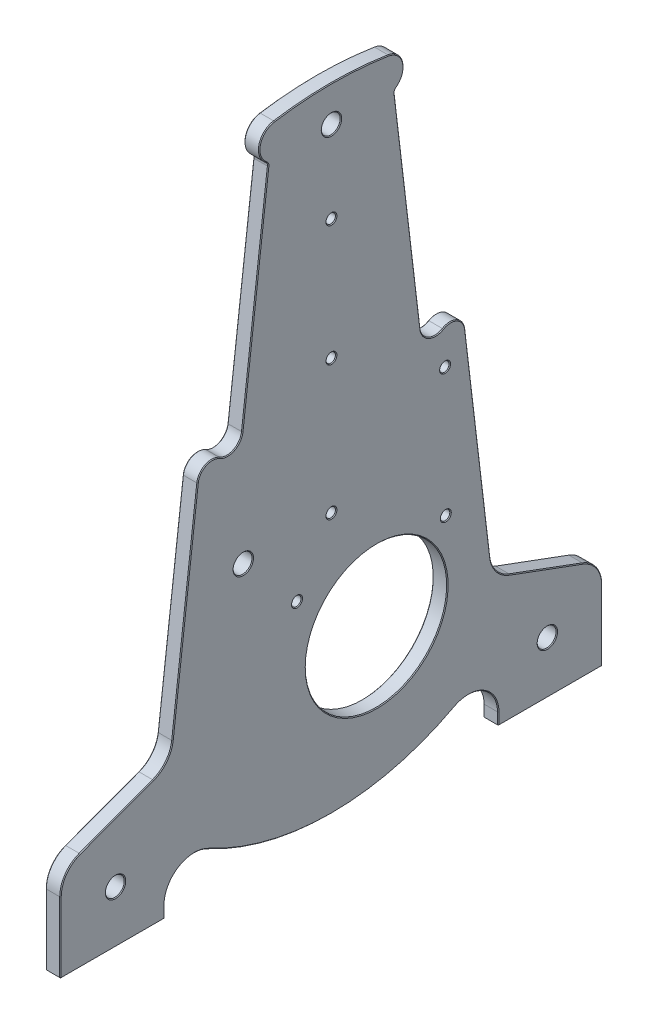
ISO-10303-21;
HEADER;
FILE_DESCRIPTION(('STEP AP214'),'2;1');
FILE_NAME('part.step','',(''),(''),'','','');
FILE_SCHEMA(('AUTOMOTIVE_DESIGN { 1 0 10303 214 1 1 1 1 }'));
ENDSEC;
DATA;
#1=APPLICATION_CONTEXT('core data for automotive mechanical design processes');
#2=APPLICATION_PROTOCOL_DEFINITION('international standard','automotive_design',2000,#1);
#3=PRODUCT_CONTEXT('',#1,'mechanical');
#4=PRODUCT('Part','Part','',(#3));
#5=PRODUCT_RELATED_PRODUCT_CATEGORY('part','',(#4));
#6=PRODUCT_DEFINITION_FORMATION('','',#4);
#7=PRODUCT_DEFINITION_CONTEXT('part definition',#1,'design');
#8=PRODUCT_DEFINITION('design','',#6,#7);
#9=PRODUCT_DEFINITION_SHAPE('','',#8);
#10=(LENGTH_UNIT() NAMED_UNIT(*) SI_UNIT(.MILLI.,.METRE.));
#11=(NAMED_UNIT(*) PLANE_ANGLE_UNIT() SI_UNIT($,.RADIAN.));
#12=(NAMED_UNIT(*) SI_UNIT($,.STERADIAN.) SOLID_ANGLE_UNIT());
#13=UNCERTAINTY_MEASURE_WITH_UNIT(LENGTH_MEASURE(1.E-05),#10,'distance_accuracy_value','');
#14=(GEOMETRIC_REPRESENTATION_CONTEXT(3) GLOBAL_UNCERTAINTY_ASSIGNED_CONTEXT((#13)) GLOBAL_UNIT_ASSIGNED_CONTEXT((#10,
#11,#12)) REPRESENTATION_CONTEXT('',''));
#15=CARTESIAN_POINT('',(0.,0.,0.));
#16=DIRECTION('',(0.,0.,1.));
#17=DIRECTION('',(1.,0.,0.));
#18=AXIS2_PLACEMENT_3D('',#15,#16,#17);
#19=CARTESIAN_POINT('',(10.,235.176736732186,-36.55));
#20=DIRECTION('',(-1.,0.,0.));
#21=DIRECTION('',(0.,0.,1.));
#22=AXIS2_PLACEMENT_3D('',#19,#20,#21);
#23=PLANE('',#22);
#24=CARTESIAN_POINT('',(10.,-40.,23.12));
#25=DIRECTION('',(-1.,0.,0.));
#26=DIRECTION('',(0.,0.,1.));
#27=AXIS2_PLACEMENT_3D('',#24,#25,#26);
#28=CIRCLE('',#27,3.67499999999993);
#29=CARTESIAN_POINT('',(10.,-40.,26.7949999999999));
#30=VERTEX_POINT('',#29);
#31=EDGE_CURVE('E676',#30,#30,#28,.T.);
#32=ORIENTED_EDGE('',*,*,#31,.T.);
#33=EDGE_LOOP('',(#32));
#34=FACE_BOUND('',#33,.T.);
#35=CARTESIAN_POINT('',(10.,-81.0963353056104,-30.38));
#36=DIRECTION('',(-1.,0.,0.));
#37=DIRECTION('',(0.,0.,1.));
#38=AXIS2_PLACEMENT_3D('',#35,#36,#37);
#39=CIRCLE('',#38,48.0000000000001);
#40=CARTESIAN_POINT('',(10.,-81.0963353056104,17.6200000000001));
#41=VERTEX_POINT('',#40);
#42=EDGE_CURVE('E673',#41,#41,#39,.T.);
#43=ORIENTED_EDGE('',*,*,#42,.T.);
#44=EDGE_LOOP('',(#43));
#45=FACE_BOUND('',#44,.T.);
#46=CARTESIAN_POINT('',(10.,-145.,145.));
#47=DIRECTION('',(-1.,0.,0.));
#48=DIRECTION('',(0.,0.,1.));
#49=AXIS2_PLACEMENT_3D('',#46,#47,#48);
#50=CIRCLE('',#49,6.85000000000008);
#51=CARTESIAN_POINT('',(10.,-145.,151.85));
#52=VERTEX_POINT('',#51);
#53=EDGE_CURVE('E670',#52,#52,#50,.T.);
#54=ORIENTED_EDGE('',*,*,#53,.T.);
#55=EDGE_LOOP('',(#54));
#56=FACE_BOUND('',#55,.T.);
#57=CARTESIAN_POINT('',(10.,46.6152603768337,-76.32));
#58=DIRECTION('',(-1.,0.,0.));
#59=DIRECTION('',(0.,0.,1.));
#60=AXIS2_PLACEMENT_3D('',#57,#58,#59);
#61=CIRCLE('',#60,3.67499999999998);
#62=CARTESIAN_POINT('',(10.,46.6152603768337,-72.645));
#63=VERTEX_POINT('',#62);
#64=EDGE_CURVE('E667',#63,#63,#61,.T.);
#65=ORIENTED_EDGE('',*,*,#64,.T.);
#66=EDGE_LOOP('',(#65));
#67=FACE_BOUND('',#66,.T.);
#68=CARTESIAN_POINT('',(10.,171.,0.));
#69=DIRECTION('',(-1.,0.,0.));
#70=DIRECTION('',(0.,0.,1.));
#71=AXIS2_PLACEMENT_3D('',#68,#69,#70);
#72=CIRCLE('',#71,3.67499999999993);
#73=CARTESIAN_POINT('',(10.,171.,3.67499999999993));
#74=VERTEX_POINT('',#73);
#75=EDGE_CURVE('E664',#74,#74,#72,.T.);
#76=ORIENTED_EDGE('',*,*,#75,.T.);
#77=EDGE_LOOP('',(#76));
#78=FACE_BOUND('',#77,.T.);
#79=CARTESIAN_POINT('',(10.,0.,0.));
#80=DIRECTION('',(-1.,0.,0.));
#81=DIRECTION('',(0.,0.,1.));
#82=AXIS2_PLACEMENT_3D('',#79,#80,#81);
#83=CIRCLE('',#82,3.67499999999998);
#84=CARTESIAN_POINT('',(10.,0.,3.67499999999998));
#85=VERTEX_POINT('',#84);
#86=EDGE_CURVE('E661',#85,#85,#83,.T.);
#87=ORIENTED_EDGE('',*,*,#86,.T.);
#88=EDGE_LOOP('',(#87));
#89=FACE_BOUND('',#88,.T.);
#90=CARTESIAN_POINT('',(10.,60.9999999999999,-80.));
#91=DIRECTION('',(-1.,0.,0.));
#92=DIRECTION('',(0.,0.,1.));
#93=AXIS2_PLACEMENT_3D('',#90,#91,#92);
#94=CIRCLE('',#93,9.49999999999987);
#95=CARTESIAN_POINT('',(10.,62.1248376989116,-89.4331723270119));
#96=VERTEX_POINT('',#95);
#97=CARTESIAN_POINT('',(10.,69.1802739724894,-75.1695634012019));
#98=VERTEX_POINT('',#97);
#99=EDGE_CURVE('E656',#96,#98,#94,.F.);
#100=ORIENTED_EDGE('',*,*,#99,.T.);
#101=CARTESIAN_POINT('',(10.,78.2216294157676,-69.830659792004));
#102=DIRECTION('',(-1.,0.,0.));
#103=DIRECTION('',(0.,0.,1.));
#104=AXIS2_PLACEMENT_3D('',#101,#102,#103);
#105=CIRCLE('',#104,10.5000000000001);
#106=CARTESIAN_POINT('',(10.,76.9783877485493,-59.4045219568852));
#107=VERTEX_POINT('',#106);
#108=EDGE_CURVE('E658',#98,#107,#105,.T.);
#109=ORIENTED_EDGE('',*,*,#108,.T.);
#110=DIRECTION('',(0.,0.992965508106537,0.118403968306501));
#111=VECTOR('',#110,1.);
#112=CARTESIAN_POINT('',(10.,235.645905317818,-40.4845659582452));
#113=LINE('',#112,#111);
#114=CARTESIAN_POINT('',(10.,222.725443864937,-42.0252377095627));
#115=VERTEX_POINT('',#114);
#116=EDGE_CURVE('E604',#107,#115,#113,.T.);
#117=ORIENTED_EDGE('',*,*,#116,.T.);
#118=CARTESIAN_POINT('',(10.,223.139857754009,-45.5006169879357));
#119=DIRECTION('',(-1.,0.,0.));
#120=DIRECTION('',(0.,0.,1.));
#121=AXIS2_PLACEMENT_3D('',#118,#119,#120);
#122=CIRCLE('',#121,3.50000000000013);
#123=CARTESIAN_POINT('',(10.,225.948462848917,-43.4121396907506));
#124=VERTEX_POINT('',#123);
#125=EDGE_CURVE('E606',#115,#124,#122,.T.);
#126=ORIENTED_EDGE('',*,*,#125,.T.);
#127=CARTESIAN_POINT('',(10.,235.176736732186,-36.55));
#128=DIRECTION('',(-1.,0.,0.));
#129=DIRECTION('',(0.,0.,1.));
#130=AXIS2_PLACEMENT_3D('',#127,#128,#129);
#131=CIRCLE('',#130,11.4999999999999);
#132=CARTESIAN_POINT('',(10.,246.540318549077,-38.3160714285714));
#133=VERTEX_POINT('',#132);
#134=EDGE_CURVE('E608',#124,#133,#131,.F.);
#135=ORIENTED_EDGE('',*,*,#134,.T.);
#136=CARTESIAN_POINT('',(10.,0.,0.));
#137=DIRECTION('',(-1.,0.,0.));
#138=DIRECTION('',(0.,0.,1.));
#139=AXIS2_PLACEMENT_3D('',#136,#137,#138);
#140=CIRCLE('',#139,249.5);
#141=CARTESIAN_POINT('',(10.,246.540318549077,38.3160714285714));
#142=VERTEX_POINT('',#141);
#143=EDGE_CURVE('E610',#133,#142,#140,.F.);
#144=ORIENTED_EDGE('',*,*,#143,.T.);
#145=CARTESIAN_POINT('',(10.,235.176736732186,36.55));
#146=DIRECTION('',(-1.,0.,0.));
#147=DIRECTION('',(0.,0.,1.));
#148=AXIS2_PLACEMENT_3D('',#145,#146,#147);
#149=CIRCLE('',#148,11.4999999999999);
#150=CARTESIAN_POINT('',(10.,225.948462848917,43.4121396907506));
#151=VERTEX_POINT('',#150);
#152=EDGE_CURVE('E612',#142,#151,#149,.F.);
#153=ORIENTED_EDGE('',*,*,#152,.T.);
#154=CARTESIAN_POINT('',(10.,223.139857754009,45.5006169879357));
#155=DIRECTION('',(-1.,0.,0.));
#156=DIRECTION('',(0.,0.,1.));
#157=AXIS2_PLACEMENT_3D('',#154,#155,#156);
#158=CIRCLE('',#157,3.50000000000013);
#159=CARTESIAN_POINT('',(10.,222.725443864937,42.0252377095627));
#160=VERTEX_POINT('',#159);
#161=EDGE_CURVE('E614',#151,#160,#158,.T.);
#162=ORIENTED_EDGE('',*,*,#161,.T.);
#163=DIRECTION('',(0.,-0.992965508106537,0.118403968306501));
#164=VECTOR('',#163,1.);
#165=CARTESIAN_POINT('',(10.,244.240349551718,39.4597405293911));
#166=LINE('',#165,#164);
#167=CARTESIAN_POINT('',(10.,76.9783877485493,59.4045219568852));
#168=VERTEX_POINT('',#167);
#169=EDGE_CURVE('E616',#160,#168,#166,.T.);
#170=ORIENTED_EDGE('',*,*,#169,.T.);
#171=CARTESIAN_POINT('',(10.,78.2216294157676,69.830659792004));
#172=DIRECTION('',(-1.,0.,0.));
#173=DIRECTION('',(0.,0.,1.));
#174=AXIS2_PLACEMENT_3D('',#171,#172,#173);
#175=CIRCLE('',#174,10.5000000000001);
#176=CARTESIAN_POINT('',(10.,69.1802739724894,75.1695634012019));
#177=VERTEX_POINT('',#176);
#178=EDGE_CURVE('E618',#168,#177,#175,.T.);
#179=ORIENTED_EDGE('',*,*,#178,.T.);
#180=CARTESIAN_POINT('',(10.,60.9999999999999,80.));
#181=DIRECTION('',(-1.,0.,0.));
#182=DIRECTION('',(0.,0.,1.));
#183=AXIS2_PLACEMENT_3D('',#180,#181,#182);
#184=CIRCLE('',#183,9.49999999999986);
#185=CARTESIAN_POINT('',(10.,62.1248376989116,89.4331723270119));
#186=VERTEX_POINT('',#185);
#187=EDGE_CURVE('E620',#177,#186,#184,.F.);
#188=ORIENTED_EDGE('',*,*,#187,.T.);
#189=DIRECTION('',(0.,-0.992965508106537,0.118403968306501));
#190=VECTOR('',#189,1.);
#191=CARTESIAN_POINT('',(10.,247.562610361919,67.3210566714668));
#192=LINE('',#191,#190);
#193=CARTESIAN_POINT('',(10.,-79.1985267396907,106.284963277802));
#194=VERTEX_POINT('',#193);
#195=EDGE_CURVE('E622',#186,#194,#192,.T.);
#196=ORIENTED_EDGE('',*,*,#195,.T.);
#197=CARTESIAN_POINT('',(10.,-76.7712453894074,126.640756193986));
#198=DIRECTION('',(-1.,0.,0.));
#199=DIRECTION('',(0.,0.,1.));
#200=AXIS2_PLACEMENT_3D('',#197,#198,#199);
#201=CIRCLE('',#200,20.5000000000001);
#202=CARTESIAN_POINT('',(10.,-95.9979685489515,119.528575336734));
#203=VERTEX_POINT('',#202);
#204=EDGE_CURVE('E624',#194,#203,#201,.T.);
#205=ORIENTED_EDGE('',*,*,#204,.T.);
#206=DIRECTION('',(0.,-0.34693565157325,0.9378889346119));
#207=VECTOR('',#206,1.);
#208=CARTESIAN_POINT('',(10.,-5.35038527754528,-125.523684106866));
#209=LINE('',#208,#207);
#210=CARTESIAN_POINT('',(10.,-114.211165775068,168.765245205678));
#211=VERTEX_POINT('',#210);
#212=EDGE_CURVE('E626',#203,#211,#209,.T.);
#213=ORIENTED_EDGE('',*,*,#212,.T.);
#214=CARTESIAN_POINT('',(10.,-132.5,162.));
#215=DIRECTION('',(-1.,0.,0.));
#216=DIRECTION('',(0.,0.,1.));
#217=AXIS2_PLACEMENT_3D('',#214,#215,#216);
#218=CIRCLE('',#217,19.4999999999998);
#219=CARTESIAN_POINT('',(10.,-132.5,181.5));
#220=VERTEX_POINT('',#219);
#221=EDGE_CURVE('E628',#211,#220,#218,.F.);
#222=ORIENTED_EDGE('',*,*,#221,.T.);
#223=DIRECTION('',(0.,-1.,0.));
#224=VECTOR('',#223,1.);
#225=CARTESIAN_POINT('',(10.,235.176736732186,181.5));
#226=LINE('',#225,#224);
#227=CARTESIAN_POINT('',(10.,-179.5,181.5));
#228=VERTEX_POINT('',#227);
#229=EDGE_CURVE('E630',#220,#228,#226,.T.);
#230=ORIENTED_EDGE('',*,*,#229,.T.);
#231=DIRECTION('',(0.,0.,-1.));
#232=VECTOR('',#231,1.);
#233=CARTESIAN_POINT('',(10.,-179.5,-36.5499999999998));
#234=LINE('',#233,#232);
#235=CARTESIAN_POINT('',(10.,-179.5,112.5));
#236=VERTEX_POINT('',#235);
#237=EDGE_CURVE('E632',#228,#236,#234,.T.);
#238=ORIENTED_EDGE('',*,*,#237,.T.);
#239=DIRECTION('',(0.,1.,0.));
#240=VECTOR('',#239,1.);
#241=CARTESIAN_POINT('',(10.,235.176736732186,112.500000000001));
#242=LINE('',#241,#240);
#243=CARTESIAN_POINT('',(10.,-171.933126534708,112.5));
#244=VERTEX_POINT('',#243);
#245=EDGE_CURVE('E634',#236,#244,#242,.T.);
#246=ORIENTED_EDGE('',*,*,#245,.T.);
#247=CARTESIAN_POINT('',(10.,-171.933126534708,91.9999999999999));
#248=DIRECTION('',(-1.,0.,0.));
#249=DIRECTION('',(0.,0.,1.));
#250=AXIS2_PLACEMENT_3D('',#247,#248,#249);
#251=CIRCLE('',#250,20.5000000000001);
#252=CARTESIAN_POINT('',(10.,-153.858105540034,82.328205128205));
#253=VERTEX_POINT('',#252);
#254=EDGE_CURVE('E636',#244,#253,#251,.T.);
#255=ORIENTED_EDGE('',*,*,#254,.T.);
#256=CARTESIAN_POINT('',(10.,0.,0.));
#257=DIRECTION('',(-1.,0.,0.));
#258=DIRECTION('',(0.,0.,1.));
#259=AXIS2_PLACEMENT_3D('',#256,#257,#258);
#260=CIRCLE('',#259,174.5);
#261=CARTESIAN_POINT('',(10.,-153.858105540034,-82.3282051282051));
#262=VERTEX_POINT('',#261);
#263=EDGE_CURVE('E638',#253,#262,#260,.F.);
#264=ORIENTED_EDGE('',*,*,#263,.T.);
#265=CARTESIAN_POINT('',(10.,-171.933126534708,-92.));
#266=DIRECTION('',(-1.,0.,0.));
#267=DIRECTION('',(0.,0.,1.));
#268=AXIS2_PLACEMENT_3D('',#265,#266,#267);
#269=CIRCLE('',#268,20.5000000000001);
#270=CARTESIAN_POINT('',(10.,-171.933126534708,-112.5));
#271=VERTEX_POINT('',#270);
#272=EDGE_CURVE('E640',#262,#271,#269,.T.);
#273=ORIENTED_EDGE('',*,*,#272,.T.);
#274=DIRECTION('',(0.,-1.,0.));
#275=VECTOR('',#274,1.);
#276=CARTESIAN_POINT('',(10.,235.176736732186,-112.500000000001));
#277=LINE('',#276,#275);
#278=CARTESIAN_POINT('',(10.,-179.5,-112.5));
#279=VERTEX_POINT('',#278);
#280=EDGE_CURVE('E642',#271,#279,#277,.T.);
#281=ORIENTED_EDGE('',*,*,#280,.T.);
#282=DIRECTION('',(0.,0.,-1.));
#283=VECTOR('',#282,1.);
#284=CARTESIAN_POINT('',(10.,-179.5,-36.5500000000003));
#285=LINE('',#284,#283);
#286=CARTESIAN_POINT('',(10.,-179.5,-181.5));
#287=VERTEX_POINT('',#286);
#288=EDGE_CURVE('E644',#279,#287,#285,.T.);
#289=ORIENTED_EDGE('',*,*,#288,.T.);
#290=DIRECTION('',(0.,1.,0.));
#291=VECTOR('',#290,1.);
#292=CARTESIAN_POINT('',(10.,235.176736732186,-181.5));
#293=LINE('',#292,#291);
#294=CARTESIAN_POINT('',(10.,-132.5,-181.5));
#295=VERTEX_POINT('',#294);
#296=EDGE_CURVE('E646',#287,#295,#293,.T.);
#297=ORIENTED_EDGE('',*,*,#296,.T.);
#298=CARTESIAN_POINT('',(10.,-132.5,-162.));
#299=DIRECTION('',(-1.,0.,0.));
#300=DIRECTION('',(0.,0.,1.));
#301=AXIS2_PLACEMENT_3D('',#298,#299,#300);
#302=CIRCLE('',#301,19.4999999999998);
#303=CARTESIAN_POINT('',(10.,-114.211165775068,-168.765245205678));
#304=VERTEX_POINT('',#303);
#305=EDGE_CURVE('E648',#295,#304,#302,.F.);
#306=ORIENTED_EDGE('',*,*,#305,.T.);
#307=DIRECTION('',(0.,0.346935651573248,0.937888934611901));
#308=VECTOR('',#307,1.);
#309=CARTESIAN_POINT('',(10.,-29.1361829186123,61.2223178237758));
#310=LINE('',#309,#308);
#311=CARTESIAN_POINT('',(10.,-95.9979685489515,-119.528575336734));
#312=VERTEX_POINT('',#311);
#313=EDGE_CURVE('E650',#304,#312,#310,.T.);
#314=ORIENTED_EDGE('',*,*,#313,.T.);
#315=CARTESIAN_POINT('',(10.,-76.7712453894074,-126.640756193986));
#316=DIRECTION('',(-1.,0.,0.));
#317=DIRECTION('',(0.,0.,1.));
#318=AXIS2_PLACEMENT_3D('',#315,#316,#317);
#319=CIRCLE('',#318,20.5000000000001);
#320=CARTESIAN_POINT('',(10.,-79.1985267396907,-106.284963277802));
#321=VERTEX_POINT('',#320);
#322=EDGE_CURVE('E652',#312,#321,#319,.T.);
#323=ORIENTED_EDGE('',*,*,#322,.T.);
#324=DIRECTION('',(0.,0.992965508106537,0.118403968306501));
#325=VECTOR('',#324,1.);
#326=CARTESIAN_POINT('',(10.,238.968166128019,-68.3458821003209));
#327=LINE('',#326,#325);
#328=EDGE_CURVE('E654',#321,#96,#327,.T.);
#329=ORIENTED_EDGE('',*,*,#328,.T.);
#330=EDGE_LOOP('',(#100,#109,#117,#126,#135,#144,#153,#162,#170,#179,#188,#196,#205,#213,#222,
#230,#238,#246,#255,#264,#273,#281,#289,#297,#306,#314,#323,#329));
#331=FACE_BOUND('',#330,.T.);
#332=CARTESIAN_POINT('',(10.,90.,0.));
#333=DIRECTION('',(-1.,0.,0.));
#334=DIRECTION('',(0.,0.,1.));
#335=AXIS2_PLACEMENT_3D('',#332,#333,#334);
#336=CIRCLE('',#335,3.67499999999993);
#337=CARTESIAN_POINT('',(10.,90.,3.67499999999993));
#338=VERTEX_POINT('',#337);
#339=EDGE_CURVE('E601',#338,#338,#336,.T.);
#340=ORIENTED_EDGE('',*,*,#339,.T.);
#341=EDGE_LOOP('',(#340));
#342=FACE_BOUND('',#341,.T.);
#343=CARTESIAN_POINT('',(10.,226.,0.));
#344=DIRECTION('',(-1.,0.,0.));
#345=DIRECTION('',(0.,0.,1.));
#346=AXIS2_PLACEMENT_3D('',#343,#344,#345);
#347=CIRCLE('',#346,6.85000000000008);
#348=CARTESIAN_POINT('',(10.,226.,6.85000000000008));
#349=VERTEX_POINT('',#348);
#350=EDGE_CURVE('E598',#349,#349,#347,.T.);
#351=ORIENTED_EDGE('',*,*,#350,.T.);
#352=EDGE_LOOP('',(#351));
#353=FACE_BOUND('',#352,.T.);
#354=CARTESIAN_POINT('',(10.,-39.9972986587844,-76.81));
#355=DIRECTION('',(-1.,0.,0.));
#356=DIRECTION('',(0.,0.,1.));
#357=AXIS2_PLACEMENT_3D('',#354,#355,#356);
#358=CIRCLE('',#357,3.67499999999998);
#359=CARTESIAN_POINT('',(10.,-39.9972986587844,-73.135));
#360=VERTEX_POINT('',#359);
#361=EDGE_CURVE('E595',#360,#360,#358,.T.);
#362=ORIENTED_EDGE('',*,*,#361,.T.);
#363=EDGE_LOOP('',(#362));
#364=FACE_BOUND('',#363,.T.);
#365=CARTESIAN_POINT('',(10.,-145.,-145.));
#366=DIRECTION('',(-1.,0.,0.));
#367=DIRECTION('',(0.,0.,1.));
#368=AXIS2_PLACEMENT_3D('',#365,#366,#367);
#369=CIRCLE('',#368,6.85000000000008);
#370=CARTESIAN_POINT('',(10.,-145.,-138.15));
#371=VERTEX_POINT('',#370);
#372=EDGE_CURVE('E592',#371,#371,#369,.T.);
#373=ORIENTED_EDGE('',*,*,#372,.T.);
#374=EDGE_LOOP('',(#373));
#375=FACE_BOUND('',#374,.T.);
#376=CARTESIAN_POINT('',(10.,0.,59.2));
#377=DIRECTION('',(-1.,0.,0.));
#378=DIRECTION('',(0.,0.,1.));
#379=AXIS2_PLACEMENT_3D('',#376,#377,#378);
#380=CIRCLE('',#379,6.85000000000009);
#381=CARTESIAN_POINT('',(10.,0.,66.0500000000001));
#382=VERTEX_POINT('',#381);
#383=EDGE_CURVE('E589',#382,#382,#380,.T.);
#384=ORIENTED_EDGE('',*,*,#383,.T.);
#385=EDGE_LOOP('',(#384));
#386=FACE_BOUND('',#385,.T.);
#387=ADVANCED_FACE('F31',(#34,#45,#56,#67,#78,#89,#331,#342,#353,#364,#375,#386),#23,.F.);
#388=CARTESIAN_POINT('',(0.,235.176736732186,-36.55));
#389=DIRECTION('',(-1.,0.,0.));
#390=DIRECTION('',(0.,0.,1.));
#391=AXIS2_PLACEMENT_3D('',#388,#389,#390);
#392=PLANE('',#391);
#393=CARTESIAN_POINT('',(0.,-40.,23.12));
#394=DIRECTION('',(-1.,0.,0.));
#395=DIRECTION('',(0.,0.,1.));
#396=AXIS2_PLACEMENT_3D('',#393,#394,#395);
#397=CIRCLE('',#396,3.67500000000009);
#398=CARTESIAN_POINT('',(0.,-40.,26.7950000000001));
#399=VERTEX_POINT('',#398);
#400=EDGE_CURVE('E520',#399,#399,#397,.F.);
#401=ORIENTED_EDGE('',*,*,#400,.T.);
#402=EDGE_LOOP('',(#401));
#403=FACE_BOUND('',#402,.T.);
#404=CARTESIAN_POINT('',(0.,-81.0963353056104,-30.38));
#405=DIRECTION('',(-1.,0.,0.));
#406=DIRECTION('',(0.,0.,1.));
#407=AXIS2_PLACEMENT_3D('',#404,#405,#406);
#408=CIRCLE('',#407,48.);
#409=CARTESIAN_POINT('',(0.,-81.0963353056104,17.62));
#410=VERTEX_POINT('',#409);
#411=EDGE_CURVE('E517',#410,#410,#408,.F.);
#412=ORIENTED_EDGE('',*,*,#411,.T.);
#413=EDGE_LOOP('',(#412));
#414=FACE_BOUND('',#413,.T.);
#415=CARTESIAN_POINT('',(0.,-145.,145.));
#416=DIRECTION('',(-1.,0.,0.));
#417=DIRECTION('',(0.,0.,1.));
#418=AXIS2_PLACEMENT_3D('',#415,#416,#417);
#419=CIRCLE('',#418,6.85000000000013);
#420=CARTESIAN_POINT('',(0.,-145.,151.85));
#421=VERTEX_POINT('',#420);
#422=EDGE_CURVE('E514',#421,#421,#419,.F.);
#423=ORIENTED_EDGE('',*,*,#422,.T.);
#424=EDGE_LOOP('',(#423));
#425=FACE_BOUND('',#424,.T.);
#426=CARTESIAN_POINT('',(0.,46.6152603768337,-76.32));
#427=DIRECTION('',(-1.,0.,0.));
#428=DIRECTION('',(0.,0.,1.));
#429=AXIS2_PLACEMENT_3D('',#426,#427,#428);
#430=CIRCLE('',#429,3.67499999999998);
#431=CARTESIAN_POINT('',(0.,46.6152603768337,-72.645));
#432=VERTEX_POINT('',#431);
#433=EDGE_CURVE('E511',#432,#432,#430,.F.);
#434=ORIENTED_EDGE('',*,*,#433,.T.);
#435=EDGE_LOOP('',(#434));
#436=FACE_BOUND('',#435,.T.);
#437=CARTESIAN_POINT('',(0.,171.,0.));
#438=DIRECTION('',(-1.,0.,0.));
#439=DIRECTION('',(0.,0.,1.));
#440=AXIS2_PLACEMENT_3D('',#437,#438,#439);
#441=CIRCLE('',#440,3.67500000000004);
#442=CARTESIAN_POINT('',(0.,171.,3.67500000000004));
#443=VERTEX_POINT('',#442);
#444=EDGE_CURVE('E508',#443,#443,#441,.F.);
#445=ORIENTED_EDGE('',*,*,#444,.T.);
#446=EDGE_LOOP('',(#445));
#447=FACE_BOUND('',#446,.T.);
#448=CARTESIAN_POINT('',(0.,0.,0.));
#449=DIRECTION('',(-1.,0.,0.));
#450=DIRECTION('',(0.,0.,1.));
#451=AXIS2_PLACEMENT_3D('',#448,#449,#450);
#452=CIRCLE('',#451,3.67499999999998);
#453=CARTESIAN_POINT('',(0.,0.,3.67499999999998));
#454=VERTEX_POINT('',#453);
#455=EDGE_CURVE('E505',#454,#454,#452,.F.);
#456=ORIENTED_EDGE('',*,*,#455,.T.);
#457=EDGE_LOOP('',(#456));
#458=FACE_BOUND('',#457,.T.);
#459=CARTESIAN_POINT('',(0.,90.,0.));
#460=DIRECTION('',(-1.,0.,0.));
#461=DIRECTION('',(0.,0.,1.));
#462=AXIS2_PLACEMENT_3D('',#459,#460,#461);
#463=CIRCLE('',#462,3.67500000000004);
#464=CARTESIAN_POINT('',(0.,90.,3.67500000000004));
#465=VERTEX_POINT('',#464);
#466=EDGE_CURVE('E502',#465,#465,#463,.F.);
#467=ORIENTED_EDGE('',*,*,#466,.T.);
#468=EDGE_LOOP('',(#467));
#469=FACE_BOUND('',#468,.T.);
#470=CARTESIAN_POINT('',(0.,226.,0.));
#471=DIRECTION('',(-1.,0.,0.));
#472=DIRECTION('',(0.,0.,1.));
#473=AXIS2_PLACEMENT_3D('',#470,#471,#472);
#474=CIRCLE('',#473,6.85000000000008);
#475=CARTESIAN_POINT('',(0.,226.,6.85000000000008));
#476=VERTEX_POINT('',#475);
#477=EDGE_CURVE('E499',#476,#476,#474,.F.);
#478=ORIENTED_EDGE('',*,*,#477,.T.);
#479=EDGE_LOOP('',(#478));
#480=FACE_BOUND('',#479,.T.);
#481=CARTESIAN_POINT('',(0.,-39.9972986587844,-76.81));
#482=DIRECTION('',(-1.,0.,0.));
#483=DIRECTION('',(0.,0.,1.));
#484=AXIS2_PLACEMENT_3D('',#481,#482,#483);
#485=CIRCLE('',#484,3.67499999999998);
#486=CARTESIAN_POINT('',(0.,-39.9972986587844,-73.135));
#487=VERTEX_POINT('',#486);
#488=EDGE_CURVE('E496',#487,#487,#485,.F.);
#489=ORIENTED_EDGE('',*,*,#488,.T.);
#490=EDGE_LOOP('',(#489));
#491=FACE_BOUND('',#490,.T.);
#492=CARTESIAN_POINT('',(0.,-145.,-145.));
#493=DIRECTION('',(-1.,0.,0.));
#494=DIRECTION('',(0.,0.,1.));
#495=AXIS2_PLACEMENT_3D('',#492,#493,#494);
#496=CIRCLE('',#495,6.85000000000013);
#497=CARTESIAN_POINT('',(0.,-145.,-138.15));
#498=VERTEX_POINT('',#497);
#499=EDGE_CURVE('E493',#498,#498,#496,.F.);
#500=ORIENTED_EDGE('',*,*,#499,.T.);
#501=EDGE_LOOP('',(#500));
#502=FACE_BOUND('',#501,.T.);
#503=CARTESIAN_POINT('',(0.,0.,59.2));
#504=DIRECTION('',(-1.,0.,0.));
#505=DIRECTION('',(0.,0.,1.));
#506=AXIS2_PLACEMENT_3D('',#503,#504,#505);
#507=CIRCLE('',#506,6.85000000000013);
#508=CARTESIAN_POINT('',(0.,0.,66.0500000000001));
#509=VERTEX_POINT('',#508);
#510=EDGE_CURVE('E490',#509,#509,#507,.F.);
#511=ORIENTED_EDGE('',*,*,#510,.T.);
#512=EDGE_LOOP('',(#511));
#513=FACE_BOUND('',#512,.T.);
#514=CARTESIAN_POINT('',(0.,235.176736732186,36.55));
#515=DIRECTION('',(-1.,0.,0.));
#516=DIRECTION('',(0.,0.,1.));
#517=AXIS2_PLACEMENT_3D('',#514,#515,#516);
#518=CIRCLE('',#517,11.4999999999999);
#519=CARTESIAN_POINT('',(0.,225.948462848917,43.4121396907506));
#520=VERTEX_POINT('',#519);
#521=CARTESIAN_POINT('',(0.,246.540318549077,38.3160714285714));
#522=VERTEX_POINT('',#521);
#523=EDGE_CURVE('E485',#520,#522,#518,.T.);
#524=ORIENTED_EDGE('',*,*,#523,.T.);
#525=CARTESIAN_POINT('',(0.,0.,0.));
#526=DIRECTION('',(-1.,0.,0.));
#527=DIRECTION('',(0.,0.,1.));
#528=AXIS2_PLACEMENT_3D('',#525,#526,#527);
#529=CIRCLE('',#528,249.5);
#530=CARTESIAN_POINT('',(0.,246.540318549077,-38.3160714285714));
#531=VERTEX_POINT('',#530);
#532=EDGE_CURVE('E487',#522,#531,#529,.T.);
#533=ORIENTED_EDGE('',*,*,#532,.T.);
#534=CARTESIAN_POINT('',(0.,235.176736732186,-36.55));
#535=DIRECTION('',(-1.,0.,0.));
#536=DIRECTION('',(0.,0.,1.));
#537=AXIS2_PLACEMENT_3D('',#534,#535,#536);
#538=CIRCLE('',#537,11.4999999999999);
#539=CARTESIAN_POINT('',(0.,225.948462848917,-43.4121396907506));
#540=VERTEX_POINT('',#539);
#541=EDGE_CURVE('E451',#531,#540,#538,.T.);
#542=ORIENTED_EDGE('',*,*,#541,.T.);
#543=CARTESIAN_POINT('',(0.,223.139857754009,-45.5006169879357));
#544=DIRECTION('',(-1.,0.,0.));
#545=DIRECTION('',(0.,0.,1.));
#546=AXIS2_PLACEMENT_3D('',#543,#544,#545);
#547=CIRCLE('',#546,3.50000000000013);
#548=CARTESIAN_POINT('',(0.,222.725443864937,-42.0252377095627));
#549=VERTEX_POINT('',#548);
#550=EDGE_CURVE('E449',#540,#549,#547,.F.);
#551=ORIENTED_EDGE('',*,*,#550,.T.);
#552=DIRECTION('',(0.,-0.992965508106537,-0.118403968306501));
#553=VECTOR('',#552,1.);
#554=CARTESIAN_POINT('',(0.,76.9783877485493,-59.4045219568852));
#555=LINE('',#554,#553);
#556=CARTESIAN_POINT('',(0.,76.9783877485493,-59.4045219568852));
#557=VERTEX_POINT('',#556);
#558=EDGE_CURVE('E447',#549,#557,#555,.T.);
#559=ORIENTED_EDGE('',*,*,#558,.T.);
#560=CARTESIAN_POINT('',(0.,78.2216294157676,-69.830659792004));
#561=DIRECTION('',(-1.,0.,0.));
#562=DIRECTION('',(0.,0.,1.));
#563=AXIS2_PLACEMENT_3D('',#560,#561,#562);
#564=CIRCLE('',#563,10.5000000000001);
#565=CARTESIAN_POINT('',(0.,69.1802739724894,-75.1695634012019));
#566=VERTEX_POINT('',#565);
#567=EDGE_CURVE('E445',#557,#566,#564,.F.);
#568=ORIENTED_EDGE('',*,*,#567,.T.);
#569=CARTESIAN_POINT('',(0.,60.9999999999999,-80.));
#570=DIRECTION('',(-1.,0.,0.));
#571=DIRECTION('',(0.,0.,1.));
#572=AXIS2_PLACEMENT_3D('',#569,#570,#571);
#573=CIRCLE('',#572,9.49999999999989);
#574=CARTESIAN_POINT('',(0.,62.1248376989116,-89.4331723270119));
#575=VERTEX_POINT('',#574);
#576=EDGE_CURVE('E443',#566,#575,#573,.T.);
#577=ORIENTED_EDGE('',*,*,#576,.T.);
#578=DIRECTION('',(0.,-0.992965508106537,-0.118403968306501));
#579=VECTOR('',#578,1.);
#580=CARTESIAN_POINT('',(0.,-79.1985267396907,-106.284963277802));
#581=LINE('',#580,#579);
#582=CARTESIAN_POINT('',(0.,-79.1985267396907,-106.284963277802));
#583=VERTEX_POINT('',#582);
#584=EDGE_CURVE('E441',#575,#583,#581,.T.);
#585=ORIENTED_EDGE('',*,*,#584,.T.);
#586=CARTESIAN_POINT('',(0.,-76.7712453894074,-126.640756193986));
#587=DIRECTION('',(-1.,0.,0.));
#588=DIRECTION('',(0.,0.,1.));
#589=AXIS2_PLACEMENT_3D('',#586,#587,#588);
#590=CIRCLE('',#589,20.5000000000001);
#591=CARTESIAN_POINT('',(0.,-95.9979685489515,-119.528575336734));
#592=VERTEX_POINT('',#591);
#593=EDGE_CURVE('E439',#583,#592,#590,.F.);
#594=ORIENTED_EDGE('',*,*,#593,.T.);
#595=DIRECTION('',(0.,-0.346935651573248,-0.937888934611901));
#596=VECTOR('',#595,1.);
#597=CARTESIAN_POINT('',(0.,-114.211165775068,-168.765245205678));
#598=LINE('',#597,#596);
#599=CARTESIAN_POINT('',(0.,-114.211165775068,-168.765245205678));
#600=VERTEX_POINT('',#599);
#601=EDGE_CURVE('E413',#592,#600,#598,.T.);
#602=ORIENTED_EDGE('',*,*,#601,.T.);
#603=CARTESIAN_POINT('',(0.,-132.5,-162.));
#604=DIRECTION('',(-1.,0.,0.));
#605=DIRECTION('',(0.,0.,1.));
#606=AXIS2_PLACEMENT_3D('',#603,#604,#605);
#607=CIRCLE('',#606,19.4999999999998);
#608=CARTESIAN_POINT('',(0.,-132.5,-181.5));
#609=VERTEX_POINT('',#608);
#610=EDGE_CURVE('E406',#600,#609,#607,.T.);
#611=ORIENTED_EDGE('',*,*,#610,.T.);
#612=DIRECTION('',(0.,-1.,0.));
#613=VECTOR('',#612,1.);
#614=CARTESIAN_POINT('',(0.,-180.,-181.5));
#615=LINE('',#614,#613);
#616=CARTESIAN_POINT('',(0.,-179.5,-181.5));
#617=VERTEX_POINT('',#616);
#618=EDGE_CURVE('E410',#609,#617,#615,.T.);
#619=ORIENTED_EDGE('',*,*,#618,.T.);
#620=DIRECTION('',(0.,0.,1.));
#621=VECTOR('',#620,1.);
#622=CARTESIAN_POINT('',(0.,-179.5,-112.));
#623=LINE('',#622,#621);
#624=CARTESIAN_POINT('',(0.,-179.5,-112.5));
#625=VERTEX_POINT('',#624);
#626=EDGE_CURVE('E453',#617,#625,#623,.T.);
#627=ORIENTED_EDGE('',*,*,#626,.T.);
#628=DIRECTION('',(0.,1.,0.));
#629=VECTOR('',#628,1.);
#630=CARTESIAN_POINT('',(0.,-171.933126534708,-112.5));
#631=LINE('',#630,#629);
#632=CARTESIAN_POINT('',(0.,-171.933126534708,-112.5));
#633=VERTEX_POINT('',#632);
#634=EDGE_CURVE('E455',#625,#633,#631,.T.);
#635=ORIENTED_EDGE('',*,*,#634,.T.);
#636=CARTESIAN_POINT('',(0.,-171.933126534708,-92.));
#637=DIRECTION('',(-1.,0.,0.));
#638=DIRECTION('',(0.,0.,1.));
#639=AXIS2_PLACEMENT_3D('',#636,#637,#638);
#640=CIRCLE('',#639,20.5000000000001);
#641=CARTESIAN_POINT('',(0.,-153.858105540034,-82.3282051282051));
#642=VERTEX_POINT('',#641);
#643=EDGE_CURVE('E457',#633,#642,#640,.F.);
#644=ORIENTED_EDGE('',*,*,#643,.T.);
#645=CARTESIAN_POINT('',(0.,0.,0.));
#646=DIRECTION('',(-1.,0.,0.));
#647=DIRECTION('',(0.,0.,1.));
#648=AXIS2_PLACEMENT_3D('',#645,#646,#647);
#649=CIRCLE('',#648,174.5);
#650=CARTESIAN_POINT('',(0.,-153.858105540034,82.328205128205));
#651=VERTEX_POINT('',#650);
#652=EDGE_CURVE('E459',#642,#651,#649,.T.);
#653=ORIENTED_EDGE('',*,*,#652,.T.);
#654=CARTESIAN_POINT('',(0.,-171.933126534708,91.9999999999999));
#655=DIRECTION('',(-1.,0.,0.));
#656=DIRECTION('',(0.,0.,1.));
#657=AXIS2_PLACEMENT_3D('',#654,#655,#656);
#658=CIRCLE('',#657,20.5000000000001);
#659=CARTESIAN_POINT('',(0.,-171.933126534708,112.5));
#660=VERTEX_POINT('',#659);
#661=EDGE_CURVE('E461',#651,#660,#658,.F.);
#662=ORIENTED_EDGE('',*,*,#661,.T.);
#663=DIRECTION('',(0.,-1.,0.));
#664=VECTOR('',#663,1.);
#665=CARTESIAN_POINT('',(0.,-180.,112.5));
#666=LINE('',#665,#664);
#667=CARTESIAN_POINT('',(0.,-179.5,112.5));
#668=VERTEX_POINT('',#667);
#669=EDGE_CURVE('E463',#660,#668,#666,.T.);
#670=ORIENTED_EDGE('',*,*,#669,.T.);
#671=DIRECTION('',(0.,0.,1.));
#672=VECTOR('',#671,1.);
#673=CARTESIAN_POINT('',(0.,-179.5,182.));
#674=LINE('',#673,#672);
#675=CARTESIAN_POINT('',(0.,-179.5,181.5));
#676=VERTEX_POINT('',#675);
#677=EDGE_CURVE('E465',#668,#676,#674,.T.);
#678=ORIENTED_EDGE('',*,*,#677,.T.);
#679=DIRECTION('',(0.,1.,0.));
#680=VECTOR('',#679,1.);
#681=CARTESIAN_POINT('',(0.,-132.5,181.5));
#682=LINE('',#681,#680);
#683=CARTESIAN_POINT('',(0.,-132.5,181.5));
#684=VERTEX_POINT('',#683);
#685=EDGE_CURVE('E467',#676,#684,#682,.T.);
#686=ORIENTED_EDGE('',*,*,#685,.T.);
#687=CARTESIAN_POINT('',(0.,-132.5,162.));
#688=DIRECTION('',(-1.,0.,0.));
#689=DIRECTION('',(0.,0.,1.));
#690=AXIS2_PLACEMENT_3D('',#687,#688,#689);
#691=CIRCLE('',#690,19.4999999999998);
#692=CARTESIAN_POINT('',(0.,-114.211165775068,168.765245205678));
#693=VERTEX_POINT('',#692);
#694=EDGE_CURVE('E469',#684,#693,#691,.T.);
#695=ORIENTED_EDGE('',*,*,#694,.T.);
#696=DIRECTION('',(0.,0.34693565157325,-0.9378889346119));
#697=VECTOR('',#696,1.);
#698=CARTESIAN_POINT('',(0.,-95.9979685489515,119.528575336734));
#699=LINE('',#698,#697);
#700=CARTESIAN_POINT('',(0.,-95.9979685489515,119.528575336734));
#701=VERTEX_POINT('',#700);
#702=EDGE_CURVE('E471',#693,#701,#699,.T.);
#703=ORIENTED_EDGE('',*,*,#702,.T.);
#704=CARTESIAN_POINT('',(0.,-76.7712453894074,126.640756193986));
#705=DIRECTION('',(-1.,0.,0.));
#706=DIRECTION('',(0.,0.,1.));
#707=AXIS2_PLACEMENT_3D('',#704,#705,#706);
#708=CIRCLE('',#707,20.5000000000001);
#709=CARTESIAN_POINT('',(0.,-79.1985267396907,106.284963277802));
#710=VERTEX_POINT('',#709);
#711=EDGE_CURVE('E473',#701,#710,#708,.F.);
#712=ORIENTED_EDGE('',*,*,#711,.T.);
#713=DIRECTION('',(0.,0.992965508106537,-0.118403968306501));
#714=VECTOR('',#713,1.);
#715=CARTESIAN_POINT('',(0.,62.1248376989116,89.4331723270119));
#716=LINE('',#715,#714);
#717=CARTESIAN_POINT('',(0.,62.1248376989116,89.4331723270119));
#718=VERTEX_POINT('',#717);
#719=EDGE_CURVE('E475',#710,#718,#716,.T.);
#720=ORIENTED_EDGE('',*,*,#719,.T.);
#721=CARTESIAN_POINT('',(0.,60.9999999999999,80.));
#722=DIRECTION('',(-1.,0.,0.));
#723=DIRECTION('',(0.,0.,1.));
#724=AXIS2_PLACEMENT_3D('',#721,#722,#723);
#725=CIRCLE('',#724,9.49999999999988);
#726=CARTESIAN_POINT('',(0.,69.1802739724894,75.1695634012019));
#727=VERTEX_POINT('',#726);
#728=EDGE_CURVE('E477',#718,#727,#725,.T.);
#729=ORIENTED_EDGE('',*,*,#728,.T.);
#730=CARTESIAN_POINT('',(0.,78.2216294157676,69.830659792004));
#731=DIRECTION('',(-1.,0.,0.));
#732=DIRECTION('',(0.,0.,1.));
#733=AXIS2_PLACEMENT_3D('',#730,#731,#732);
#734=CIRCLE('',#733,10.5000000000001);
#735=CARTESIAN_POINT('',(0.,76.9783877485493,59.4045219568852));
#736=VERTEX_POINT('',#735);
#737=EDGE_CURVE('E479',#727,#736,#734,.F.);
#738=ORIENTED_EDGE('',*,*,#737,.T.);
#739=DIRECTION('',(0.,0.992965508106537,-0.118403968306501));
#740=VECTOR('',#739,1.);
#741=CARTESIAN_POINT('',(0.,222.725443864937,42.0252377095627));
#742=LINE('',#741,#740);
#743=CARTESIAN_POINT('',(0.,222.725443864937,42.0252377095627));
#744=VERTEX_POINT('',#743);
#745=EDGE_CURVE('E481',#736,#744,#742,.T.);
#746=ORIENTED_EDGE('',*,*,#745,.T.);
#747=CARTESIAN_POINT('',(0.,223.139857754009,45.5006169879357));
#748=DIRECTION('',(-1.,0.,0.));
#749=DIRECTION('',(0.,0.,1.));
#750=AXIS2_PLACEMENT_3D('',#747,#748,#749);
#751=CIRCLE('',#750,3.50000000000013);
#752=EDGE_CURVE('E483',#744,#520,#751,.F.);
#753=ORIENTED_EDGE('',*,*,#752,.T.);
#754=EDGE_LOOP('',(#524,#533,#542,#551,#559,#568,#577,#585,#594,#602,#611,#619,#627,#635,#644,
#653,#662,#670,#678,#686,#695,#703,#712,#720,#729,#738,#746,#753));
#755=FACE_BOUND('',#754,.T.);
#756=ADVANCED_FACE('F408',(#403,#414,#425,#436,#447,#458,#469,#480,#491,#502,#513,#755),#392,.T.);
#757=CARTESIAN_POINT('',(10.,235.176736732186,-36.55));
#758=DIRECTION('',(-1.,0.,0.));
#759=DIRECTION('',(0.,0.,1.));
#760=AXIS2_PLACEMENT_3D('',#757,#758,#759);
#761=CYLINDRICAL_SURFACE('',#760,12.);
#762=DIRECTION('',(-1.,0.,0.));
#763=VECTOR('',#762,1.);
#764=CARTESIAN_POINT('',(10.,225.547233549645,-43.7104935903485));
#765=LINE('',#764,#763);
#766=CARTESIAN_POINT('',(9.49999999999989,225.547233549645,-43.7104935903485));
#767=VERTEX_POINT('',#766);
#768=CARTESIAN_POINT('',(0.500000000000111,225.547233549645,-43.7104935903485));
#769=VERTEX_POINT('',#768);
#770=EDGE_CURVE('E1077',#767,#769,#765,.T.);
#771=ORIENTED_EDGE('',*,*,#770,.T.);
#772=CARTESIAN_POINT('',(0.500000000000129,235.176736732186,-36.55));
#773=DIRECTION('',(-1.,0.,0.));
#774=DIRECTION('',(0.,0.,1.));
#775=AXIS2_PLACEMENT_3D('',#772,#773,#774);
#776=CIRCLE('',#775,12.);
#777=CARTESIAN_POINT('',(0.500000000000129,247.034387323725,-38.3928571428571));
#778=VERTEX_POINT('',#777);
#779=EDGE_CURVE('E771',#769,#778,#776,.F.);
#780=ORIENTED_EDGE('',*,*,#779,.T.);
#781=DIRECTION('',(-1.,0.,0.));
#782=VECTOR('',#781,1.);
#783=CARTESIAN_POINT('',(10.,247.034387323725,-38.3928571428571));
#784=LINE('',#783,#782);
#785=CARTESIAN_POINT('',(9.49999999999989,247.034387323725,-38.3928571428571));
#786=VERTEX_POINT('',#785);
#787=EDGE_CURVE('E1074',#786,#778,#784,.T.);
#788=ORIENTED_EDGE('',*,*,#787,.F.);
#789=CARTESIAN_POINT('',(9.49999999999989,235.176736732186,-36.55));
#790=DIRECTION('',(-1.,0.,0.));
#791=DIRECTION('',(0.,0.,1.));
#792=AXIS2_PLACEMENT_3D('',#789,#790,#791);
#793=CIRCLE('',#792,12.);
#794=EDGE_CURVE('E769',#786,#767,#793,.T.);
#795=ORIENTED_EDGE('',*,*,#794,.T.);
#796=EDGE_LOOP('',(#771,#780,#788,#795));
#797=FACE_BOUND('',#796,.T.);
#798=ADVANCED_FACE('F1163',(#797),#761,.T.);
#799=CARTESIAN_POINT('',(10.,0.,0.));
#800=DIRECTION('',(-1.,0.,0.));
#801=DIRECTION('',(0.,0.,1.));
#802=AXIS2_PLACEMENT_3D('',#799,#800,#801);
#803=CYLINDRICAL_SURFACE('',#802,250.);
#804=ORIENTED_EDGE('',*,*,#787,.T.);
#805=CARTESIAN_POINT('',(0.500000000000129,0.,0.));
#806=DIRECTION('',(-1.,0.,0.));
#807=DIRECTION('',(0.,0.,1.));
#808=AXIS2_PLACEMENT_3D('',#805,#806,#807);
#809=CIRCLE('',#808,250.);
#810=CARTESIAN_POINT('',(0.500000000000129,247.034387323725,38.3928571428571));
#811=VERTEX_POINT('',#810);
#812=EDGE_CURVE('E719',#778,#811,#809,.F.);
#813=ORIENTED_EDGE('',*,*,#812,.T.);
#814=DIRECTION('',(-1.,0.,0.));
#815=VECTOR('',#814,1.);
#816=CARTESIAN_POINT('',(10.,247.034387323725,38.3928571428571));
#817=LINE('',#816,#815);
#818=CARTESIAN_POINT('',(9.49999999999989,247.034387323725,38.3928571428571));
#819=VERTEX_POINT('',#818);
#820=EDGE_CURVE('E1071',#819,#811,#817,.T.);
#821=ORIENTED_EDGE('',*,*,#820,.F.);
#822=CARTESIAN_POINT('',(9.49999999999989,0.,0.));
#823=DIRECTION('',(-1.,0.,0.));
#824=DIRECTION('',(0.,0.,1.));
#825=AXIS2_PLACEMENT_3D('',#822,#823,#824);
#826=CIRCLE('',#825,250.);
#827=EDGE_CURVE('E717',#819,#786,#826,.T.);
#828=ORIENTED_EDGE('',*,*,#827,.T.);
#829=EDGE_LOOP('',(#804,#813,#821,#828));
#830=FACE_BOUND('',#829,.T.);
#831=ADVANCED_FACE('F1159',(#830),#803,.T.);
#832=CARTESIAN_POINT('',(10.,235.176736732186,36.55));
#833=DIRECTION('',(-1.,0.,0.));
#834=DIRECTION('',(0.,0.,1.));
#835=AXIS2_PLACEMENT_3D('',#832,#833,#834);
#836=CYLINDRICAL_SURFACE('',#835,12.);
#837=ORIENTED_EDGE('',*,*,#820,.T.);
#838=CARTESIAN_POINT('',(0.500000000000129,235.176736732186,36.55));
#839=DIRECTION('',(-1.,0.,0.));
#840=DIRECTION('',(0.,0.,1.));
#841=AXIS2_PLACEMENT_3D('',#838,#839,#840);
#842=CIRCLE('',#841,12.);
#843=CARTESIAN_POINT('',(0.500000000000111,225.547233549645,43.7104935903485));
#844=VERTEX_POINT('',#843);
#845=EDGE_CURVE('E723',#811,#844,#842,.F.);
#846=ORIENTED_EDGE('',*,*,#845,.T.);
#847=DIRECTION('',(-1.,0.,0.));
#848=VECTOR('',#847,1.);
#849=CARTESIAN_POINT('',(10.,225.547233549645,43.7104935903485));
#850=LINE('',#849,#848);
#851=CARTESIAN_POINT('',(9.49999999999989,225.547233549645,43.7104935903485));
#852=VERTEX_POINT('',#851);
#853=EDGE_CURVE('E431',#844,#852,#850,.F.);
#854=ORIENTED_EDGE('',*,*,#853,.T.);
#855=CARTESIAN_POINT('',(9.49999999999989,235.176736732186,36.55));
#856=DIRECTION('',(-1.,0.,0.));
#857=DIRECTION('',(0.,0.,1.));
#858=AXIS2_PLACEMENT_3D('',#855,#856,#857);
#859=CIRCLE('',#858,12.);
#860=EDGE_CURVE('E721',#852,#819,#859,.T.);
#861=ORIENTED_EDGE('',*,*,#860,.T.);
#862=EDGE_LOOP('',(#837,#846,#854,#861));
#863=FACE_BOUND('',#862,.T.);
#864=ADVANCED_FACE('F1145',(#863),#836,.T.);
#865=CARTESIAN_POINT('',(10.,224.644049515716,42.3));
#866=DIRECTION('',(0.,-0.118403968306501,-0.992965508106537));
#867=DIRECTION('',(0.,0.992965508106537,-0.118403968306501));
#868=AXIS2_PLACEMENT_3D('',#865,#866,#867);
#869=PLANE('',#868);
#870=DIRECTION('',(1.,0.,0.));
#871=VECTOR('',#870,1.);
#872=CARTESIAN_POINT('',(0.,222.78464584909,42.5217204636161));
#873=LINE('',#872,#871);
#874=CARTESIAN_POINT('',(9.49999999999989,222.78464584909,42.5217204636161));
#875=VERTEX_POINT('',#874);
#876=CARTESIAN_POINT('',(0.500000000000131,222.78464584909,42.5217204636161));
#877=VERTEX_POINT('',#876);
#878=EDGE_CURVE('E434',#875,#877,#873,.F.);
#879=ORIENTED_EDGE('',*,*,#878,.T.);
#880=DIRECTION('',(0.,-0.992965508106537,0.118403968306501));
#881=VECTOR('',#880,1.);
#882=CARTESIAN_POINT('',(0.500000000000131,77.0375897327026,59.9010047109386));
#883=LINE('',#882,#881);
#884=CARTESIAN_POINT('',(0.500000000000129,77.0375897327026,59.9010047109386));
#885=VERTEX_POINT('',#884);
#886=EDGE_CURVE('E731',#877,#885,#883,.T.);
#887=ORIENTED_EDGE('',*,*,#886,.T.);
#888=DIRECTION('',(-1.,0.,0.));
#889=VECTOR('',#888,1.);
#890=CARTESIAN_POINT('',(10.,77.0375897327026,59.9010047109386));
#891=LINE('',#890,#889);
#892=CARTESIAN_POINT('',(9.49999999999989,77.0375897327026,59.9010047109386));
#893=VERTEX_POINT('',#892);
#894=EDGE_CURVE('E1068',#893,#885,#891,.T.);
#895=ORIENTED_EDGE('',*,*,#894,.F.);
#896=DIRECTION('',(0.,0.992965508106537,-0.118403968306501));
#897=VECTOR('',#896,1.);
#898=CARTESIAN_POINT('',(9.49999999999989,224.644049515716,42.3));
#899=LINE('',#898,#897);
#900=EDGE_CURVE('E729',#893,#875,#899,.T.);
#901=ORIENTED_EDGE('',*,*,#900,.T.);
#902=EDGE_LOOP('',(#879,#887,#895,#901));
#903=FACE_BOUND('',#902,.T.);
#904=ADVANCED_FACE('F1086',(#903),#869,.F.);
#905=CARTESIAN_POINT('',(10.,78.2216294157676,69.830659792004));
#906=DIRECTION('',(-1.,0.,0.));
#907=DIRECTION('',(0.,0.,1.));
#908=AXIS2_PLACEMENT_3D('',#905,#906,#907);
#909=CYLINDRICAL_SURFACE('',#908,9.99999999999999);
#910=ORIENTED_EDGE('',*,*,#894,.T.);
#911=CARTESIAN_POINT('',(0.500000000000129,78.2216294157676,69.830659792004));
#912=DIRECTION('',(-1.,0.,0.));
#913=DIRECTION('',(0.,0.,1.));
#914=AXIS2_PLACEMENT_3D('',#911,#912,#913);
#915=CIRCLE('',#914,9.99999999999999);
#916=CARTESIAN_POINT('',(0.500000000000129,69.6108147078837,74.915329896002));
#917=VERTEX_POINT('',#916);
#918=EDGE_CURVE('E735',#885,#917,#915,.T.);
#919=ORIENTED_EDGE('',*,*,#918,.T.);
#920=DIRECTION('',(-1.,0.,0.));
#921=VECTOR('',#920,1.);
#922=CARTESIAN_POINT('',(10.,69.6108147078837,74.915329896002));
#923=LINE('',#922,#921);
#924=CARTESIAN_POINT('',(9.49999999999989,69.6108147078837,74.915329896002));
#925=VERTEX_POINT('',#924);
#926=EDGE_CURVE('E1065',#925,#917,#923,.T.);
#927=ORIENTED_EDGE('',*,*,#926,.F.);
#928=CARTESIAN_POINT('',(9.49999999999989,78.2216294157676,69.830659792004));
#929=DIRECTION('',(-1.,0.,0.));
#930=DIRECTION('',(0.,0.,1.));
#931=AXIS2_PLACEMENT_3D('',#928,#929,#930);
#932=CIRCLE('',#931,9.99999999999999);
#933=EDGE_CURVE('E733',#925,#893,#932,.F.);
#934=ORIENTED_EDGE('',*,*,#933,.T.);
#935=EDGE_LOOP('',(#910,#919,#927,#934));
#936=FACE_BOUND('',#935,.T.);
#937=ADVANCED_FACE('F1108',(#936),#909,.F.);
#938=CARTESIAN_POINT('',(10.,60.9999999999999,80.));
#939=DIRECTION('',(-1.,0.,0.));
#940=DIRECTION('',(0.,0.,1.));
#941=AXIS2_PLACEMENT_3D('',#938,#939,#940);
#942=CYLINDRICAL_SURFACE('',#941,9.99999999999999);
#943=ORIENTED_EDGE('',*,*,#926,.T.);
#944=CARTESIAN_POINT('',(0.500000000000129,60.9999999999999,80.));
#945=DIRECTION('',(-1.,0.,0.));
#946=DIRECTION('',(0.,0.,1.));
#947=AXIS2_PLACEMENT_3D('',#944,#945,#946);
#948=CIRCLE('',#947,9.99999999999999);
#949=CARTESIAN_POINT('',(0.500000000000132,62.1840396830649,89.9296550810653));
#950=VERTEX_POINT('',#949);
#951=EDGE_CURVE('E739',#917,#950,#948,.F.);
#952=ORIENTED_EDGE('',*,*,#951,.T.);
#953=DIRECTION('',(-1.,0.,0.));
#954=VECTOR('',#953,1.);
#955=CARTESIAN_POINT('',(10.,62.1840396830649,89.9296550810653));
#956=LINE('',#955,#954);
#957=CARTESIAN_POINT('',(9.49999999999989,62.1840396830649,89.9296550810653));
#958=VERTEX_POINT('',#957);
#959=EDGE_CURVE('E1062',#958,#950,#956,.T.);
#960=ORIENTED_EDGE('',*,*,#959,.F.);
#961=CARTESIAN_POINT('',(9.49999999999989,60.9999999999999,80.));
#962=DIRECTION('',(-1.,0.,0.));
#963=DIRECTION('',(0.,0.,1.));
#964=AXIS2_PLACEMENT_3D('',#961,#962,#963);
#965=CIRCLE('',#964,9.99999999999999);
#966=EDGE_CURVE('E737',#958,#925,#965,.T.);
#967=ORIENTED_EDGE('',*,*,#966,.T.);
#968=EDGE_LOOP('',(#943,#952,#960,#967));
#969=FACE_BOUND('',#968,.T.);
#970=ADVANCED_FACE('F1111',(#969),#942,.T.);
#971=CARTESIAN_POINT('',(10.,62.1840396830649,89.9296550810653));
#972=DIRECTION('',(0.,-0.118403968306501,-0.992965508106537));
#973=DIRECTION('',(0.,0.992965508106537,-0.118403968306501));
#974=AXIS2_PLACEMENT_3D('',#971,#972,#973);
#975=PLANE('',#974);
#976=ORIENTED_EDGE('',*,*,#959,.T.);
#977=DIRECTION('',(0.,-0.992965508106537,0.118403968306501));
#978=VECTOR('',#977,1.);
#979=CARTESIAN_POINT('',(0.500000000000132,-79.1393247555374,106.781446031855));
#980=LINE('',#979,#978);
#981=CARTESIAN_POINT('',(0.500000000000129,-79.1393247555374,106.781446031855));
#982=VERTEX_POINT('',#981);
#983=EDGE_CURVE('E743',#950,#982,#980,.T.);
#984=ORIENTED_EDGE('',*,*,#983,.T.);
#985=DIRECTION('',(-1.,0.,0.));
#986=VECTOR('',#985,1.);
#987=CARTESIAN_POINT('',(10.,-79.1393247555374,106.781446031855));
#988=LINE('',#987,#986);
#989=CARTESIAN_POINT('',(9.49999999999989,-79.1393247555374,106.781446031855));
#990=VERTEX_POINT('',#989);
#991=EDGE_CURVE('E1059',#990,#982,#988,.T.);
#992=ORIENTED_EDGE('',*,*,#991,.F.);
#993=DIRECTION('',(0.,0.992965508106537,-0.118403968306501));
#994=VECTOR('',#993,1.);
#995=CARTESIAN_POINT('',(9.49999999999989,62.1840396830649,89.9296550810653));
#996=LINE('',#995,#994);
#997=EDGE_CURVE('E741',#990,#958,#996,.T.);
#998=ORIENTED_EDGE('',*,*,#997,.T.);
#999=EDGE_LOOP('',(#976,#984,#992,#998));
#1000=FACE_BOUND('',#999,.T.);
#1001=ADVANCED_FACE('F1250',(#1000),#975,.F.);
#1002=CARTESIAN_POINT('',(10.,-76.7712453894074,126.640756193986));
#1003=DIRECTION('',(-1.,0.,0.));
#1004=DIRECTION('',(0.,0.,1.));
#1005=AXIS2_PLACEMENT_3D('',#1002,#1003,#1004);
#1006=CYLINDRICAL_SURFACE('',#1005,20.);
#1007=ORIENTED_EDGE('',*,*,#991,.T.);
#1008=CARTESIAN_POINT('',(0.500000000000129,-76.7712453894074,126.640756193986));
#1009=DIRECTION('',(-1.,0.,0.));
#1010=DIRECTION('',(0.,0.,1.));
#1011=AXIS2_PLACEMENT_3D('',#1008,#1009,#1010);
#1012=CIRCLE('',#1011,20.);
#1013=CARTESIAN_POINT('',(0.500000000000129,-95.5290240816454,119.702043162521));
#1014=VERTEX_POINT('',#1013);
#1015=EDGE_CURVE('E747',#982,#1014,#1012,.T.);
#1016=ORIENTED_EDGE('',*,*,#1015,.T.);
#1017=DIRECTION('',(-1.,0.,0.));
#1018=VECTOR('',#1017,1.);
#1019=CARTESIAN_POINT('',(10.,-95.5290240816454,119.702043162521));
#1020=LINE('',#1019,#1018);
#1021=CARTESIAN_POINT('',(9.49999999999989,-95.5290240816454,119.702043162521));
#1022=VERTEX_POINT('',#1021);
#1023=EDGE_CURVE('E1056',#1022,#1014,#1020,.T.);
#1024=ORIENTED_EDGE('',*,*,#1023,.F.);
#1025=CARTESIAN_POINT('',(9.49999999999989,-76.7712453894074,126.640756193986));
#1026=DIRECTION('',(-1.,0.,0.));
#1027=DIRECTION('',(0.,0.,1.));
#1028=AXIS2_PLACEMENT_3D('',#1025,#1026,#1027);
#1029=CIRCLE('',#1028,20.);
#1030=EDGE_CURVE('E745',#1022,#990,#1029,.F.);
#1031=ORIENTED_EDGE('',*,*,#1030,.T.);
#1032=EDGE_LOOP('',(#1007,#1016,#1024,#1031));
#1033=FACE_BOUND('',#1032,.T.);
#1034=ADVANCED_FACE('F1252',(#1033),#1006,.F.);
#1035=CARTESIAN_POINT('',(10.,-113.742221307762,168.938713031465));
#1036=DIRECTION('',(0.,-0.9378889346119,-0.34693565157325));
#1037=DIRECTION('',(0.,0.34693565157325,-0.9378889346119));
#1038=AXIS2_PLACEMENT_3D('',#1035,#1036,#1037);
#1039=PLANE('',#1038);
#1040=ORIENTED_EDGE('',*,*,#1023,.T.);
#1041=DIRECTION('',(0.,-0.34693565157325,0.9378889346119));
#1042=VECTOR('',#1041,1.);
#1043=CARTESIAN_POINT('',(0.500000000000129,-113.742221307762,168.938713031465));
#1044=LINE('',#1043,#1042);
#1045=CARTESIAN_POINT('',(0.500000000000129,-113.742221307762,168.938713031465));
#1046=VERTEX_POINT('',#1045);
#1047=EDGE_CURVE('E751',#1014,#1046,#1044,.T.);
#1048=ORIENTED_EDGE('',*,*,#1047,.T.);
#1049=DIRECTION('',(-1.,0.,0.));
#1050=VECTOR('',#1049,1.);
#1051=CARTESIAN_POINT('',(10.,-113.742221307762,168.938713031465));
#1052=LINE('',#1051,#1050);
#1053=CARTESIAN_POINT('',(9.49999999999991,-113.742221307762,168.938713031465));
#1054=VERTEX_POINT('',#1053);
#1055=EDGE_CURVE('E1053',#1054,#1046,#1052,.T.);
#1056=ORIENTED_EDGE('',*,*,#1055,.F.);
#1057=DIRECTION('',(0.,0.34693565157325,-0.9378889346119));
#1058=VECTOR('',#1057,1.);
#1059=CARTESIAN_POINT('',(9.49999999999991,-113.742221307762,168.938713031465));
#1060=LINE('',#1059,#1058);
#1061=EDGE_CURVE('E749',#1054,#1022,#1060,.T.);
#1062=ORIENTED_EDGE('',*,*,#1061,.T.);
#1063=EDGE_LOOP('',(#1040,#1048,#1056,#1062));
#1064=FACE_BOUND('',#1063,.T.);
#1065=ADVANCED_FACE('F1479',(#1064),#1039,.F.);
#1066=CARTESIAN_POINT('',(10.,-132.5,162.));
#1067=DIRECTION('',(-1.,0.,0.));
#1068=DIRECTION('',(0.,0.,1.));
#1069=AXIS2_PLACEMENT_3D('',#1066,#1067,#1068);
#1070=CYLINDRICAL_SURFACE('',#1069,19.9999999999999);
#1071=ORIENTED_EDGE('',*,*,#1055,.T.);
#1072=CARTESIAN_POINT('',(0.500000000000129,-132.5,162.));
#1073=DIRECTION('',(-1.,0.,0.));
#1074=DIRECTION('',(0.,0.,1.));
#1075=AXIS2_PLACEMENT_3D('',#1072,#1073,#1074);
#1076=CIRCLE('',#1075,19.9999999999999);
#1077=CARTESIAN_POINT('',(0.500000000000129,-132.5,182.));
#1078=VERTEX_POINT('',#1077);
#1079=EDGE_CURVE('E755',#1046,#1078,#1076,.F.);
#1080=ORIENTED_EDGE('',*,*,#1079,.T.);
#1081=DIRECTION('',(-1.,0.,0.));
#1082=VECTOR('',#1081,1.);
#1083=CARTESIAN_POINT('',(10.,-132.5,182.));
#1084=LINE('',#1083,#1082);
#1085=CARTESIAN_POINT('',(9.49999999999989,-132.5,182.));
#1086=VERTEX_POINT('',#1085);
#1087=EDGE_CURVE('E1050',#1086,#1078,#1084,.T.);
#1088=ORIENTED_EDGE('',*,*,#1087,.F.);
#1089=CARTESIAN_POINT('',(9.49999999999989,-132.5,162.));
#1090=DIRECTION('',(-1.,0.,0.));
#1091=DIRECTION('',(0.,0.,1.));
#1092=AXIS2_PLACEMENT_3D('',#1089,#1090,#1091);
#1093=CIRCLE('',#1092,19.9999999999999);
#1094=EDGE_CURVE('E753',#1086,#1054,#1093,.T.);
#1095=ORIENTED_EDGE('',*,*,#1094,.T.);
#1096=EDGE_LOOP('',(#1071,#1080,#1088,#1095));
#1097=FACE_BOUND('',#1096,.T.);
#1098=ADVANCED_FACE('F1475',(#1097),#1070,.T.);
#1099=CARTESIAN_POINT('',(10.,-180.,182.));
#1100=DIRECTION('',(0.,0.,-1.));
#1101=DIRECTION('',(-1.,0.,0.));
#1102=AXIS2_PLACEMENT_3D('',#1099,#1100,#1101);
#1103=PLANE('',#1102);
#1104=ORIENTED_EDGE('',*,*,#1087,.T.);
#1105=DIRECTION('',(0.,-1.,0.));
#1106=VECTOR('',#1105,1.);
#1107=CARTESIAN_POINT('',(0.500000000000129,-180.,182.));
#1108=LINE('',#1107,#1106);
#1109=CARTESIAN_POINT('',(0.500000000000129,-179.5,182.));
#1110=VERTEX_POINT('',#1109);
#1111=EDGE_CURVE('E693',#1078,#1110,#1108,.T.);
#1112=ORIENTED_EDGE('',*,*,#1111,.T.);
#1113=DIRECTION('',(1.,0.,0.));
#1114=VECTOR('',#1113,1.);
#1115=CARTESIAN_POINT('',(10.,-179.5,182.));
#1116=LINE('',#1115,#1114);
#1117=CARTESIAN_POINT('',(9.49999999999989,-179.5,182.));
#1118=VERTEX_POINT('',#1117);
#1119=EDGE_CURVE('E690',#1110,#1118,#1116,.T.);
#1120=ORIENTED_EDGE('',*,*,#1119,.T.);
#1121=DIRECTION('',(0.,1.,0.));
#1122=VECTOR('',#1121,1.);
#1123=CARTESIAN_POINT('',(9.49999999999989,-180.,182.));
#1124=LINE('',#1123,#1122);
#1125=EDGE_CURVE('E688',#1118,#1086,#1124,.T.);
#1126=ORIENTED_EDGE('',*,*,#1125,.T.);
#1127=EDGE_LOOP('',(#1104,#1112,#1120,#1126));
#1128=FACE_BOUND('',#1127,.T.);
#1129=ADVANCED_FACE('F1471',(#1128),#1103,.F.);
#1130=CARTESIAN_POINT('',(10.,-180.,112.));
#1131=DIRECTION('',(0.,1.,0.));
#1132=DIRECTION('',(0.,0.,1.));
#1133=AXIS2_PLACEMENT_3D('',#1130,#1131,#1132);
#1134=PLANE('',#1133);
#1135=DIRECTION('',(-1.,0.,0.));
#1136=VECTOR('',#1135,1.);
#1137=CARTESIAN_POINT('',(10.,-180.,181.5));
#1138=LINE('',#1137,#1136);
#1139=CARTESIAN_POINT('',(9.49999999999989,-180.,181.5));
#1140=VERTEX_POINT('',#1139);
#1141=CARTESIAN_POINT('',(0.500000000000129,-180.,181.5));
#1142=VERTEX_POINT('',#1141);
#1143=EDGE_CURVE('E683',#1140,#1142,#1138,.T.);
#1144=ORIENTED_EDGE('',*,*,#1143,.T.);
#1145=DIRECTION('',(0.,0.,-1.));
#1146=VECTOR('',#1145,1.);
#1147=CARTESIAN_POINT('',(0.500000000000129,-180.,112.));
#1148=LINE('',#1147,#1146);
#1149=CARTESIAN_POINT('',(0.500000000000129,-180.,112.5));
#1150=VERTEX_POINT('',#1149);
#1151=EDGE_CURVE('E686',#1142,#1150,#1148,.T.);
#1152=ORIENTED_EDGE('',*,*,#1151,.T.);
#1153=DIRECTION('',(1.,0.,0.));
#1154=VECTOR('',#1153,1.);
#1155=CARTESIAN_POINT('',(10.,-180.,112.5));
#1156=LINE('',#1155,#1154);
#1157=CARTESIAN_POINT('',(9.49999999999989,-180.,112.5));
#1158=VERTEX_POINT('',#1157);
#1159=EDGE_CURVE('E681',#1150,#1158,#1156,.T.);
#1160=ORIENTED_EDGE('',*,*,#1159,.T.);
#1161=DIRECTION('',(0.,0.,1.));
#1162=VECTOR('',#1161,1.);
#1163=CARTESIAN_POINT('',(9.49999999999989,-180.,112.));
#1164=LINE('',#1163,#1162);
#1165=EDGE_CURVE('E679',#1158,#1140,#1164,.T.);
#1166=ORIENTED_EDGE('',*,*,#1165,.T.);
#1167=EDGE_LOOP('',(#1144,#1152,#1160,#1166));
#1168=FACE_BOUND('',#1167,.T.);
#1169=ADVANCED_FACE('F1468',(#1168),#1134,.F.);
#1170=CARTESIAN_POINT('',(10.,-180.,112.));
#1171=DIRECTION('',(0.,0.,1.));
#1172=DIRECTION('',(0.,-1.,0.));
#1173=AXIS2_PLACEMENT_3D('',#1170,#1171,#1172);
#1174=PLANE('',#1173);
#1175=DIRECTION('',(-1.,0.,0.));
#1176=VECTOR('',#1175,1.);
#1177=CARTESIAN_POINT('',(10.,-179.5,112.));
#1178=LINE('',#1177,#1176);
#1179=CARTESIAN_POINT('',(9.49999999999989,-179.5,112.));
#1180=VERTEX_POINT('',#1179);
#1181=CARTESIAN_POINT('',(0.500000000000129,-179.5,112.));
#1182=VERTEX_POINT('',#1181);
#1183=EDGE_CURVE('E697',#1180,#1182,#1178,.T.);
#1184=ORIENTED_EDGE('',*,*,#1183,.T.);
#1185=DIRECTION('',(0.,1.,0.));
#1186=VECTOR('',#1185,1.);
#1187=CARTESIAN_POINT('',(0.500000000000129,-171.933126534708,112.));
#1188=LINE('',#1187,#1186);
#1189=CARTESIAN_POINT('',(0.500000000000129,-171.933126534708,112.));
#1190=VERTEX_POINT('',#1189);
#1191=EDGE_CURVE('E700',#1182,#1190,#1188,.T.);
#1192=ORIENTED_EDGE('',*,*,#1191,.T.);
#1193=DIRECTION('',(-1.,0.,0.));
#1194=VECTOR('',#1193,1.);
#1195=CARTESIAN_POINT('',(10.,-171.933126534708,112.));
#1196=LINE('',#1195,#1194);
#1197=CARTESIAN_POINT('',(9.49999999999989,-171.933126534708,112.));
#1198=VERTEX_POINT('',#1197);
#1199=EDGE_CURVE('E1047',#1198,#1190,#1196,.T.);
#1200=ORIENTED_EDGE('',*,*,#1199,.F.);
#1201=DIRECTION('',(0.,-1.,0.));
#1202=VECTOR('',#1201,1.);
#1203=CARTESIAN_POINT('',(9.49999999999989,-180.,112.));
#1204=LINE('',#1203,#1202);
#1205=EDGE_CURVE('E695',#1198,#1180,#1204,.T.);
#1206=ORIENTED_EDGE('',*,*,#1205,.T.);
#1207=EDGE_LOOP('',(#1184,#1192,#1200,#1206));
#1208=FACE_BOUND('',#1207,.T.);
#1209=ADVANCED_FACE('F1299',(#1208),#1174,.F.);
#1210=CARTESIAN_POINT('',(10.,-171.933126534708,91.9999999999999));
#1211=DIRECTION('',(-1.,0.,0.));
#1212=DIRECTION('',(0.,0.,1.));
#1213=AXIS2_PLACEMENT_3D('',#1210,#1211,#1212);
#1214=CYLINDRICAL_SURFACE('',#1213,20.);
#1215=ORIENTED_EDGE('',*,*,#1199,.T.);
#1216=CARTESIAN_POINT('',(0.500000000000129,-171.933126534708,91.9999999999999));
#1217=DIRECTION('',(-1.,0.,0.));
#1218=DIRECTION('',(0.,0.,1.));
#1219=AXIS2_PLACEMENT_3D('',#1216,#1217,#1218);
#1220=CIRCLE('',#1219,20.);
#1221=CARTESIAN_POINT('',(0.500000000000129,-154.298959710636,82.5641025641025));
#1222=VERTEX_POINT('',#1221);
#1223=EDGE_CURVE('E759',#1190,#1222,#1220,.T.);
#1224=ORIENTED_EDGE('',*,*,#1223,.T.);
#1225=DIRECTION('',(-1.,0.,0.));
#1226=VECTOR('',#1225,1.);
#1227=CARTESIAN_POINT('',(10.,-154.298959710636,82.5641025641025));
#1228=LINE('',#1227,#1226);
#1229=CARTESIAN_POINT('',(9.49999999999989,-154.298959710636,82.5641025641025));
#1230=VERTEX_POINT('',#1229);
#1231=EDGE_CURVE('E1044',#1230,#1222,#1228,.T.);
#1232=ORIENTED_EDGE('',*,*,#1231,.F.);
#1233=CARTESIAN_POINT('',(9.49999999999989,-171.933126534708,91.9999999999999));
#1234=DIRECTION('',(-1.,0.,0.));
#1235=DIRECTION('',(0.,0.,1.));
#1236=AXIS2_PLACEMENT_3D('',#1233,#1234,#1235);
#1237=CIRCLE('',#1236,20.);
#1238=EDGE_CURVE('E757',#1230,#1198,#1237,.F.);
#1239=ORIENTED_EDGE('',*,*,#1238,.T.);
#1240=EDGE_LOOP('',(#1215,#1224,#1232,#1239));
#1241=FACE_BOUND('',#1240,.T.);
#1242=ADVANCED_FACE('F1462',(#1241),#1214,.F.);
#1243=CARTESIAN_POINT('',(10.,0.,0.));
#1244=DIRECTION('',(-1.,0.,0.));
#1245=DIRECTION('',(0.,0.,1.));
#1246=AXIS2_PLACEMENT_3D('',#1243,#1244,#1245);
#1247=CYLINDRICAL_SURFACE('',#1246,175.);
#1248=ORIENTED_EDGE('',*,*,#1231,.T.);
#1249=CARTESIAN_POINT('',(0.500000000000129,0.,0.));
#1250=DIRECTION('',(-1.,0.,0.));
#1251=DIRECTION('',(0.,0.,1.));
#1252=AXIS2_PLACEMENT_3D('',#1249,#1250,#1251);
#1253=CIRCLE('',#1252,175.);
#1254=CARTESIAN_POINT('',(0.500000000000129,-154.298959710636,-82.5641025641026));
#1255=VERTEX_POINT('',#1254);
#1256=EDGE_CURVE('E763',#1222,#1255,#1253,.F.);
#1257=ORIENTED_EDGE('',*,*,#1256,.T.);
#1258=DIRECTION('',(-1.,0.,0.));
#1259=VECTOR('',#1258,1.);
#1260=CARTESIAN_POINT('',(10.,-154.298959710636,-82.5641025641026));
#1261=LINE('',#1260,#1259);
#1262=CARTESIAN_POINT('',(9.49999999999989,-154.298959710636,-82.5641025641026));
#1263=VERTEX_POINT('',#1262);
#1264=EDGE_CURVE('E1041',#1263,#1255,#1261,.T.);
#1265=ORIENTED_EDGE('',*,*,#1264,.F.);
#1266=CARTESIAN_POINT('',(9.49999999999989,0.,0.));
#1267=DIRECTION('',(-1.,0.,0.));
#1268=DIRECTION('',(0.,0.,1.));
#1269=AXIS2_PLACEMENT_3D('',#1266,#1267,#1268);
#1270=CIRCLE('',#1269,175.);
#1271=EDGE_CURVE('E761',#1263,#1230,#1270,.T.);
#1272=ORIENTED_EDGE('',*,*,#1271,.T.);
#1273=EDGE_LOOP('',(#1248,#1257,#1265,#1272));
#1274=FACE_BOUND('',#1273,.T.);
#1275=ADVANCED_FACE('F1458',(#1274),#1247,.T.);
#1276=CARTESIAN_POINT('',(10.,-171.933126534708,-92.));
#1277=DIRECTION('',(-1.,0.,0.));
#1278=DIRECTION('',(0.,0.,1.));
#1279=AXIS2_PLACEMENT_3D('',#1276,#1277,#1278);
#1280=CYLINDRICAL_SURFACE('',#1279,20.);
#1281=ORIENTED_EDGE('',*,*,#1264,.T.);
#1282=CARTESIAN_POINT('',(0.500000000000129,-171.933126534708,-92.));
#1283=DIRECTION('',(-1.,0.,0.));
#1284=DIRECTION('',(0.,0.,1.));
#1285=AXIS2_PLACEMENT_3D('',#1282,#1283,#1284);
#1286=CIRCLE('',#1285,20.);
#1287=CARTESIAN_POINT('',(0.500000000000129,-171.933126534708,-112.));
#1288=VERTEX_POINT('',#1287);
#1289=EDGE_CURVE('E767',#1255,#1288,#1286,.T.);
#1290=ORIENTED_EDGE('',*,*,#1289,.T.);
#1291=DIRECTION('',(-1.,0.,0.));
#1292=VECTOR('',#1291,1.);
#1293=CARTESIAN_POINT('',(10.,-171.933126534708,-112.));
#1294=LINE('',#1293,#1292);
#1295=CARTESIAN_POINT('',(9.49999999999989,-171.933126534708,-112.));
#1296=VERTEX_POINT('',#1295);
#1297=EDGE_CURVE('E1038',#1296,#1288,#1294,.T.);
#1298=ORIENTED_EDGE('',*,*,#1297,.F.);
#1299=CARTESIAN_POINT('',(9.49999999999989,-171.933126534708,-92.));
#1300=DIRECTION('',(-1.,0.,0.));
#1301=DIRECTION('',(0.,0.,1.));
#1302=AXIS2_PLACEMENT_3D('',#1299,#1300,#1301);
#1303=CIRCLE('',#1302,20.);
#1304=EDGE_CURVE('E765',#1296,#1263,#1303,.F.);
#1305=ORIENTED_EDGE('',*,*,#1304,.T.);
#1306=EDGE_LOOP('',(#1281,#1290,#1298,#1305));
#1307=FACE_BOUND('',#1306,.T.);
#1308=ADVANCED_FACE('F1454',(#1307),#1280,.F.);
#1309=CARTESIAN_POINT('',(10.,-180.,-112.));
#1310=DIRECTION('',(0.,0.,-1.));
#1311=DIRECTION('',(0.,1.,0.));
#1312=AXIS2_PLACEMENT_3D('',#1309,#1310,#1311);
#1313=PLANE('',#1312);
#1314=ORIENTED_EDGE('',*,*,#1297,.T.);
#1315=DIRECTION('',(0.,-1.,0.));
#1316=VECTOR('',#1315,1.);
#1317=CARTESIAN_POINT('',(0.500000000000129,-180.,-112.));
#1318=LINE('',#1317,#1316);
#1319=CARTESIAN_POINT('',(0.500000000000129,-179.5,-112.));
#1320=VERTEX_POINT('',#1319);
#1321=EDGE_CURVE('E715',#1288,#1320,#1318,.T.);
#1322=ORIENTED_EDGE('',*,*,#1321,.T.);
#1323=DIRECTION('',(1.,0.,0.));
#1324=VECTOR('',#1323,1.);
#1325=CARTESIAN_POINT('',(10.,-179.5,-112.));
#1326=LINE('',#1325,#1324);
#1327=CARTESIAN_POINT('',(9.49999999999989,-179.5,-112.));
#1328=VERTEX_POINT('',#1327);
#1329=EDGE_CURVE('E713',#1320,#1328,#1326,.T.);
#1330=ORIENTED_EDGE('',*,*,#1329,.T.);
#1331=DIRECTION('',(0.,1.,0.));
#1332=VECTOR('',#1331,1.);
#1333=CARTESIAN_POINT('',(9.49999999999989,-180.,-112.));
#1334=LINE('',#1333,#1332);
#1335=EDGE_CURVE('E711',#1328,#1296,#1334,.T.);
#1336=ORIENTED_EDGE('',*,*,#1335,.T.);
#1337=EDGE_LOOP('',(#1314,#1322,#1330,#1336));
#1338=FACE_BOUND('',#1337,.T.);
#1339=ADVANCED_FACE('F1450',(#1338),#1313,.F.);
#1340=CARTESIAN_POINT('',(10.,-180.,-112.));
#1341=DIRECTION('',(0.,1.,0.));
#1342=DIRECTION('',(0.,0.,1.));
#1343=AXIS2_PLACEMENT_3D('',#1340,#1341,#1342);
#1344=PLANE('',#1343);
#1345=DIRECTION('',(0.,0.,1.));
#1346=VECTOR('',#1345,1.);
#1347=CARTESIAN_POINT('',(9.49999999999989,-180.,-112.));
#1348=LINE('',#1347,#1346);
#1349=CARTESIAN_POINT('',(9.49999999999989,-180.,-181.5));
#1350=VERTEX_POINT('',#1349);
#1351=CARTESIAN_POINT('',(9.49999999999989,-180.,-112.5));
#1352=VERTEX_POINT('',#1351);
#1353=EDGE_CURVE('E702',#1350,#1352,#1348,.T.);
#1354=ORIENTED_EDGE('',*,*,#1353,.T.);
#1355=DIRECTION('',(-1.,0.,0.));
#1356=VECTOR('',#1355,1.);
#1357=CARTESIAN_POINT('',(10.,-180.,-112.5));
#1358=LINE('',#1357,#1356);
#1359=CARTESIAN_POINT('',(0.500000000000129,-180.,-112.5));
#1360=VERTEX_POINT('',#1359);
#1361=EDGE_CURVE('E708',#1352,#1360,#1358,.T.);
#1362=ORIENTED_EDGE('',*,*,#1361,.T.);
#1363=DIRECTION('',(0.,0.,-1.));
#1364=VECTOR('',#1363,1.);
#1365=CARTESIAN_POINT('',(0.500000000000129,-180.,-182.));
#1366=LINE('',#1365,#1364);
#1367=CARTESIAN_POINT('',(0.500000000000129,-180.,-181.5));
#1368=VERTEX_POINT('',#1367);
#1369=EDGE_CURVE('E706',#1360,#1368,#1366,.T.);
#1370=ORIENTED_EDGE('',*,*,#1369,.T.);
#1371=DIRECTION('',(1.,0.,0.));
#1372=VECTOR('',#1371,1.);
#1373=CARTESIAN_POINT('',(10.,-180.,-181.5));
#1374=LINE('',#1373,#1372);
#1375=EDGE_CURVE('E704',#1368,#1350,#1374,.T.);
#1376=ORIENTED_EDGE('',*,*,#1375,.T.);
#1377=EDGE_LOOP('',(#1354,#1362,#1370,#1376));
#1378=FACE_BOUND('',#1377,.T.);
#1379=ADVANCED_FACE('F1447',(#1378),#1344,.F.);
#1380=CARTESIAN_POINT('',(10.,-180.,-182.));
#1381=DIRECTION('',(0.,0.,1.));
#1382=DIRECTION('',(1.,0.,0.));
#1383=AXIS2_PLACEMENT_3D('',#1380,#1381,#1382);
#1384=PLANE('',#1383);
#1385=DIRECTION('',(-1.,0.,0.));
#1386=VECTOR('',#1385,1.);
#1387=CARTESIAN_POINT('',(10.,-179.5,-182.));
#1388=LINE('',#1387,#1386);
#1389=CARTESIAN_POINT('',(9.49999999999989,-179.5,-182.));
#1390=VERTEX_POINT('',#1389);
#1391=CARTESIAN_POINT('',(0.500000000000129,-179.5,-182.));
#1392=VERTEX_POINT('',#1391);
#1393=EDGE_CURVE('E40',#1390,#1392,#1388,.T.);
#1394=ORIENTED_EDGE('',*,*,#1393,.T.);
#1395=DIRECTION('',(0.,1.,0.));
#1396=VECTOR('',#1395,1.);
#1397=CARTESIAN_POINT('',(0.500000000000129,-132.5,-182.));
#1398=LINE('',#1397,#1396);
#1399=CARTESIAN_POINT('',(0.500000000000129,-132.5,-182.));
#1400=VERTEX_POINT('',#1399);
#1401=EDGE_CURVE('E11',#1392,#1400,#1398,.T.);
#1402=ORIENTED_EDGE('',*,*,#1401,.T.);
#1403=DIRECTION('',(-1.,0.,0.));
#1404=VECTOR('',#1403,1.);
#1405=CARTESIAN_POINT('',(10.,-132.5,-182.));
#1406=LINE('',#1405,#1404);
#1407=CARTESIAN_POINT('',(9.49999999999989,-132.5,-182.));
#1408=VERTEX_POINT('',#1407);
#1409=EDGE_CURVE('E1035',#1408,#1400,#1406,.T.);
#1410=ORIENTED_EDGE('',*,*,#1409,.F.);
#1411=DIRECTION('',(0.,-1.,0.));
#1412=VECTOR('',#1411,1.);
#1413=CARTESIAN_POINT('',(9.49999999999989,-180.,-182.));
#1414=LINE('',#1413,#1412);
#1415=EDGE_CURVE('E51',#1408,#1390,#1414,.T.);
#1416=ORIENTED_EDGE('',*,*,#1415,.T.);
#1417=EDGE_LOOP('',(#1394,#1402,#1410,#1416));
#1418=FACE_BOUND('',#1417,.T.);
#1419=ADVANCED_FACE('F1443',(#1418),#1384,.F.);
#1420=CARTESIAN_POINT('',(10.,-132.5,-162.));
#1421=DIRECTION('',(-1.,0.,0.));
#1422=DIRECTION('',(0.,0.,1.));
#1423=AXIS2_PLACEMENT_3D('',#1420,#1421,#1422);
#1424=CYLINDRICAL_SURFACE('',#1423,19.9999999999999);
#1425=ORIENTED_EDGE('',*,*,#1409,.T.);
#1426=CARTESIAN_POINT('',(0.500000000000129,-132.5,-162.));
#1427=DIRECTION('',(-1.,0.,0.));
#1428=DIRECTION('',(0.,0.,1.));
#1429=AXIS2_PLACEMENT_3D('',#1426,#1427,#1428);
#1430=CIRCLE('',#1429,19.9999999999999);
#1431=CARTESIAN_POINT('',(0.500000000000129,-113.742221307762,-168.938713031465));
#1432=VERTEX_POINT('',#1431);
#1433=EDGE_CURVE('E422',#1400,#1432,#1430,.F.);
#1434=ORIENTED_EDGE('',*,*,#1433,.T.);
#1435=DIRECTION('',(-1.,0.,0.));
#1436=VECTOR('',#1435,1.);
#1437=CARTESIAN_POINT('',(10.,-113.742221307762,-168.938713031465));
#1438=LINE('',#1437,#1436);
#1439=CARTESIAN_POINT('',(9.49999999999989,-113.742221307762,-168.938713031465));
#1440=VERTEX_POINT('',#1439);
#1441=EDGE_CURVE('E1032',#1440,#1432,#1438,.T.);
#1442=ORIENTED_EDGE('',*,*,#1441,.F.);
#1443=CARTESIAN_POINT('',(9.49999999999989,-132.5,-162.));
#1444=DIRECTION('',(-1.,0.,0.));
#1445=DIRECTION('',(0.,0.,1.));
#1446=AXIS2_PLACEMENT_3D('',#1443,#1444,#1445);
#1447=CIRCLE('',#1446,19.9999999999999);
#1448=EDGE_CURVE('E801',#1440,#1408,#1447,.T.);
#1449=ORIENTED_EDGE('',*,*,#1448,.T.);
#1450=EDGE_LOOP('',(#1425,#1434,#1442,#1449));
#1451=FACE_BOUND('',#1450,.T.);
#1452=ADVANCED_FACE('F1439',(#1451),#1424,.T.);
#1453=CARTESIAN_POINT('',(10.,-113.742221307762,-168.938713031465));
#1454=DIRECTION('',(0.,-0.937888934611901,0.346935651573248));
#1455=DIRECTION('',(0.,-0.346935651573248,-0.937888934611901));
#1456=AXIS2_PLACEMENT_3D('',#1453,#1454,#1455);
#1457=PLANE('',#1456);
#1458=ORIENTED_EDGE('',*,*,#1441,.T.);
#1459=DIRECTION('',(0.,0.346935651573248,0.937888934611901));
#1460=VECTOR('',#1459,1.);
#1461=CARTESIAN_POINT('',(0.500000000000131,-95.5290240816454,-119.702043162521));
#1462=LINE('',#1461,#1460);
#1463=CARTESIAN_POINT('',(0.500000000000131,-95.5290240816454,-119.702043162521));
#1464=VERTEX_POINT('',#1463);
#1465=EDGE_CURVE('E799',#1432,#1464,#1462,.T.);
#1466=ORIENTED_EDGE('',*,*,#1465,.T.);
#1467=DIRECTION('',(-1.,0.,0.));
#1468=VECTOR('',#1467,1.);
#1469=CARTESIAN_POINT('',(10.,-95.5290240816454,-119.702043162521));
#1470=LINE('',#1469,#1468);
#1471=CARTESIAN_POINT('',(9.4999999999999,-95.5290240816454,-119.702043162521));
#1472=VERTEX_POINT('',#1471);
#1473=EDGE_CURVE('E1029',#1472,#1464,#1470,.T.);
#1474=ORIENTED_EDGE('',*,*,#1473,.F.);
#1475=DIRECTION('',(0.,-0.346935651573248,-0.937888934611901));
#1476=VECTOR('',#1475,1.);
#1477=CARTESIAN_POINT('',(9.4999999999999,-113.742221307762,-168.938713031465));
#1478=LINE('',#1477,#1476);
#1479=EDGE_CURVE('E797',#1472,#1440,#1478,.T.);
#1480=ORIENTED_EDGE('',*,*,#1479,.T.);
#1481=EDGE_LOOP('',(#1458,#1466,#1474,#1480));
#1482=FACE_BOUND('',#1481,.T.);
#1483=ADVANCED_FACE('F1435',(#1482),#1457,.F.);
#1484=CARTESIAN_POINT('',(10.,-76.7712453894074,-126.640756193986));
#1485=DIRECTION('',(-1.,0.,0.));
#1486=DIRECTION('',(0.,0.,1.));
#1487=AXIS2_PLACEMENT_3D('',#1484,#1485,#1486);
#1488=CYLINDRICAL_SURFACE('',#1487,20.);
#1489=ORIENTED_EDGE('',*,*,#1473,.T.);
#1490=CARTESIAN_POINT('',(0.500000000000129,-76.7712453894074,-126.640756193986));
#1491=DIRECTION('',(-1.,0.,0.));
#1492=DIRECTION('',(0.,0.,1.));
#1493=AXIS2_PLACEMENT_3D('',#1490,#1491,#1492);
#1494=CIRCLE('',#1493,20.);
#1495=CARTESIAN_POINT('',(0.500000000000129,-79.1393247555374,-106.781446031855));
#1496=VERTEX_POINT('',#1495);
#1497=EDGE_CURVE('E795',#1464,#1496,#1494,.T.);
#1498=ORIENTED_EDGE('',*,*,#1497,.T.);
#1499=DIRECTION('',(-1.,0.,0.));
#1500=VECTOR('',#1499,1.);
#1501=CARTESIAN_POINT('',(10.,-79.1393247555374,-106.781446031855));
#1502=LINE('',#1501,#1500);
#1503=CARTESIAN_POINT('',(9.49999999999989,-79.1393247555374,-106.781446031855));
#1504=VERTEX_POINT('',#1503);
#1505=EDGE_CURVE('E1026',#1504,#1496,#1502,.T.);
#1506=ORIENTED_EDGE('',*,*,#1505,.F.);
#1507=CARTESIAN_POINT('',(9.49999999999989,-76.7712453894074,-126.640756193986));
#1508=DIRECTION('',(-1.,0.,0.));
#1509=DIRECTION('',(0.,0.,1.));
#1510=AXIS2_PLACEMENT_3D('',#1507,#1508,#1509);
#1511=CIRCLE('',#1510,20.);
#1512=EDGE_CURVE('E793',#1504,#1472,#1511,.F.);
#1513=ORIENTED_EDGE('',*,*,#1512,.T.);
#1514=EDGE_LOOP('',(#1489,#1498,#1506,#1513));
#1515=FACE_BOUND('',#1514,.T.);
#1516=ADVANCED_FACE('F1432',(#1515),#1488,.F.);
#1517=CARTESIAN_POINT('',(10.,62.1840396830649,-89.9296550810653));
#1518=DIRECTION('',(0.,-0.118403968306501,0.992965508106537));
#1519=DIRECTION('',(0.,-0.992965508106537,-0.118403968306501));
#1520=AXIS2_PLACEMENT_3D('',#1517,#1518,#1519);
#1521=PLANE('',#1520);
#1522=ORIENTED_EDGE('',*,*,#1505,.T.);
#1523=DIRECTION('',(0.,0.992965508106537,0.118403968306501));
#1524=VECTOR('',#1523,1.);
#1525=CARTESIAN_POINT('',(0.500000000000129,62.1840396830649,-89.9296550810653));
#1526=LINE('',#1525,#1524);
#1527=CARTESIAN_POINT('',(0.500000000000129,62.1840396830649,-89.9296550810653));
#1528=VERTEX_POINT('',#1527);
#1529=EDGE_CURVE('E791',#1496,#1528,#1526,.T.);
#1530=ORIENTED_EDGE('',*,*,#1529,.T.);
#1531=DIRECTION('',(-1.,0.,0.));
#1532=VECTOR('',#1531,1.);
#1533=CARTESIAN_POINT('',(10.,62.1840396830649,-89.9296550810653));
#1534=LINE('',#1533,#1532);
#1535=CARTESIAN_POINT('',(9.4999999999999,62.1840396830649,-89.9296550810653));
#1536=VERTEX_POINT('',#1535);
#1537=EDGE_CURVE('E1021',#1536,#1528,#1534,.T.);
#1538=ORIENTED_EDGE('',*,*,#1537,.F.);
#1539=DIRECTION('',(0.,-0.992965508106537,-0.118403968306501));
#1540=VECTOR('',#1539,1.);
#1541=CARTESIAN_POINT('',(9.4999999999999,62.1840396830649,-89.9296550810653));
#1542=LINE('',#1541,#1540);
#1543=EDGE_CURVE('E789',#1536,#1504,#1542,.T.);
#1544=ORIENTED_EDGE('',*,*,#1543,.T.);
#1545=EDGE_LOOP('',(#1522,#1530,#1538,#1544));
#1546=FACE_BOUND('',#1545,.T.);
#1547=ADVANCED_FACE('F1196',(#1546),#1521,.F.);
#1548=CARTESIAN_POINT('',(10.,60.9999999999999,-80.));
#1549=DIRECTION('',(-1.,0.,0.));
#1550=DIRECTION('',(0.,0.,1.));
#1551=AXIS2_PLACEMENT_3D('',#1548,#1549,#1550);
#1552=CYLINDRICAL_SURFACE('',#1551,9.99999999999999);
#1553=ORIENTED_EDGE('',*,*,#1537,.T.);
#1554=CARTESIAN_POINT('',(0.500000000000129,60.9999999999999,-80.));
#1555=DIRECTION('',(-1.,0.,0.));
#1556=DIRECTION('',(0.,0.,1.));
#1557=AXIS2_PLACEMENT_3D('',#1554,#1555,#1556);
#1558=CIRCLE('',#1557,9.99999999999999);
#1559=CARTESIAN_POINT('',(0.500000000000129,69.6108147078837,-74.915329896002));
#1560=VERTEX_POINT('',#1559);
#1561=EDGE_CURVE('E787',#1528,#1560,#1558,.F.);
#1562=ORIENTED_EDGE('',*,*,#1561,.T.);
#1563=DIRECTION('',(-1.,0.,0.));
#1564=VECTOR('',#1563,1.);
#1565=CARTESIAN_POINT('',(10.,69.6108147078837,-74.915329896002));
#1566=LINE('',#1565,#1564);
#1567=CARTESIAN_POINT('',(9.49999999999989,69.6108147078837,-74.915329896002));
#1568=VERTEX_POINT('',#1567);
#1569=EDGE_CURVE('E1015',#1568,#1560,#1566,.T.);
#1570=ORIENTED_EDGE('',*,*,#1569,.F.);
#1571=CARTESIAN_POINT('',(9.49999999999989,60.9999999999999,-80.));
#1572=DIRECTION('',(-1.,0.,0.));
#1573=DIRECTION('',(0.,0.,1.));
#1574=AXIS2_PLACEMENT_3D('',#1571,#1572,#1573);
#1575=CIRCLE('',#1574,9.99999999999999);
#1576=EDGE_CURVE('E785',#1568,#1536,#1575,.T.);
#1577=ORIENTED_EDGE('',*,*,#1576,.T.);
#1578=EDGE_LOOP('',(#1553,#1562,#1570,#1577));
#1579=FACE_BOUND('',#1578,.T.);
#1580=ADVANCED_FACE('F1193',(#1579),#1552,.T.);
#1581=CARTESIAN_POINT('',(10.,78.2216294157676,-69.830659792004));
#1582=DIRECTION('',(-1.,0.,0.));
#1583=DIRECTION('',(0.,0.,1.));
#1584=AXIS2_PLACEMENT_3D('',#1581,#1582,#1583);
#1585=CYLINDRICAL_SURFACE('',#1584,9.99999999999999);
#1586=ORIENTED_EDGE('',*,*,#1569,.T.);
#1587=CARTESIAN_POINT('',(0.500000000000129,78.2216294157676,-69.830659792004));
#1588=DIRECTION('',(-1.,0.,0.));
#1589=DIRECTION('',(0.,0.,1.));
#1590=AXIS2_PLACEMENT_3D('',#1587,#1588,#1589);
#1591=CIRCLE('',#1590,9.99999999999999);
#1592=CARTESIAN_POINT('',(0.500000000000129,77.0375897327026,-59.9010047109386));
#1593=VERTEX_POINT('',#1592);
#1594=EDGE_CURVE('E783',#1560,#1593,#1591,.T.);
#1595=ORIENTED_EDGE('',*,*,#1594,.T.);
#1596=DIRECTION('',(-1.,0.,0.));
#1597=VECTOR('',#1596,1.);
#1598=CARTESIAN_POINT('',(10.,77.0375897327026,-59.9010047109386));
#1599=LINE('',#1598,#1597);
#1600=CARTESIAN_POINT('',(9.49999999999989,77.0375897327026,-59.9010047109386));
#1601=VERTEX_POINT('',#1600);
#1602=EDGE_CURVE('E1009',#1601,#1593,#1599,.T.);
#1603=ORIENTED_EDGE('',*,*,#1602,.F.);
#1604=CARTESIAN_POINT('',(9.49999999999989,78.2216294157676,-69.830659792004));
#1605=DIRECTION('',(-1.,0.,0.));
#1606=DIRECTION('',(0.,0.,1.));
#1607=AXIS2_PLACEMENT_3D('',#1604,#1605,#1606);
#1608=CIRCLE('',#1607,9.99999999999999);
#1609=EDGE_CURVE('E781',#1601,#1568,#1608,.F.);
#1610=ORIENTED_EDGE('',*,*,#1609,.T.);
#1611=EDGE_LOOP('',(#1586,#1595,#1603,#1610));
#1612=FACE_BOUND('',#1611,.T.);
#1613=ADVANCED_FACE('F1216',(#1612),#1585,.F.);
#1614=CARTESIAN_POINT('',(10.,224.644049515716,-42.3));
#1615=DIRECTION('',(0.,-0.118403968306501,0.992965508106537));
#1616=DIRECTION('',(0.,-0.992965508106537,-0.118403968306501));
#1617=AXIS2_PLACEMENT_3D('',#1614,#1615,#1616);
#1618=PLANE('',#1617);
#1619=ORIENTED_EDGE('',*,*,#1602,.T.);
#1620=DIRECTION('',(0.,0.992965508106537,0.118403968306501));
#1621=VECTOR('',#1620,1.);
#1622=CARTESIAN_POINT('',(0.500000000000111,222.78464584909,-42.5217204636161));
#1623=LINE('',#1622,#1621);
#1624=CARTESIAN_POINT('',(0.500000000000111,222.78464584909,-42.5217204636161));
#1625=VERTEX_POINT('',#1624);
#1626=EDGE_CURVE('E779',#1593,#1625,#1623,.T.);
#1627=ORIENTED_EDGE('',*,*,#1626,.T.);
#1628=DIRECTION('',(1.,0.,0.));
#1629=VECTOR('',#1628,1.);
#1630=CARTESIAN_POINT('',(10.,222.78464584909,-42.5217204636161));
#1631=LINE('',#1630,#1629);
#1632=CARTESIAN_POINT('',(9.49999999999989,222.78464584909,-42.5217204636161));
#1633=VERTEX_POINT('',#1632);
#1634=EDGE_CURVE('E1080',#1625,#1633,#1631,.T.);
#1635=ORIENTED_EDGE('',*,*,#1634,.T.);
#1636=DIRECTION('',(0.,-0.992965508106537,-0.118403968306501));
#1637=VECTOR('',#1636,1.);
#1638=CARTESIAN_POINT('',(9.49999999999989,224.644049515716,-42.3));
#1639=LINE('',#1638,#1637);
#1640=EDGE_CURVE('E777',#1633,#1601,#1639,.T.);
#1641=ORIENTED_EDGE('',*,*,#1640,.T.);
#1642=EDGE_LOOP('',(#1619,#1627,#1635,#1641));
#1643=FACE_BOUND('',#1642,.T.);
#1644=ADVANCED_FACE('F1180',(#1643),#1618,.F.);
#1645=CARTESIAN_POINT('',(10.,0.,0.));
#1646=DIRECTION('',(-1.,0.,0.));
#1647=DIRECTION('',(0.,0.,1.));
#1648=AXIS2_PLACEMENT_3D('',#1645,#1646,#1647);
#1649=CYLINDRICAL_SURFACE('',#1648,3.175);
#1650=CARTESIAN_POINT('',(0.499999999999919,0.,0.));
#1651=DIRECTION('',(-1.,0.,0.));
#1652=DIRECTION('',(0.,0.,1.));
#1653=AXIS2_PLACEMENT_3D('',#1650,#1651,#1652);
#1654=CIRCLE('',#1653,3.175);
#1655=CARTESIAN_POINT('',(0.499999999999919,0.,3.175));
#1656=VERTEX_POINT('',#1655);
#1657=EDGE_CURVE('E556',#1656,#1656,#1654,.T.);
#1658=ORIENTED_EDGE('',*,*,#1657,.T.);
#1659=EDGE_LOOP('',(#1658));
#1660=FACE_BOUND('',#1659,.T.);
#1661=CARTESIAN_POINT('',(9.50000000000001,0.,0.));
#1662=DIRECTION('',(-1.,0.,0.));
#1663=DIRECTION('',(0.,0.,1.));
#1664=AXIS2_PLACEMENT_3D('',#1661,#1662,#1663);
#1665=CIRCLE('',#1664,3.175);
#1666=CARTESIAN_POINT('',(9.50000000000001,0.,3.175));
#1667=VERTEX_POINT('',#1666);
#1668=EDGE_CURVE('E553',#1667,#1667,#1665,.F.);
#1669=ORIENTED_EDGE('',*,*,#1668,.T.);
#1670=EDGE_LOOP('',(#1669));
#1671=FACE_BOUND('',#1670,.T.);
#1672=ADVANCED_FACE('F1421',(#1660,#1671),#1649,.F.);
#1673=CARTESIAN_POINT('',(10.,90.,0.));
#1674=DIRECTION('',(-1.,0.,0.));
#1675=DIRECTION('',(0.,0.,1.));
#1676=AXIS2_PLACEMENT_3D('',#1673,#1674,#1675);
#1677=CYLINDRICAL_SURFACE('',#1676,3.175);
#1678=CARTESIAN_POINT('',(0.500000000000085,90.,0.));
#1679=DIRECTION('',(-1.,0.,0.));
#1680=DIRECTION('',(0.,0.,1.));
#1681=AXIS2_PLACEMENT_3D('',#1678,#1679,#1680);
#1682=CIRCLE('',#1681,3.175);
#1683=CARTESIAN_POINT('',(0.500000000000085,90.,3.175));
#1684=VERTEX_POINT('',#1683);
#1685=EDGE_CURVE('E562',#1684,#1684,#1682,.T.);
#1686=ORIENTED_EDGE('',*,*,#1685,.T.);
#1687=EDGE_LOOP('',(#1686));
#1688=FACE_BOUND('',#1687,.T.);
#1689=CARTESIAN_POINT('',(9.50000000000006,90.,0.));
#1690=DIRECTION('',(-1.,0.,0.));
#1691=DIRECTION('',(0.,0.,1.));
#1692=AXIS2_PLACEMENT_3D('',#1689,#1690,#1691);
#1693=CIRCLE('',#1692,3.175);
#1694=CARTESIAN_POINT('',(9.50000000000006,90.,3.175));
#1695=VERTEX_POINT('',#1694);
#1696=EDGE_CURVE('E559',#1695,#1695,#1693,.F.);
#1697=ORIENTED_EDGE('',*,*,#1696,.T.);
#1698=EDGE_LOOP('',(#1697));
#1699=FACE_BOUND('',#1698,.T.);
#1700=ADVANCED_FACE('F2294',(#1688,#1699),#1677,.F.);
#1701=CARTESIAN_POINT('',(10.,171.,0.));
#1702=DIRECTION('',(-1.,0.,0.));
#1703=DIRECTION('',(0.,0.,1.));
#1704=AXIS2_PLACEMENT_3D('',#1701,#1702,#1703);
#1705=CYLINDRICAL_SURFACE('',#1704,3.175);
#1706=CARTESIAN_POINT('',(0.500000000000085,171.,0.));
#1707=DIRECTION('',(-1.,0.,0.));
#1708=DIRECTION('',(0.,0.,1.));
#1709=AXIS2_PLACEMENT_3D('',#1706,#1707,#1708);
#1710=CIRCLE('',#1709,3.175);
#1711=CARTESIAN_POINT('',(0.500000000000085,171.,3.175));
#1712=VERTEX_POINT('',#1711);
#1713=EDGE_CURVE('E550',#1712,#1712,#1710,.T.);
#1714=ORIENTED_EDGE('',*,*,#1713,.T.);
#1715=EDGE_LOOP('',(#1714));
#1716=FACE_BOUND('',#1715,.T.);
#1717=CARTESIAN_POINT('',(9.50000000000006,171.,0.));
#1718=DIRECTION('',(-1.,0.,0.));
#1719=DIRECTION('',(0.,0.,1.));
#1720=AXIS2_PLACEMENT_3D('',#1717,#1718,#1719);
#1721=CIRCLE('',#1720,3.175);
#1722=CARTESIAN_POINT('',(9.50000000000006,171.,3.175));
#1723=VERTEX_POINT('',#1722);
#1724=EDGE_CURVE('E547',#1723,#1723,#1721,.F.);
#1725=ORIENTED_EDGE('',*,*,#1724,.T.);
#1726=EDGE_LOOP('',(#1725));
#1727=FACE_BOUND('',#1726,.T.);
#1728=ADVANCED_FACE('F2285',(#1716,#1727),#1705,.F.);
#1729=CARTESIAN_POINT('',(10.,226.,0.));
#1730=DIRECTION('',(-1.,0.,0.));
#1731=DIRECTION('',(0.,0.,1.));
#1732=AXIS2_PLACEMENT_3D('',#1729,#1730,#1731);
#1733=CYLINDRICAL_SURFACE('',#1732,6.35);
#1734=CARTESIAN_POINT('',(0.500000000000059,226.,0.));
#1735=DIRECTION('',(-1.,0.,0.));
#1736=DIRECTION('',(0.,0.,1.));
#1737=AXIS2_PLACEMENT_3D('',#1734,#1735,#1736);
#1738=CIRCLE('',#1737,6.35);
#1739=CARTESIAN_POINT('',(0.500000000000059,226.,6.35));
#1740=VERTEX_POINT('',#1739);
#1741=EDGE_CURVE('E568',#1740,#1740,#1738,.T.);
#1742=ORIENTED_EDGE('',*,*,#1741,.T.);
#1743=EDGE_LOOP('',(#1742));
#1744=FACE_BOUND('',#1743,.T.);
#1745=CARTESIAN_POINT('',(9.4999999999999,226.,0.));
#1746=DIRECTION('',(-1.,0.,0.));
#1747=DIRECTION('',(0.,0.,1.));
#1748=AXIS2_PLACEMENT_3D('',#1745,#1746,#1747);
#1749=CIRCLE('',#1748,6.35);
#1750=CARTESIAN_POINT('',(9.4999999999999,226.,6.35));
#1751=VERTEX_POINT('',#1750);
#1752=EDGE_CURVE('E565',#1751,#1751,#1749,.F.);
#1753=ORIENTED_EDGE('',*,*,#1752,.T.);
#1754=EDGE_LOOP('',(#1753));
#1755=FACE_BOUND('',#1754,.T.);
#1756=ADVANCED_FACE('F2276',(#1744,#1755),#1733,.F.);
#1757=CARTESIAN_POINT('',(10.,46.6152603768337,-76.32));
#1758=DIRECTION('',(-1.,0.,0.));
#1759=DIRECTION('',(0.,0.,1.));
#1760=AXIS2_PLACEMENT_3D('',#1757,#1758,#1759);
#1761=CYLINDRICAL_SURFACE('',#1760,3.175);
#1762=CARTESIAN_POINT('',(0.499999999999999,46.6152603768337,-76.32));
#1763=DIRECTION('',(-1.,0.,0.));
#1764=DIRECTION('',(0.,0.,1.));
#1765=AXIS2_PLACEMENT_3D('',#1762,#1763,#1764);
#1766=CIRCLE('',#1765,3.175);
#1767=CARTESIAN_POINT('',(0.499999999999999,46.6152603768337,-73.145));
#1768=VERTEX_POINT('',#1767);
#1769=EDGE_CURVE('E544',#1768,#1768,#1766,.T.);
#1770=ORIENTED_EDGE('',*,*,#1769,.T.);
#1771=EDGE_LOOP('',(#1770));
#1772=FACE_BOUND('',#1771,.T.);
#1773=CARTESIAN_POINT('',(9.5,46.6152603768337,-76.32));
#1774=DIRECTION('',(-1.,0.,0.));
#1775=DIRECTION('',(0.,0.,1.));
#1776=AXIS2_PLACEMENT_3D('',#1773,#1774,#1775);
#1777=CIRCLE('',#1776,3.175);
#1778=CARTESIAN_POINT('',(9.5,46.6152603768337,-73.145));
#1779=VERTEX_POINT('',#1778);
#1780=EDGE_CURVE('E541',#1779,#1779,#1777,.F.);
#1781=ORIENTED_EDGE('',*,*,#1780,.T.);
#1782=EDGE_LOOP('',(#1781));
#1783=FACE_BOUND('',#1782,.T.);
#1784=ADVANCED_FACE('F2267',(#1772,#1783),#1761,.F.);
#1785=CARTESIAN_POINT('',(10.,-39.9972986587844,-76.81));
#1786=DIRECTION('',(-1.,0.,0.));
#1787=DIRECTION('',(0.,0.,1.));
#1788=AXIS2_PLACEMENT_3D('',#1785,#1786,#1787);
#1789=CYLINDRICAL_SURFACE('',#1788,3.175);
#1790=CARTESIAN_POINT('',(0.499999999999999,-39.9972986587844,-76.81));
#1791=DIRECTION('',(-1.,0.,0.));
#1792=DIRECTION('',(0.,0.,1.));
#1793=AXIS2_PLACEMENT_3D('',#1790,#1791,#1792);
#1794=CIRCLE('',#1793,3.175);
#1795=CARTESIAN_POINT('',(0.499999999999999,-39.9972986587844,-73.635));
#1796=VERTEX_POINT('',#1795);
#1797=EDGE_CURVE('E574',#1796,#1796,#1794,.T.);
#1798=ORIENTED_EDGE('',*,*,#1797,.T.);
#1799=EDGE_LOOP('',(#1798));
#1800=FACE_BOUND('',#1799,.T.);
#1801=CARTESIAN_POINT('',(9.5,-39.9972986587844,-76.81));
#1802=DIRECTION('',(-1.,0.,0.));
#1803=DIRECTION('',(0.,0.,1.));
#1804=AXIS2_PLACEMENT_3D('',#1801,#1802,#1803);
#1805=CIRCLE('',#1804,3.175);
#1806=CARTESIAN_POINT('',(9.5,-39.9972986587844,-73.635));
#1807=VERTEX_POINT('',#1806);
#1808=EDGE_CURVE('E571',#1807,#1807,#1805,.F.);
#1809=ORIENTED_EDGE('',*,*,#1808,.T.);
#1810=EDGE_LOOP('',(#1809));
#1811=FACE_BOUND('',#1810,.T.);
#1812=ADVANCED_FACE('F2258',(#1800,#1811),#1789,.F.);
#1813=CARTESIAN_POINT('',(10.,-145.,145.));
#1814=DIRECTION('',(-1.,0.,0.));
#1815=DIRECTION('',(0.,0.,1.));
#1816=AXIS2_PLACEMENT_3D('',#1813,#1814,#1815);
#1817=CYLINDRICAL_SURFACE('',#1816,6.34999999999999);
#1818=CARTESIAN_POINT('',(0.500000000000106,-145.,145.));
#1819=DIRECTION('',(-1.,0.,0.));
#1820=DIRECTION('',(0.,0.,1.));
#1821=AXIS2_PLACEMENT_3D('',#1818,#1819,#1820);
#1822=CIRCLE('',#1821,6.34999999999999);
#1823=CARTESIAN_POINT('',(0.500000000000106,-145.,151.35));
#1824=VERTEX_POINT('',#1823);
#1825=EDGE_CURVE('E538',#1824,#1824,#1822,.T.);
#1826=ORIENTED_EDGE('',*,*,#1825,.T.);
#1827=EDGE_LOOP('',(#1826));
#1828=FACE_BOUND('',#1827,.T.);
#1829=CARTESIAN_POINT('',(9.4999999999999,-145.,145.));
#1830=DIRECTION('',(-1.,0.,0.));
#1831=DIRECTION('',(0.,0.,1.));
#1832=AXIS2_PLACEMENT_3D('',#1829,#1830,#1831);
#1833=CIRCLE('',#1832,6.34999999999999);
#1834=CARTESIAN_POINT('',(9.4999999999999,-145.,151.35));
#1835=VERTEX_POINT('',#1834);
#1836=EDGE_CURVE('E535',#1835,#1835,#1833,.F.);
#1837=ORIENTED_EDGE('',*,*,#1836,.T.);
#1838=EDGE_LOOP('',(#1837));
#1839=FACE_BOUND('',#1838,.T.);
#1840=ADVANCED_FACE('F2249',(#1828,#1839),#1817,.F.);
#1841=CARTESIAN_POINT('',(10.,-145.,-145.));
#1842=DIRECTION('',(-1.,0.,0.));
#1843=DIRECTION('',(0.,0.,1.));
#1844=AXIS2_PLACEMENT_3D('',#1841,#1842,#1843);
#1845=CYLINDRICAL_SURFACE('',#1844,6.34999999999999);
#1846=CARTESIAN_POINT('',(0.500000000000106,-145.,-145.));
#1847=DIRECTION('',(-1.,0.,0.));
#1848=DIRECTION('',(0.,0.,1.));
#1849=AXIS2_PLACEMENT_3D('',#1846,#1847,#1848);
#1850=CIRCLE('',#1849,6.34999999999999);
#1851=CARTESIAN_POINT('',(0.500000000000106,-145.,-138.65));
#1852=VERTEX_POINT('',#1851);
#1853=EDGE_CURVE('E580',#1852,#1852,#1850,.T.);
#1854=ORIENTED_EDGE('',*,*,#1853,.T.);
#1855=EDGE_LOOP('',(#1854));
#1856=FACE_BOUND('',#1855,.T.);
#1857=CARTESIAN_POINT('',(9.4999999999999,-145.,-145.));
#1858=DIRECTION('',(-1.,0.,0.));
#1859=DIRECTION('',(0.,0.,1.));
#1860=AXIS2_PLACEMENT_3D('',#1857,#1858,#1859);
#1861=CIRCLE('',#1860,6.34999999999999);
#1862=CARTESIAN_POINT('',(9.4999999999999,-145.,-138.65));
#1863=VERTEX_POINT('',#1862);
#1864=EDGE_CURVE('E577',#1863,#1863,#1861,.F.);
#1865=ORIENTED_EDGE('',*,*,#1864,.T.);
#1866=EDGE_LOOP('',(#1865));
#1867=FACE_BOUND('',#1866,.T.);
#1868=ADVANCED_FACE('F2240',(#1856,#1867),#1845,.F.);
#1869=CARTESIAN_POINT('',(10.,-81.0963353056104,-30.38));
#1870=DIRECTION('',(-1.,0.,0.));
#1871=DIRECTION('',(0.,0.,1.));
#1872=AXIS2_PLACEMENT_3D('',#1869,#1870,#1871);
#1873=CYLINDRICAL_SURFACE('',#1872,47.5);
#1874=CARTESIAN_POINT('',(0.499999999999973,-81.0963353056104,-30.38));
#1875=DIRECTION('',(-1.,0.,0.));
#1876=DIRECTION('',(0.,0.,1.));
#1877=AXIS2_PLACEMENT_3D('',#1874,#1875,#1876);
#1878=CIRCLE('',#1877,47.5);
#1879=CARTESIAN_POINT('',(0.499999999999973,-81.0963353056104,17.12));
#1880=VERTEX_POINT('',#1879);
#1881=EDGE_CURVE('E532',#1880,#1880,#1878,.T.);
#1882=ORIENTED_EDGE('',*,*,#1881,.T.);
#1883=EDGE_LOOP('',(#1882));
#1884=FACE_BOUND('',#1883,.T.);
#1885=CARTESIAN_POINT('',(9.49999999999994,-81.0963353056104,-30.38));
#1886=DIRECTION('',(-1.,0.,0.));
#1887=DIRECTION('',(0.,0.,1.));
#1888=AXIS2_PLACEMENT_3D('',#1885,#1886,#1887);
#1889=CIRCLE('',#1888,47.5);
#1890=CARTESIAN_POINT('',(9.49999999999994,-81.0963353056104,17.12));
#1891=VERTEX_POINT('',#1890);
#1892=EDGE_CURVE('E529',#1891,#1891,#1889,.F.);
#1893=ORIENTED_EDGE('',*,*,#1892,.T.);
#1894=EDGE_LOOP('',(#1893));
#1895=FACE_BOUND('',#1894,.T.);
#1896=ADVANCED_FACE('F2231',(#1884,#1895),#1873,.F.);
#1897=CARTESIAN_POINT('',(10.,0.,59.2));
#1898=DIRECTION('',(-1.,0.,0.));
#1899=DIRECTION('',(0.,0.,1.));
#1900=AXIS2_PLACEMENT_3D('',#1897,#1898,#1899);
#1901=CYLINDRICAL_SURFACE('',#1900,6.35);
#1902=CARTESIAN_POINT('',(0.500000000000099,0.,59.2));
#1903=DIRECTION('',(-1.,0.,0.));
#1904=DIRECTION('',(0.,0.,1.));
#1905=AXIS2_PLACEMENT_3D('',#1902,#1903,#1904);
#1906=CIRCLE('',#1905,6.35);
#1907=CARTESIAN_POINT('',(0.500000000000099,0.,65.55));
#1908=VERTEX_POINT('',#1907);
#1909=EDGE_CURVE('E586',#1908,#1908,#1906,.T.);
#1910=ORIENTED_EDGE('',*,*,#1909,.T.);
#1911=EDGE_LOOP('',(#1910));
#1912=FACE_BOUND('',#1911,.T.);
#1913=CARTESIAN_POINT('',(9.4999999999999,0.,59.2));
#1914=DIRECTION('',(-1.,0.,0.));
#1915=DIRECTION('',(0.,0.,1.));
#1916=AXIS2_PLACEMENT_3D('',#1913,#1914,#1915);
#1917=CIRCLE('',#1916,6.35);
#1918=CARTESIAN_POINT('',(9.4999999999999,0.,65.55));
#1919=VERTEX_POINT('',#1918);
#1920=EDGE_CURVE('E583',#1919,#1919,#1917,.F.);
#1921=ORIENTED_EDGE('',*,*,#1920,.T.);
#1922=EDGE_LOOP('',(#1921));
#1923=FACE_BOUND('',#1922,.T.);
#1924=ADVANCED_FACE('F2222',(#1912,#1923),#1901,.F.);
#1925=CARTESIAN_POINT('',(10.,-40.,23.12));
#1926=DIRECTION('',(-1.,0.,0.));
#1927=DIRECTION('',(0.,0.,1.));
#1928=AXIS2_PLACEMENT_3D('',#1925,#1926,#1927);
#1929=CYLINDRICAL_SURFACE('',#1928,3.175);
#1930=CARTESIAN_POINT('',(0.500000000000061,-40.,23.12));
#1931=DIRECTION('',(-1.,0.,0.));
#1932=DIRECTION('',(0.,0.,1.));
#1933=AXIS2_PLACEMENT_3D('',#1930,#1931,#1932);
#1934=CIRCLE('',#1933,3.175);
#1935=CARTESIAN_POINT('',(0.500000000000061,-40.,26.295));
#1936=VERTEX_POINT('',#1935);
#1937=EDGE_CURVE('E526',#1936,#1936,#1934,.T.);
#1938=ORIENTED_EDGE('',*,*,#1937,.T.);
#1939=EDGE_LOOP('',(#1938));
#1940=FACE_BOUND('',#1939,.T.);
#1941=CARTESIAN_POINT('',(9.50000000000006,-40.,23.12));
#1942=DIRECTION('',(-1.,0.,0.));
#1943=DIRECTION('',(0.,0.,1.));
#1944=AXIS2_PLACEMENT_3D('',#1941,#1942,#1943);
#1945=CIRCLE('',#1944,3.175);
#1946=CARTESIAN_POINT('',(9.50000000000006,-40.,26.295));
#1947=VERTEX_POINT('',#1946);
#1948=EDGE_CURVE('E523',#1947,#1947,#1945,.F.);
#1949=ORIENTED_EDGE('',*,*,#1948,.T.);
#1950=EDGE_LOOP('',(#1949));
#1951=FACE_BOUND('',#1950,.T.);
#1952=ADVANCED_FACE('F1502',(#1940,#1951),#1929,.F.);
#1953=CARTESIAN_POINT('',(10.,223.139857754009,-45.5006169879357));
#1954=DIRECTION('',(-1.,0.,0.));
#1955=DIRECTION('',(0.,0.,1.));
#1956=AXIS2_PLACEMENT_3D('',#1953,#1954,#1955);
#1957=CYLINDRICAL_SURFACE('',#1956,3.);
#1958=ORIENTED_EDGE('',*,*,#1634,.F.);
#1959=CARTESIAN_POINT('',(0.500000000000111,223.139857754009,-45.5006169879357));
#1960=DIRECTION('',(-1.,0.,0.));
#1961=DIRECTION('',(0.,0.,1.));
#1962=AXIS2_PLACEMENT_3D('',#1959,#1960,#1961);
#1963=CIRCLE('',#1962,3.);
#1964=EDGE_CURVE('E775',#1625,#769,#1963,.T.);
#1965=ORIENTED_EDGE('',*,*,#1964,.T.);
#1966=ORIENTED_EDGE('',*,*,#770,.F.);
#1967=CARTESIAN_POINT('',(9.49999999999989,223.139857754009,-45.5006169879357));
#1968=DIRECTION('',(-1.,0.,0.));
#1969=DIRECTION('',(0.,0.,1.));
#1970=AXIS2_PLACEMENT_3D('',#1967,#1968,#1969);
#1971=CIRCLE('',#1970,3.);
#1972=EDGE_CURVE('E773',#767,#1633,#1971,.F.);
#1973=ORIENTED_EDGE('',*,*,#1972,.T.);
#1974=EDGE_LOOP('',(#1958,#1965,#1966,#1973));
#1975=FACE_BOUND('',#1974,.T.);
#1976=ADVANCED_FACE('F1177',(#1975),#1957,.F.);
#1977=CARTESIAN_POINT('',(10.,223.139857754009,45.5006169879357));
#1978=DIRECTION('',(-1.,0.,0.));
#1979=DIRECTION('',(0.,0.,1.));
#1980=AXIS2_PLACEMENT_3D('',#1977,#1978,#1979);
#1981=CYLINDRICAL_SURFACE('',#1980,3.);
#1982=ORIENTED_EDGE('',*,*,#853,.F.);
#1983=CARTESIAN_POINT('',(0.500000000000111,223.139857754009,45.5006169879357));
#1984=DIRECTION('',(-1.,0.,0.));
#1985=DIRECTION('',(0.,0.,1.));
#1986=AXIS2_PLACEMENT_3D('',#1983,#1984,#1985);
#1987=CIRCLE('',#1986,3.);
#1988=EDGE_CURVE('E727',#844,#877,#1987,.T.);
#1989=ORIENTED_EDGE('',*,*,#1988,.T.);
#1990=ORIENTED_EDGE('',*,*,#878,.F.);
#1991=CARTESIAN_POINT('',(9.49999999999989,223.139857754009,45.5006169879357));
#1992=DIRECTION('',(-1.,0.,0.));
#1993=DIRECTION('',(0.,0.,1.));
#1994=AXIS2_PLACEMENT_3D('',#1991,#1992,#1993);
#1995=CIRCLE('',#1994,3.);
#1996=EDGE_CURVE('E725',#875,#852,#1995,.F.);
#1997=ORIENTED_EDGE('',*,*,#1996,.T.);
#1998=EDGE_LOOP('',(#1982,#1989,#1990,#1997));
#1999=FACE_BOUND('',#1998,.T.);
#2000=ADVANCED_FACE('F1141',(#1999),#1981,.F.);
#2001=CARTESIAN_POINT('',(0.,-40.,23.12));
#2002=DIRECTION('',(-1.,0.,0.));
#2003=DIRECTION('',(0.,0.,1.));
#2004=AXIS2_PLACEMENT_3D('',#2001,#2002,#2003);
#2005=CONICAL_SURFACE('',#2004,3.67500000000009,0.785398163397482);
#2006=ORIENTED_EDGE('',*,*,#1937,.F.);
#2007=EDGE_LOOP('',(#2006));
#2008=FACE_BOUND('',#2007,.T.);
#2009=ORIENTED_EDGE('',*,*,#400,.F.);
#2010=EDGE_LOOP('',(#2009));
#2011=FACE_BOUND('',#2010,.T.);
#2012=ADVANCED_FACE('F1505',(#2008,#2011),#2005,.F.);
#2013=CARTESIAN_POINT('',(0.,-81.0963353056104,-30.38));
#2014=DIRECTION('',(-1.,0.,0.));
#2015=DIRECTION('',(0.,0.,1.));
#2016=AXIS2_PLACEMENT_3D('',#2013,#2014,#2015);
#2017=CONICAL_SURFACE('',#2016,48.,0.78539816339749);
#2018=ORIENTED_EDGE('',*,*,#1881,.F.);
#2019=EDGE_LOOP('',(#2018));
#2020=FACE_BOUND('',#2019,.T.);
#2021=ORIENTED_EDGE('',*,*,#411,.F.);
#2022=EDGE_LOOP('',(#2021));
#2023=FACE_BOUND('',#2022,.T.);
#2024=ADVANCED_FACE('F1508',(#2020,#2023),#2017,.F.);
#2025=CARTESIAN_POINT('',(0.,-145.,145.));
#2026=DIRECTION('',(-1.,0.,0.));
#2027=DIRECTION('',(0.,0.,1.));
#2028=AXIS2_PLACEMENT_3D('',#2025,#2026,#2027);
#2029=CONICAL_SURFACE('',#2028,6.85000000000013,0.785398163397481);
#2030=ORIENTED_EDGE('',*,*,#1825,.F.);
#2031=EDGE_LOOP('',(#2030));
#2032=FACE_BOUND('',#2031,.T.);
#2033=ORIENTED_EDGE('',*,*,#422,.F.);
#2034=EDGE_LOOP('',(#2033));
#2035=FACE_BOUND('',#2034,.T.);
#2036=ADVANCED_FACE('F1512',(#2032,#2035),#2029,.F.);
#2037=CARTESIAN_POINT('',(0.,46.6152603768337,-76.32));
#2038=DIRECTION('',(-1.,0.,0.));
#2039=DIRECTION('',(0.,0.,1.));
#2040=AXIS2_PLACEMENT_3D('',#2037,#2038,#2039);
#2041=CONICAL_SURFACE('',#2040,3.67499999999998,0.785398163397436);
#2042=ORIENTED_EDGE('',*,*,#1769,.F.);
#2043=EDGE_LOOP('',(#2042));
#2044=FACE_BOUND('',#2043,.T.);
#2045=ORIENTED_EDGE('',*,*,#433,.F.);
#2046=EDGE_LOOP('',(#2045));
#2047=FACE_BOUND('',#2046,.T.);
#2048=ADVANCED_FACE('F1516',(#2044,#2047),#2041,.F.);
#2049=CARTESIAN_POINT('',(0.,171.,0.));
#2050=DIRECTION('',(-1.,0.,0.));
#2051=DIRECTION('',(0.,0.,1.));
#2052=AXIS2_PLACEMENT_3D('',#2049,#2050,#2051);
#2053=CONICAL_SURFACE('',#2052,3.67500000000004,0.785398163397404);
#2054=ORIENTED_EDGE('',*,*,#1713,.F.);
#2055=EDGE_LOOP('',(#2054));
#2056=FACE_BOUND('',#2055,.T.);
#2057=ORIENTED_EDGE('',*,*,#444,.F.);
#2058=EDGE_LOOP('',(#2057));
#2059=FACE_BOUND('',#2058,.T.);
#2060=ADVANCED_FACE('F1520',(#2056,#2059),#2053,.F.);
#2061=CARTESIAN_POINT('',(0.,0.,0.));
#2062=DIRECTION('',(-1.,0.,0.));
#2063=DIRECTION('',(0.,0.,1.));
#2064=AXIS2_PLACEMENT_3D('',#2061,#2062,#2063);
#2065=CONICAL_SURFACE('',#2064,3.67499999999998,0.785398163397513);
#2066=ORIENTED_EDGE('',*,*,#1657,.F.);
#2067=EDGE_LOOP('',(#2066));
#2068=FACE_BOUND('',#2067,.T.);
#2069=ORIENTED_EDGE('',*,*,#455,.F.);
#2070=EDGE_LOOP('',(#2069));
#2071=FACE_BOUND('',#2070,.T.);
#2072=ADVANCED_FACE('F1524',(#2068,#2071),#2065,.F.);
#2073=CARTESIAN_POINT('',(0.,90.,0.));
#2074=DIRECTION('',(-1.,0.,0.));
#2075=DIRECTION('',(0.,0.,1.));
#2076=AXIS2_PLACEMENT_3D('',#2073,#2074,#2075);
#2077=CONICAL_SURFACE('',#2076,3.67500000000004,0.785398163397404);
#2078=ORIENTED_EDGE('',*,*,#1685,.F.);
#2079=EDGE_LOOP('',(#2078));
#2080=FACE_BOUND('',#2079,.T.);
#2081=ORIENTED_EDGE('',*,*,#466,.F.);
#2082=EDGE_LOOP('',(#2081));
#2083=FACE_BOUND('',#2082,.T.);
#2084=ADVANCED_FACE('F1528',(#2080,#2083),#2077,.F.);
#2085=CARTESIAN_POINT('',(0.,226.,0.));
#2086=DIRECTION('',(-1.,0.,0.));
#2087=DIRECTION('',(0.,0.,1.));
#2088=AXIS2_PLACEMENT_3D('',#2085,#2086,#2087);
#2089=CONICAL_SURFACE('',#2088,6.85000000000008,0.785398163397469);
#2090=ORIENTED_EDGE('',*,*,#1741,.F.);
#2091=EDGE_LOOP('',(#2090));
#2092=FACE_BOUND('',#2091,.T.);
#2093=ORIENTED_EDGE('',*,*,#477,.F.);
#2094=EDGE_LOOP('',(#2093));
#2095=FACE_BOUND('',#2094,.T.);
#2096=ADVANCED_FACE('F1532',(#2092,#2095),#2089,.F.);
#2097=CARTESIAN_POINT('',(0.,-39.9972986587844,-76.81));
#2098=DIRECTION('',(-1.,0.,0.));
#2099=DIRECTION('',(0.,0.,1.));
#2100=AXIS2_PLACEMENT_3D('',#2097,#2098,#2099);
#2101=CONICAL_SURFACE('',#2100,3.67499999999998,0.785398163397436);
#2102=ORIENTED_EDGE('',*,*,#1797,.F.);
#2103=EDGE_LOOP('',(#2102));
#2104=FACE_BOUND('',#2103,.T.);
#2105=ORIENTED_EDGE('',*,*,#488,.F.);
#2106=EDGE_LOOP('',(#2105));
#2107=FACE_BOUND('',#2106,.T.);
#2108=ADVANCED_FACE('F1536',(#2104,#2107),#2101,.F.);
#2109=CARTESIAN_POINT('',(0.,-145.,-145.));
#2110=DIRECTION('',(-1.,0.,0.));
#2111=DIRECTION('',(0.,0.,1.));
#2112=AXIS2_PLACEMENT_3D('',#2109,#2110,#2111);
#2113=CONICAL_SURFACE('',#2112,6.85000000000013,0.785398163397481);
#2114=ORIENTED_EDGE('',*,*,#1853,.F.);
#2115=EDGE_LOOP('',(#2114));
#2116=FACE_BOUND('',#2115,.T.);
#2117=ORIENTED_EDGE('',*,*,#499,.F.);
#2118=EDGE_LOOP('',(#2117));
#2119=FACE_BOUND('',#2118,.T.);
#2120=ADVANCED_FACE('F1540',(#2116,#2119),#2113,.F.);
#2121=CARTESIAN_POINT('',(0.,0.,59.2));
#2122=DIRECTION('',(-1.,0.,0.));
#2123=DIRECTION('',(0.,0.,1.));
#2124=AXIS2_PLACEMENT_3D('',#2121,#2122,#2123);
#2125=CONICAL_SURFACE('',#2124,6.85000000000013,0.78539816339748);
#2126=ORIENTED_EDGE('',*,*,#1909,.F.);
#2127=EDGE_LOOP('',(#2126));
#2128=FACE_BOUND('',#2127,.T.);
#2129=ORIENTED_EDGE('',*,*,#510,.F.);
#2130=EDGE_LOOP('',(#2129));
#2131=FACE_BOUND('',#2130,.T.);
#2132=ADVANCED_FACE('F1544',(#2128,#2131),#2125,.F.);
#2133=CARTESIAN_POINT('',(9.50000000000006,-40.,23.12));
#2134=DIRECTION('',(1.,0.,0.));
#2135=DIRECTION('',(0.,0.,-1.));
#2136=AXIS2_PLACEMENT_3D('',#2133,#2134,#2135);
#2137=CONICAL_SURFACE('',#2136,3.175,0.785398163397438);
#2138=ORIENTED_EDGE('',*,*,#31,.F.);
#2139=EDGE_LOOP('',(#2138));
#2140=FACE_BOUND('',#2139,.T.);
#2141=ORIENTED_EDGE('',*,*,#1948,.F.);
#2142=EDGE_LOOP('',(#2141));
#2143=FACE_BOUND('',#2142,.T.);
#2144=ADVANCED_FACE('F1548',(#2140,#2143),#2137,.F.);
#2145=CARTESIAN_POINT('',(9.49999999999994,-81.0963353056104,-30.38));
#2146=DIRECTION('',(1.,0.,0.));
#2147=DIRECTION('',(0.,0.,-1.));
#2148=AXIS2_PLACEMENT_3D('',#2145,#2146,#2147);
#2149=CONICAL_SURFACE('',#2148,47.5,0.785398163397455);
#2150=ORIENTED_EDGE('',*,*,#42,.F.);
#2151=EDGE_LOOP('',(#2150));
#2152=FACE_BOUND('',#2151,.T.);
#2153=ORIENTED_EDGE('',*,*,#1892,.F.);
#2154=EDGE_LOOP('',(#2153));
#2155=FACE_BOUND('',#2154,.T.);
#2156=ADVANCED_FACE('F1552',(#2152,#2155),#2149,.F.);
#2157=CARTESIAN_POINT('',(9.4999999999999,-145.,145.));
#2158=DIRECTION('',(1.,0.,0.));
#2159=DIRECTION('',(0.,0.,-1.));
#2160=AXIS2_PLACEMENT_3D('',#2157,#2158,#2159);
#2161=CONICAL_SURFACE('',#2160,6.34999999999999,0.785398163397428);
#2162=ORIENTED_EDGE('',*,*,#53,.F.);
#2163=EDGE_LOOP('',(#2162));
#2164=FACE_BOUND('',#2163,.T.);
#2165=ORIENTED_EDGE('',*,*,#1836,.F.);
#2166=EDGE_LOOP('',(#2165));
#2167=FACE_BOUND('',#2166,.T.);
#2168=ADVANCED_FACE('F1556',(#2164,#2167),#2161,.F.);
#2169=CARTESIAN_POINT('',(9.5,46.6152603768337,-76.32));
#2170=DIRECTION('',(1.,0.,0.));
#2171=DIRECTION('',(0.,0.,-1.));
#2172=AXIS2_PLACEMENT_3D('',#2169,#2170,#2171);
#2173=CONICAL_SURFACE('',#2172,3.175,0.785398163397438);
#2174=ORIENTED_EDGE('',*,*,#64,.F.);
#2175=EDGE_LOOP('',(#2174));
#2176=FACE_BOUND('',#2175,.T.);
#2177=ORIENTED_EDGE('',*,*,#1780,.F.);
#2178=EDGE_LOOP('',(#2177));
#2179=FACE_BOUND('',#2178,.T.);
#2180=ADVANCED_FACE('F1560',(#2176,#2179),#2173,.F.);
#2181=CARTESIAN_POINT('',(9.50000000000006,171.,0.));
#2182=DIRECTION('',(1.,0.,0.));
#2183=DIRECTION('',(0.,0.,-1.));
#2184=AXIS2_PLACEMENT_3D('',#2181,#2182,#2183);
#2185=CONICAL_SURFACE('',#2184,3.175,0.785398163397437);
#2186=ORIENTED_EDGE('',*,*,#75,.F.);
#2187=EDGE_LOOP('',(#2186));
#2188=FACE_BOUND('',#2187,.T.);
#2189=ORIENTED_EDGE('',*,*,#1724,.F.);
#2190=EDGE_LOOP('',(#2189));
#2191=FACE_BOUND('',#2190,.T.);
#2192=ADVANCED_FACE('F1564',(#2188,#2191),#2185,.F.);
#2193=CARTESIAN_POINT('',(9.50000000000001,0.,0.));
#2194=DIRECTION('',(1.,0.,0.));
#2195=DIRECTION('',(0.,0.,-1.));
#2196=AXIS2_PLACEMENT_3D('',#2193,#2194,#2195);
#2197=CONICAL_SURFACE('',#2196,3.175,0.785398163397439);
#2198=ORIENTED_EDGE('',*,*,#86,.F.);
#2199=EDGE_LOOP('',(#2198));
#2200=FACE_BOUND('',#2199,.T.);
#2201=ORIENTED_EDGE('',*,*,#1668,.F.);
#2202=EDGE_LOOP('',(#2201));
#2203=FACE_BOUND('',#2202,.T.);
#2204=ADVANCED_FACE('F1568',(#2200,#2203),#2197,.F.);
#2205=CARTESIAN_POINT('',(10.,60.9999999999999,-80.));
#2206=DIRECTION('',(-1.,0.,0.));
#2207=DIRECTION('',(0.,0.,1.));
#2208=AXIS2_PLACEMENT_3D('',#2205,#2206,#2207);
#2209=CONICAL_SURFACE('',#2208,9.49999999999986,0.785398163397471);
#2210=DIRECTION('',(0.707106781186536,-0.083724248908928,0.702132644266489));
#2211=VECTOR('',#2210,1.);
#2212=CARTESIAN_POINT('',(9.49999999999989,62.1840396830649,-89.9296550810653));
#2213=LINE('',#2212,#2211);
#2214=EDGE_CURVE('E1002',#1536,#96,#2213,.T.);
#2215=ORIENTED_EDGE('',*,*,#2214,.F.);
#2216=ORIENTED_EDGE('',*,*,#1576,.F.);
#2217=DIRECTION('',(-0.707106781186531,0.608876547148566,0.359540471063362));
#2218=VECTOR('',#2217,1.);
#2219=CARTESIAN_POINT('',(10.,69.1802739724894,-75.1695634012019));
#2220=LINE('',#2219,#2218);
#2221=EDGE_CURVE('E35',#98,#1568,#2220,.T.);
#2222=ORIENTED_EDGE('',*,*,#2221,.F.);
#2223=ORIENTED_EDGE('',*,*,#99,.F.);
#2224=EDGE_LOOP('',(#2215,#2216,#2222,#2223));
#2225=FACE_BOUND('',#2224,.T.);
#2226=ADVANCED_FACE('F1189',(#2225),#2209,.T.);
#2227=CARTESIAN_POINT('',(0.500000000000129,60.9999999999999,-80.));
#2228=DIRECTION('',(1.,0.,0.));
#2229=DIRECTION('',(0.,0.,-1.));
#2230=AXIS2_PLACEMENT_3D('',#2227,#2228,#2229);
#2231=CONICAL_SURFACE('',#2230,9.99999999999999,0.785398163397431);
#2232=DIRECTION('',(-0.707106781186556,-0.608876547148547,-0.359540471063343));
#2233=VECTOR('',#2232,1.);
#2234=CARTESIAN_POINT('',(0.500000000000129,69.6108147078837,-74.915329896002));
#2235=LINE('',#2234,#2233);
#2236=EDGE_CURVE('E997',#1560,#566,#2235,.T.);
#2237=ORIENTED_EDGE('',*,*,#2236,.F.);
#2238=ORIENTED_EDGE('',*,*,#1561,.F.);
#2239=DIRECTION('',(0.707106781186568,0.0837242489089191,-0.702132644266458));
#2240=VECTOR('',#2239,1.);
#2241=CARTESIAN_POINT('',(0.,62.1248376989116,-89.433172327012));
#2242=LINE('',#2241,#2240);
#2243=EDGE_CURVE('E1000',#575,#1528,#2242,.T.);
#2244=ORIENTED_EDGE('',*,*,#2243,.F.);
#2245=ORIENTED_EDGE('',*,*,#576,.F.);
#2246=EDGE_LOOP('',(#2237,#2238,#2244,#2245));
#2247=FACE_BOUND('',#2246,.T.);
#2248=ADVANCED_FACE('F1213',(#2247),#2231,.T.);
#2249=CARTESIAN_POINT('',(10.,78.2216294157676,-69.830659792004));
#2250=DIRECTION('',(1.,0.,0.));
#2251=DIRECTION('',(0.,0.,-1.));
#2252=AXIS2_PLACEMENT_3D('',#2249,#2250,#2251);
#2253=CONICAL_SURFACE('',#2252,10.5000000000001,0.785398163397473);
#2254=ORIENTED_EDGE('',*,*,#2221,.T.);
#2255=ORIENTED_EDGE('',*,*,#1609,.F.);
#2256=DIRECTION('',(-0.707106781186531,0.0837242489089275,-0.702132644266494));
#2257=VECTOR('',#2256,1.);
#2258=CARTESIAN_POINT('',(10.,76.9783877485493,-59.4045219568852));
#2259=LINE('',#2258,#2257);
#2260=EDGE_CURVE('E994',#107,#1601,#2259,.T.);
#2261=ORIENTED_EDGE('',*,*,#2260,.F.);
#2262=ORIENTED_EDGE('',*,*,#108,.F.);
#2263=EDGE_LOOP('',(#2254,#2255,#2261,#2262));
#2264=FACE_BOUND('',#2263,.T.);
#2265=ADVANCED_FACE('F1185',(#2264),#2253,.F.);
#2266=CARTESIAN_POINT('',(10.,238.968166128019,-68.3458821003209));
#2267=DIRECTION('',(-0.70710678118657,-0.0837242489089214,0.702132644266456));
#2268=DIRECTION('',(0.70460654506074,0.,0.709598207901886));
#2269=AXIS2_PLACEMENT_3D('',#2266,#2267,#2268);
#2270=PLANE('',#2269);
#2271=ORIENTED_EDGE('',*,*,#2214,.T.);
#2272=ORIENTED_EDGE('',*,*,#328,.F.);
#2273=DIRECTION('',(0.707106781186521,-0.0837242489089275,0.702132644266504));
#2274=VECTOR('',#2273,1.);
#2275=CARTESIAN_POINT('',(9.4999999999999,-79.1393247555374,-106.781446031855));
#2276=LINE('',#2275,#2274);
#2277=EDGE_CURVE('E991',#1504,#321,#2276,.T.);
#2278=ORIENTED_EDGE('',*,*,#2277,.F.);
#2279=ORIENTED_EDGE('',*,*,#1543,.F.);
#2280=EDGE_LOOP('',(#2271,#2272,#2278,#2279));
#2281=FACE_BOUND('',#2280,.T.);
#2282=ADVANCED_FACE('F2091',(#2281),#2270,.F.);
#2283=CARTESIAN_POINT('',(0.500000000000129,62.1840396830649,-89.9296550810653));
#2284=DIRECTION('',(-0.707106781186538,0.0837242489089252,-0.702132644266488));
#2285=DIRECTION('',(-0.704606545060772,0.,0.709598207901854));
#2286=AXIS2_PLACEMENT_3D('',#2283,#2284,#2285);
#2287=PLANE('',#2286);
#2288=ORIENTED_EDGE('',*,*,#2243,.T.);
#2289=ORIENTED_EDGE('',*,*,#1529,.F.);
#2290=DIRECTION('',(0.707106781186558,0.0837242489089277,-0.702132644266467));
#2291=VECTOR('',#2290,1.);
#2292=CARTESIAN_POINT('',(0.,-79.1985267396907,-106.284963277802));
#2293=LINE('',#2292,#2291);
#2294=EDGE_CURVE('E988',#583,#1496,#2293,.T.);
#2295=ORIENTED_EDGE('',*,*,#2294,.F.);
#2296=ORIENTED_EDGE('',*,*,#584,.F.);
#2297=EDGE_LOOP('',(#2288,#2289,#2295,#2296));
#2298=FACE_BOUND('',#2297,.T.);
#2299=ADVANCED_FACE('F1201',(#2298),#2287,.T.);
#2300=CARTESIAN_POINT('',(0.500000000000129,78.2216294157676,-69.830659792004));
#2301=DIRECTION('',(-1.,0.,0.));
#2302=DIRECTION('',(0.,0.,1.));
#2303=AXIS2_PLACEMENT_3D('',#2300,#2301,#2302);
#2304=CONICAL_SURFACE('',#2303,9.99999999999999,0.785398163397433);
#2305=ORIENTED_EDGE('',*,*,#2236,.T.);
#2306=ORIENTED_EDGE('',*,*,#567,.F.);
#2307=DIRECTION('',(-0.707106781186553,-0.0837242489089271,0.702132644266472));
#2308=VECTOR('',#2307,1.);
#2309=CARTESIAN_POINT('',(0.500000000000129,77.0375897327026,-59.9010047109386));
#2310=LINE('',#2309,#2308);
#2311=EDGE_CURVE('E985',#1593,#557,#2310,.T.);
#2312=ORIENTED_EDGE('',*,*,#2311,.F.);
#2313=ORIENTED_EDGE('',*,*,#1594,.F.);
#2314=EDGE_LOOP('',(#2305,#2306,#2312,#2313));
#2315=FACE_BOUND('',#2314,.T.);
#2316=ADVANCED_FACE('F1218',(#2315),#2304,.F.);
#2317=CARTESIAN_POINT('',(10.,235.645905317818,-40.4845659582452));
#2318=DIRECTION('',(-0.70710678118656,-0.0837242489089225,0.702132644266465));
#2319=DIRECTION('',(0.704606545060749,0.,0.709598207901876));
#2320=AXIS2_PLACEMENT_3D('',#2317,#2318,#2319);
#2321=PLANE('',#2320);
#2322=ORIENTED_EDGE('',*,*,#2260,.T.);
#2323=ORIENTED_EDGE('',*,*,#1640,.F.);
#2324=DIRECTION('',(-0.707106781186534,0.0837242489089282,-0.702132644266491));
#2325=VECTOR('',#2324,1.);
#2326=CARTESIAN_POINT('',(10.,222.725443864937,-42.0252377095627));
#2327=LINE('',#2326,#2325);
#2328=EDGE_CURVE('E982',#115,#1633,#2327,.T.);
#2329=ORIENTED_EDGE('',*,*,#2328,.F.);
#2330=ORIENTED_EDGE('',*,*,#116,.F.);
#2331=EDGE_LOOP('',(#2322,#2323,#2329,#2330));
#2332=FACE_BOUND('',#2331,.T.);
#2333=ADVANCED_FACE('F1183',(#2332),#2321,.F.);
#2334=CARTESIAN_POINT('',(10.,-76.7712453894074,-126.640756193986));
#2335=DIRECTION('',(1.,0.,0.));
#2336=DIRECTION('',(0.,0.,-1.));
#2337=AXIS2_PLACEMENT_3D('',#2334,#2335,#2336);
#2338=CONICAL_SURFACE('',#2337,20.5000000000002,0.785398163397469);
#2339=ORIENTED_EDGE('',*,*,#2277,.T.);
#2340=ORIENTED_EDGE('',*,*,#322,.F.);
#2341=DIRECTION('',(0.707106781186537,-0.66318762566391,0.245320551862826));
#2342=VECTOR('',#2341,1.);
#2343=CARTESIAN_POINT('',(9.49999999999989,-95.5290240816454,-119.702043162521));
#2344=LINE('',#2343,#2342);
#2345=EDGE_CURVE('E979',#1472,#312,#2344,.T.);
#2346=ORIENTED_EDGE('',*,*,#2345,.F.);
#2347=ORIENTED_EDGE('',*,*,#1512,.F.);
#2348=EDGE_LOOP('',(#2339,#2340,#2346,#2347));
#2349=FACE_BOUND('',#2348,.T.);
#2350=ADVANCED_FACE('F2061',(#2349),#2338,.F.);
#2351=CARTESIAN_POINT('',(0.500000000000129,-76.7712453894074,-126.640756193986));
#2352=DIRECTION('',(-1.,0.,0.));
#2353=DIRECTION('',(0.,0.,1.));
#2354=AXIS2_PLACEMENT_3D('',#2351,#2352,#2353);
#2355=CONICAL_SURFACE('',#2354,20.,0.785398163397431);
#2356=ORIENTED_EDGE('',*,*,#2294,.T.);
#2357=ORIENTED_EDGE('',*,*,#1497,.F.);
#2358=DIRECTION('',(0.707106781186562,0.66318762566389,-0.245320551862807));
#2359=VECTOR('',#2358,1.);
#2360=CARTESIAN_POINT('',(0.,-95.9979685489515,-119.528575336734));
#2361=LINE('',#2360,#2359);
#2362=EDGE_CURVE('E976',#592,#1464,#2361,.T.);
#2363=ORIENTED_EDGE('',*,*,#2362,.F.);
#2364=ORIENTED_EDGE('',*,*,#593,.F.);
#2365=EDGE_LOOP('',(#2356,#2357,#2363,#2364));
#2366=FACE_BOUND('',#2365,.T.);
#2367=ADVANCED_FACE('F1207',(#2366),#2355,.F.);
#2368=CARTESIAN_POINT('',(0.500000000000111,224.644049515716,-42.3));
#2369=DIRECTION('',(-0.70710678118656,0.0837242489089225,-0.702132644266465));
#2370=DIRECTION('',(-0.704606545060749,0.,0.709598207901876));
#2371=AXIS2_PLACEMENT_3D('',#2368,#2369,#2370);
#2372=PLANE('',#2371);
#2373=ORIENTED_EDGE('',*,*,#2311,.T.);
#2374=ORIENTED_EDGE('',*,*,#558,.F.);
#2375=DIRECTION('',(-0.707106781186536,-0.083724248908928,0.702132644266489));
#2376=VECTOR('',#2375,1.);
#2377=CARTESIAN_POINT('',(0.500000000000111,222.78464584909,-42.5217204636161));
#2378=LINE('',#2377,#2376);
#2379=EDGE_CURVE('E973',#1625,#549,#2378,.T.);
#2380=ORIENTED_EDGE('',*,*,#2379,.F.);
#2381=ORIENTED_EDGE('',*,*,#1626,.F.);
#2382=EDGE_LOOP('',(#2373,#2374,#2380,#2381));
#2383=FACE_BOUND('',#2382,.T.);
#2384=ADVANCED_FACE('F1221',(#2383),#2372,.T.);
#2385=CARTESIAN_POINT('',(10.,223.139857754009,-45.5006169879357));
#2386=DIRECTION('',(1.,0.,0.));
#2387=DIRECTION('',(0.,0.,-1.));
#2388=AXIS2_PLACEMENT_3D('',#2385,#2386,#2387);
#2389=CONICAL_SURFACE('',#2388,3.50000000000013,0.785398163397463);
#2390=ORIENTED_EDGE('',*,*,#2328,.T.);
#2391=ORIENTED_EDGE('',*,*,#1972,.F.);
#2392=DIRECTION('',(-0.707106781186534,-0.567423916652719,-0.421936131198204));
#2393=VECTOR('',#2392,1.);
#2394=CARTESIAN_POINT('',(10.,225.948462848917,-43.4121396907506));
#2395=LINE('',#2394,#2393);
#2396=EDGE_CURVE('E970',#124,#767,#2395,.T.);
#2397=ORIENTED_EDGE('',*,*,#2396,.F.);
#2398=ORIENTED_EDGE('',*,*,#125,.F.);
#2399=EDGE_LOOP('',(#2390,#2391,#2397,#2398));
#2400=FACE_BOUND('',#2399,.T.);
#2401=ADVANCED_FACE('F1173',(#2400),#2389,.F.);
#2402=CARTESIAN_POINT('',(10.,-29.1361829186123,61.2223178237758));
#2403=DIRECTION('',(-0.707106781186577,-0.663187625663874,0.245320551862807));
#2404=DIRECTION('',(0.6840920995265,-0.729395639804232,0.));
#2405=AXIS2_PLACEMENT_3D('',#2402,#2403,#2404);
#2406=PLANE('',#2405);
#2407=ORIENTED_EDGE('',*,*,#2345,.T.);
#2408=ORIENTED_EDGE('',*,*,#313,.F.);
#2409=DIRECTION('',(0.707106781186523,-0.663187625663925,0.245320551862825));
#2410=VECTOR('',#2409,1.);
#2411=CARTESIAN_POINT('',(9.4999999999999,-113.742221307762,-168.938713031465));
#2412=LINE('',#2411,#2410);
#2413=EDGE_CURVE('E967',#1440,#304,#2412,.T.);
#2414=ORIENTED_EDGE('',*,*,#2413,.F.);
#2415=ORIENTED_EDGE('',*,*,#1479,.F.);
#2416=EDGE_LOOP('',(#2407,#2408,#2414,#2415));
#2417=FACE_BOUND('',#2416,.T.);
#2418=ADVANCED_FACE('F2030',(#2417),#2406,.F.);
#2419=CARTESIAN_POINT('',(0.500000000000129,-113.742221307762,-168.938713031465));
#2420=DIRECTION('',(-0.707106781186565,0.663187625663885,-0.245320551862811));
#2421=DIRECTION('',(-0.684092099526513,-0.72939563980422,0.));
#2422=AXIS2_PLACEMENT_3D('',#2419,#2420,#2421);
#2423=PLANE('',#2422);
#2424=ORIENTED_EDGE('',*,*,#2362,.T.);
#2425=ORIENTED_EDGE('',*,*,#1465,.F.);
#2426=DIRECTION('',(0.707106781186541,0.663187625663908,-0.245320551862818));
#2427=VECTOR('',#2426,1.);
#2428=CARTESIAN_POINT('',(0.,-114.211165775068,-168.765245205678));
#2429=LINE('',#2428,#2427);
#2430=EDGE_CURVE('E965',#600,#1432,#2429,.T.);
#2431=ORIENTED_EDGE('',*,*,#2430,.F.);
#2432=ORIENTED_EDGE('',*,*,#601,.F.);
#2433=EDGE_LOOP('',(#2424,#2425,#2431,#2432));
#2434=FACE_BOUND('',#2433,.T.);
#2435=ADVANCED_FACE('F2022',(#2434),#2423,.T.);
#2436=CARTESIAN_POINT('',(0.,223.139857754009,-45.5006169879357));
#2437=DIRECTION('',(-1.,0.,0.));
#2438=DIRECTION('',(0.,0.,1.));
#2439=AXIS2_PLACEMENT_3D('',#2436,#2437,#2438);
#2440=CONICAL_SURFACE('',#2439,3.50000000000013,0.785398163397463);
#2441=ORIENTED_EDGE('',*,*,#2379,.T.);
#2442=ORIENTED_EDGE('',*,*,#550,.F.);
#2443=DIRECTION('',(-0.707106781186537,0.567423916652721,0.421936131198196));
#2444=VECTOR('',#2443,1.);
#2445=CARTESIAN_POINT('',(0.500000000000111,225.547233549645,-43.7104935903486));
#2446=LINE('',#2445,#2444);
#2447=EDGE_CURVE('E962',#769,#540,#2446,.T.);
#2448=ORIENTED_EDGE('',*,*,#2447,.F.);
#2449=ORIENTED_EDGE('',*,*,#1964,.F.);
#2450=EDGE_LOOP('',(#2441,#2442,#2448,#2449));
#2451=FACE_BOUND('',#2450,.T.);
#2452=ADVANCED_FACE('F1226',(#2451),#2440,.F.);
#2453=CARTESIAN_POINT('',(10.,235.176736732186,-36.55));
#2454=DIRECTION('',(-1.,0.,0.));
#2455=DIRECTION('',(0.,0.,1.));
#2456=AXIS2_PLACEMENT_3D('',#2453,#2454,#2455);
#2457=CONICAL_SURFACE('',#2456,11.4999999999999,0.785398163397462);
#2458=ORIENTED_EDGE('',*,*,#2396,.T.);
#2459=ORIENTED_EDGE('',*,*,#794,.F.);
#2460=DIRECTION('',(-0.707106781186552,0.698718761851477,-0.108591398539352));
#2461=VECTOR('',#2460,1.);
#2462=CARTESIAN_POINT('',(10.,246.540318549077,-38.3160714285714));
#2463=LINE('',#2462,#2461);
#2464=EDGE_CURVE('E959',#133,#786,#2463,.T.);
#2465=ORIENTED_EDGE('',*,*,#2464,.F.);
#2466=ORIENTED_EDGE('',*,*,#134,.F.);
#2467=EDGE_LOOP('',(#2458,#2459,#2465,#2466));
#2468=FACE_BOUND('',#2467,.T.);
#2469=ADVANCED_FACE('F1167',(#2468),#2457,.T.);
#2470=CARTESIAN_POINT('',(10.,-132.5,-162.));
#2471=DIRECTION('',(-1.,0.,0.));
#2472=DIRECTION('',(0.,0.,1.));
#2473=AXIS2_PLACEMENT_3D('',#2470,#2471,#2472);
#2474=CONICAL_SURFACE('',#2473,19.4999999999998,0.785398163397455);
#2475=ORIENTED_EDGE('',*,*,#2413,.T.);
#2476=ORIENTED_EDGE('',*,*,#305,.F.);
#2477=DIRECTION('',(0.707106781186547,0.,0.707106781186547));
#2478=VECTOR('',#2477,1.);
#2479=CARTESIAN_POINT('',(9.49999999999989,-132.5,-182.));
#2480=LINE('',#2479,#2478);
#2481=EDGE_CURVE('E424',#1408,#295,#2480,.T.);
#2482=ORIENTED_EDGE('',*,*,#2481,.F.);
#2483=ORIENTED_EDGE('',*,*,#1448,.F.);
#2484=EDGE_LOOP('',(#2475,#2476,#2482,#2483));
#2485=FACE_BOUND('',#2484,.T.);
#2486=ADVANCED_FACE('F1999',(#2485),#2474,.T.);
#2487=CARTESIAN_POINT('',(0.500000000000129,-132.5,-162.));
#2488=DIRECTION('',(1.,0.,0.));
#2489=DIRECTION('',(0.,0.,-1.));
#2490=AXIS2_PLACEMENT_3D('',#2487,#2488,#2489);
#2491=CONICAL_SURFACE('',#2490,19.9999999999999,0.785398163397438);
#2492=ORIENTED_EDGE('',*,*,#2430,.T.);
#2493=ORIENTED_EDGE('',*,*,#1433,.F.);
#2494=DIRECTION('',(0.70710678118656,0.,-0.707106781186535));
#2495=VECTOR('',#2494,1.);
#2496=CARTESIAN_POINT('',(0.,-132.5,-181.5));
#2497=LINE('',#2496,#2495);
#2498=EDGE_CURVE('E420',#609,#1400,#2497,.T.);
#2499=ORIENTED_EDGE('',*,*,#2498,.F.);
#2500=ORIENTED_EDGE('',*,*,#610,.F.);
#2501=EDGE_LOOP('',(#2492,#2493,#2499,#2500));
#2502=FACE_BOUND('',#2501,.T.);
#2503=ADVANCED_FACE('F421',(#2502),#2491,.T.);
#2504=CARTESIAN_POINT('',(0.500000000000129,235.176736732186,-36.55));
#2505=DIRECTION('',(1.,0.,0.));
#2506=DIRECTION('',(0.,0.,-1.));
#2507=AXIS2_PLACEMENT_3D('',#2504,#2505,#2506);
#2508=CONICAL_SURFACE('',#2507,12.,0.785398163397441);
#2509=ORIENTED_EDGE('',*,*,#2447,.T.);
#2510=ORIENTED_EDGE('',*,*,#541,.F.);
#2511=DIRECTION('',(-0.707106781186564,-0.698718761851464,0.10859139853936));
#2512=VECTOR('',#2511,1.);
#2513=CARTESIAN_POINT('',(0.500000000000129,247.034387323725,-38.3928571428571));
#2514=LINE('',#2513,#2512);
#2515=EDGE_CURVE('E425',#778,#531,#2514,.T.);
#2516=ORIENTED_EDGE('',*,*,#2515,.F.);
#2517=ORIENTED_EDGE('',*,*,#779,.F.);
#2518=EDGE_LOOP('',(#2509,#2510,#2516,#2517));
#2519=FACE_BOUND('',#2518,.T.);
#2520=ADVANCED_FACE('F1229',(#2519),#2508,.T.);
#2521=CARTESIAN_POINT('',(10.,0.,0.));
#2522=DIRECTION('',(-1.,0.,0.));
#2523=DIRECTION('',(0.,0.,1.));
#2524=AXIS2_PLACEMENT_3D('',#2521,#2522,#2523);
#2525=CONICAL_SURFACE('',#2524,249.5,0.785398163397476);
#2526=ORIENTED_EDGE('',*,*,#2464,.T.);
#2527=ORIENTED_EDGE('',*,*,#827,.F.);
#2528=DIRECTION('',(-0.707106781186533,0.698718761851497,0.108591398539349));
#2529=VECTOR('',#2528,1.);
#2530=CARTESIAN_POINT('',(10.,246.540318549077,38.3160714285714));
#2531=LINE('',#2530,#2529);
#2532=EDGE_CURVE('E953',#142,#819,#2531,.T.);
#2533=ORIENTED_EDGE('',*,*,#2532,.F.);
#2534=ORIENTED_EDGE('',*,*,#143,.F.);
#2535=EDGE_LOOP('',(#2526,#2527,#2533,#2534));
#2536=FACE_BOUND('',#2535,.T.);
#2537=ADVANCED_FACE('F1155',(#2536),#2525,.T.);
#2538=CARTESIAN_POINT('',(10.,235.176736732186,-181.5));
#2539=DIRECTION('',(-0.707106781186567,0.,0.707106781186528));
#2540=DIRECTION('',(0.707106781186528,0.,0.707106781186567));
#2541=AXIS2_PLACEMENT_3D('',#2538,#2539,#2540);
#2542=PLANE('',#2541);
#2543=ORIENTED_EDGE('',*,*,#2481,.T.);
#2544=ORIENTED_EDGE('',*,*,#296,.F.);
#2545=DIRECTION('',(-0.707106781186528,0.,-0.707106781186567));
#2546=VECTOR('',#2545,1.);
#2547=CARTESIAN_POINT('',(9.74999999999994,-179.5,-181.75));
#2548=LINE('',#2547,#2546);
#2549=EDGE_CURVE('E950',#1390,#287,#2548,.F.);
#2550=ORIENTED_EDGE('',*,*,#2549,.F.);
#2551=ORIENTED_EDGE('',*,*,#1415,.F.);
#2552=EDGE_LOOP('',(#2543,#2544,#2550,#2551));
#2553=FACE_BOUND('',#2552,.T.);
#2554=ADVANCED_FACE('F1335',(#2553),#2542,.F.);
#2555=CARTESIAN_POINT('',(10.,-179.5,-182.));
#2556=DIRECTION('',(0.,0.707106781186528,0.707106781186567));
#2557=DIRECTION('',(0.,-0.707106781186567,0.707106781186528));
#2558=AXIS2_PLACEMENT_3D('',#2555,#2556,#2557);
#2559=PLANE('',#2558);
#2560=DIRECTION('',(0.,0.707106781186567,-0.707106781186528));
#2561=VECTOR('',#2560,1.);
#2562=CARTESIAN_POINT('',(0.500000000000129,-180.,-181.5));
#2563=LINE('',#2562,#2561);
#2564=EDGE_CURVE('E944',#1392,#1368,#2563,.F.);
#2565=ORIENTED_EDGE('',*,*,#2564,.F.);
#2566=ORIENTED_EDGE('',*,*,#1393,.F.);
#2567=DIRECTION('',(0.,-0.707106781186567,0.707106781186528));
#2568=VECTOR('',#2567,1.);
#2569=CARTESIAN_POINT('',(9.49999999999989,-180.,-181.5));
#2570=LINE('',#2569,#2568);
#2571=EDGE_CURVE('E947',#1350,#1390,#2570,.F.);
#2572=ORIENTED_EDGE('',*,*,#2571,.F.);
#2573=ORIENTED_EDGE('',*,*,#1375,.F.);
#2574=EDGE_LOOP('',(#2565,#2566,#2572,#2573));
#2575=FACE_BOUND('',#2574,.T.);
#2576=ADVANCED_FACE('F1343',(#2575),#2559,.F.);
#2577=CARTESIAN_POINT('',(0.500000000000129,-180.,-182.));
#2578=DIRECTION('',(-0.707106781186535,0.,-0.70710678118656));
#2579=DIRECTION('',(-0.70710678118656,0.,0.707106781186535));
#2580=AXIS2_PLACEMENT_3D('',#2577,#2578,#2579);
#2581=PLANE('',#2580);
#2582=ORIENTED_EDGE('',*,*,#2498,.T.);
#2583=ORIENTED_EDGE('',*,*,#1401,.F.);
#2584=DIRECTION('',(0.70710678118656,0.,-0.707106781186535));
#2585=VECTOR('',#2584,1.);
#2586=CARTESIAN_POINT('',(0.250000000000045,-179.5,-181.75));
#2587=LINE('',#2586,#2585);
#2588=EDGE_CURVE('E429',#617,#1392,#2587,.T.);
#2589=ORIENTED_EDGE('',*,*,#2588,.F.);
#2590=ORIENTED_EDGE('',*,*,#618,.F.);
#2591=EDGE_LOOP('',(#2582,#2583,#2589,#2590));
#2592=FACE_BOUND('',#2591,.T.);
#2593=ADVANCED_FACE('F427',(#2592),#2581,.T.);
#2594=CARTESIAN_POINT('',(0.500000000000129,0.,0.));
#2595=DIRECTION('',(1.,0.,0.));
#2596=DIRECTION('',(0.,0.,-1.));
#2597=AXIS2_PLACEMENT_3D('',#2594,#2595,#2596);
#2598=CONICAL_SURFACE('',#2597,250.,0.785398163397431);
#2599=ORIENTED_EDGE('',*,*,#2515,.T.);
#2600=ORIENTED_EDGE('',*,*,#532,.F.);
#2601=DIRECTION('',(-0.707106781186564,-0.698718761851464,-0.10859139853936));
#2602=VECTOR('',#2601,1.);
#2603=CARTESIAN_POINT('',(0.500000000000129,247.034387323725,38.3928571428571));
#2604=LINE('',#2603,#2602);
#2605=EDGE_CURVE('E940',#811,#522,#2604,.T.);
#2606=ORIENTED_EDGE('',*,*,#2605,.F.);
#2607=ORIENTED_EDGE('',*,*,#812,.F.);
#2608=EDGE_LOOP('',(#2599,#2600,#2606,#2607));
#2609=FACE_BOUND('',#2608,.T.);
#2610=ADVANCED_FACE('F1234',(#2609),#2598,.T.);
#2611=CARTESIAN_POINT('',(10.,235.176736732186,36.55));
#2612=DIRECTION('',(-1.,0.,0.));
#2613=DIRECTION('',(0.,0.,1.));
#2614=AXIS2_PLACEMENT_3D('',#2611,#2612,#2613);
#2615=CONICAL_SURFACE('',#2614,11.4999999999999,0.785398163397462);
#2616=ORIENTED_EDGE('',*,*,#2532,.T.);
#2617=ORIENTED_EDGE('',*,*,#860,.F.);
#2618=DIRECTION('',(-0.707106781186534,-0.567423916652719,0.421936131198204));
#2619=VECTOR('',#2618,1.);
#2620=CARTESIAN_POINT('',(10.,225.948462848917,43.4121396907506));
#2621=LINE('',#2620,#2619);
#2622=EDGE_CURVE('E937',#151,#852,#2621,.T.);
#2623=ORIENTED_EDGE('',*,*,#2622,.F.);
#2624=ORIENTED_EDGE('',*,*,#152,.F.);
#2625=EDGE_LOOP('',(#2616,#2617,#2623,#2624));
#2626=FACE_BOUND('',#2625,.T.);
#2627=ADVANCED_FACE('F1149',(#2626),#2615,.T.);
#2628=CARTESIAN_POINT('',(9.49999999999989,-180.,-181.5));
#2629=DIRECTION('',(0.577350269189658,-0.577350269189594,-0.577350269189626));
#2630=DIRECTION('',(-0.707106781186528,0.,-0.707106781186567));
#2631=AXIS2_PLACEMENT_3D('',#2628,#2629,#2630);
#2632=PLANE('',#2631);
#2633=ORIENTED_EDGE('',*,*,#2571,.T.);
#2634=ORIENTED_EDGE('',*,*,#2549,.T.);
#2635=DIRECTION('',(0.707106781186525,0.70710678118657,0.));
#2636=VECTOR('',#2635,1.);
#2637=CARTESIAN_POINT('',(9.49999999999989,-180.,-181.5));
#2638=LINE('',#2637,#2636);
#2639=EDGE_CURVE('E934',#1350,#287,#2638,.T.);
#2640=ORIENTED_EDGE('',*,*,#2639,.F.);
#2641=EDGE_LOOP('',(#2633,#2634,#2640));
#2642=FACE_BOUND('',#2641,.T.);
#2643=ADVANCED_FACE('F1338',(#2642),#2632,.T.);
#2644=CARTESIAN_POINT('',(0.500000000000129,-180.,-181.5));
#2645=DIRECTION('',(-0.57735026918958,-0.577350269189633,-0.577350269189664));
#2646=DIRECTION('',(0.,0.707106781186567,-0.707106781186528));
#2647=AXIS2_PLACEMENT_3D('',#2644,#2645,#2646);
#2648=PLANE('',#2647);
#2649=ORIENTED_EDGE('',*,*,#2588,.T.);
#2650=ORIENTED_EDGE('',*,*,#2564,.T.);
#2651=DIRECTION('',(-0.707106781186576,0.707106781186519,0.));
#2652=VECTOR('',#2651,1.);
#2653=CARTESIAN_POINT('',(0.500000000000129,-180.,-181.5));
#2654=LINE('',#2653,#2652);
#2655=EDGE_CURVE('E931',#617,#1368,#2654,.F.);
#2656=ORIENTED_EDGE('',*,*,#2655,.F.);
#2657=EDGE_LOOP('',(#2649,#2650,#2656));
#2658=FACE_BOUND('',#2657,.T.);
#2659=ADVANCED_FACE('F1345',(#2658),#2648,.T.);
#2660=CARTESIAN_POINT('',(0.500000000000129,235.176736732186,36.55));
#2661=DIRECTION('',(1.,0.,0.));
#2662=DIRECTION('',(0.,0.,-1.));
#2663=AXIS2_PLACEMENT_3D('',#2660,#2661,#2662);
#2664=CONICAL_SURFACE('',#2663,12.,0.785398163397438);
#2665=ORIENTED_EDGE('',*,*,#2605,.T.);
#2666=ORIENTED_EDGE('',*,*,#523,.F.);
#2667=DIRECTION('',(-0.707106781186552,0.567423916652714,-0.42193613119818));
#2668=VECTOR('',#2667,1.);
#2669=CARTESIAN_POINT('',(0.500000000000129,225.547233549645,43.7104935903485));
#2670=LINE('',#2669,#2668);
#2671=EDGE_CURVE('E928',#844,#520,#2670,.T.);
#2672=ORIENTED_EDGE('',*,*,#2671,.F.);
#2673=ORIENTED_EDGE('',*,*,#845,.F.);
#2674=EDGE_LOOP('',(#2665,#2666,#2672,#2673));
#2675=FACE_BOUND('',#2674,.T.);
#2676=ADVANCED_FACE('F1237',(#2675),#2664,.T.);
#2677=CARTESIAN_POINT('',(10.,223.139857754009,45.5006169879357));
#2678=DIRECTION('',(1.,0.,0.));
#2679=DIRECTION('',(0.,0.,-1.));
#2680=AXIS2_PLACEMENT_3D('',#2677,#2678,#2679);
#2681=CONICAL_SURFACE('',#2680,3.50000000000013,0.78539816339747);
#2682=ORIENTED_EDGE('',*,*,#2622,.T.);
#2683=ORIENTED_EDGE('',*,*,#1996,.F.);
#2684=DIRECTION('',(-0.707106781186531,0.0837242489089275,0.702132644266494));
#2685=VECTOR('',#2684,1.);
#2686=CARTESIAN_POINT('',(10.,222.725443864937,42.0252377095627));
#2687=LINE('',#2686,#2685);
#2688=EDGE_CURVE('E925',#160,#875,#2687,.T.);
#2689=ORIENTED_EDGE('',*,*,#2688,.F.);
#2690=ORIENTED_EDGE('',*,*,#161,.F.);
#2691=EDGE_LOOP('',(#2682,#2683,#2689,#2690));
#2692=FACE_BOUND('',#2691,.T.);
#2693=ADVANCED_FACE('F1138',(#2692),#2681,.F.);
#2694=CARTESIAN_POINT('',(10.,-179.5,-36.5500000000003));
#2695=DIRECTION('',(-0.70710678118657,0.707106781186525,0.));
#2696=DIRECTION('',(-0.707106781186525,-0.70710678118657,0.));
#2697=AXIS2_PLACEMENT_3D('',#2694,#2695,#2696);
#2698=PLANE('',#2697);
#2699=ORIENTED_EDGE('',*,*,#2639,.T.);
#2700=ORIENTED_EDGE('',*,*,#288,.F.);
#2701=DIRECTION('',(-0.707106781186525,-0.70710678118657,0.));
#2702=VECTOR('',#2701,1.);
#2703=CARTESIAN_POINT('',(9.74999999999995,-179.75,-112.5));
#2704=LINE('',#2703,#2702);
#2705=EDGE_CURVE('E922',#1352,#279,#2704,.F.);
#2706=ORIENTED_EDGE('',*,*,#2705,.F.);
#2707=ORIENTED_EDGE('',*,*,#1353,.F.);
#2708=EDGE_LOOP('',(#2699,#2700,#2706,#2707));
#2709=FACE_BOUND('',#2708,.T.);
#2710=ADVANCED_FACE('F1329',(#2709),#2698,.F.);
#2711=CARTESIAN_POINT('',(10.,-180.,-112.5));
#2712=DIRECTION('',(0.,0.707106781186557,-0.707106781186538));
#2713=DIRECTION('',(0.,0.707106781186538,0.707106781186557));
#2714=AXIS2_PLACEMENT_3D('',#2711,#2712,#2713);
#2715=PLANE('',#2714);
#2716=DIRECTION('',(0.,-0.707106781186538,-0.707106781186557));
#2717=VECTOR('',#2716,1.);
#2718=CARTESIAN_POINT('',(0.500000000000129,-180.,-112.5));
#2719=LINE('',#2718,#2717);
#2720=EDGE_CURVE('E916',#1360,#1320,#2719,.F.);
#2721=ORIENTED_EDGE('',*,*,#2720,.F.);
#2722=ORIENTED_EDGE('',*,*,#1361,.F.);
#2723=DIRECTION('',(0.,0.707106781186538,0.707106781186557));
#2724=VECTOR('',#2723,1.);
#2725=CARTESIAN_POINT('',(9.49999999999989,-179.5,-112.));
#2726=LINE('',#2725,#2724);
#2727=EDGE_CURVE('E919',#1328,#1352,#2726,.F.);
#2728=ORIENTED_EDGE('',*,*,#2727,.F.);
#2729=ORIENTED_EDGE('',*,*,#1329,.F.);
#2730=EDGE_LOOP('',(#2721,#2722,#2728,#2729));
#2731=FACE_BOUND('',#2730,.T.);
#2732=ADVANCED_FACE('F1899',(#2731),#2715,.F.);
#2733=CARTESIAN_POINT('',(0.500000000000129,-180.,-112.));
#2734=DIRECTION('',(-0.707106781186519,-0.707106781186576,0.));
#2735=DIRECTION('',(0.707106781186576,-0.707106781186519,0.));
#2736=AXIS2_PLACEMENT_3D('',#2733,#2734,#2735);
#2737=PLANE('',#2736);
#2738=ORIENTED_EDGE('',*,*,#2655,.T.);
#2739=ORIENTED_EDGE('',*,*,#1369,.F.);
#2740=DIRECTION('',(0.707106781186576,-0.707106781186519,0.));
#2741=VECTOR('',#2740,1.);
#2742=CARTESIAN_POINT('',(0.500000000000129,-180.,-112.5));
#2743=LINE('',#2742,#2741);
#2744=EDGE_CURVE('E914',#625,#1360,#2743,.T.);
#2745=ORIENTED_EDGE('',*,*,#2744,.F.);
#2746=ORIENTED_EDGE('',*,*,#626,.F.);
#2747=EDGE_LOOP('',(#2738,#2739,#2745,#2746));
#2748=FACE_BOUND('',#2747,.T.);
#2749=ADVANCED_FACE('F1350',(#2748),#2737,.T.);
#2750=CARTESIAN_POINT('',(0.,223.139857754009,45.5006169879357));
#2751=DIRECTION('',(-1.,0.,0.));
#2752=DIRECTION('',(0.,0.,1.));
#2753=AXIS2_PLACEMENT_3D('',#2750,#2751,#2752);
#2754=CONICAL_SURFACE('',#2753,3.50000000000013,0.78539816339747);
#2755=ORIENTED_EDGE('',*,*,#2671,.T.);
#2756=ORIENTED_EDGE('',*,*,#752,.F.);
#2757=DIRECTION('',(-0.707106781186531,-0.0837242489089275,-0.702132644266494));
#2758=VECTOR('',#2757,1.);
#2759=CARTESIAN_POINT('',(0.500000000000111,222.78464584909,42.5217204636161));
#2760=LINE('',#2759,#2758);
#2761=EDGE_CURVE('E911',#877,#744,#2760,.T.);
#2762=ORIENTED_EDGE('',*,*,#2761,.F.);
#2763=ORIENTED_EDGE('',*,*,#1988,.F.);
#2764=EDGE_LOOP('',(#2755,#2756,#2762,#2763));
#2765=FACE_BOUND('',#2764,.T.);
#2766=ADVANCED_FACE('F1095',(#2765),#2754,.F.);
#2767=CARTESIAN_POINT('',(10.,244.240349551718,39.4597405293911));
#2768=DIRECTION('',(-0.707106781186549,-0.0837242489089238,-0.702132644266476));
#2769=DIRECTION('',(-0.70460654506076,0.,0.709598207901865));
#2770=AXIS2_PLACEMENT_3D('',#2767,#2768,#2769);
#2771=PLANE('',#2770);
#2772=ORIENTED_EDGE('',*,*,#2688,.T.);
#2773=ORIENTED_EDGE('',*,*,#900,.F.);
#2774=DIRECTION('',(-0.707106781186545,0.0837242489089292,0.702132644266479));
#2775=VECTOR('',#2774,1.);
#2776=CARTESIAN_POINT('',(10.,76.9783877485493,59.4045219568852));
#2777=LINE('',#2776,#2775);
#2778=EDGE_CURVE('E908',#168,#893,#2777,.T.);
#2779=ORIENTED_EDGE('',*,*,#2778,.F.);
#2780=ORIENTED_EDGE('',*,*,#169,.F.);
#2781=EDGE_LOOP('',(#2772,#2773,#2779,#2780));
#2782=FACE_BOUND('',#2781,.T.);
#2783=ADVANCED_FACE('F1134',(#2782),#2771,.F.);
#2784=CARTESIAN_POINT('',(9.49999999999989,-179.5,-112.));
#2785=DIRECTION('',(0.577350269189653,-0.577350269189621,0.577350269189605));
#2786=DIRECTION('',(0.707106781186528,0.707106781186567,0.));
#2787=AXIS2_PLACEMENT_3D('',#2784,#2785,#2786);
#2788=PLANE('',#2787);
#2789=ORIENTED_EDGE('',*,*,#2727,.T.);
#2790=ORIENTED_EDGE('',*,*,#2705,.T.);
#2791=DIRECTION('',(0.707106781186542,0.,-0.707106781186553));
#2792=VECTOR('',#2791,1.);
#2793=CARTESIAN_POINT('',(9.49999999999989,-179.5,-112.));
#2794=LINE('',#2793,#2792);
#2795=EDGE_CURVE('E905',#1328,#279,#2794,.T.);
#2796=ORIENTED_EDGE('',*,*,#2795,.F.);
#2797=EDGE_LOOP('',(#2789,#2790,#2796));
#2798=FACE_BOUND('',#2797,.T.);
#2799=ADVANCED_FACE('F1324',(#2798),#2788,.T.);
#2800=CARTESIAN_POINT('',(0.500000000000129,-180.,-112.5));
#2801=DIRECTION('',(-0.577350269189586,-0.577350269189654,0.577350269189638));
#2802=DIRECTION('',(0.,-0.707106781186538,-0.707106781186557));
#2803=AXIS2_PLACEMENT_3D('',#2800,#2801,#2802);
#2804=PLANE('',#2803);
#2805=ORIENTED_EDGE('',*,*,#2744,.T.);
#2806=ORIENTED_EDGE('',*,*,#2720,.T.);
#2807=DIRECTION('',(-0.707106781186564,0.,-0.707106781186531));
#2808=VECTOR('',#2807,1.);
#2809=CARTESIAN_POINT('',(0.250000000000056,-179.5,-112.25));
#2810=LINE('',#2809,#2808);
#2811=EDGE_CURVE('E902',#625,#1320,#2810,.F.);
#2812=ORIENTED_EDGE('',*,*,#2811,.F.);
#2813=EDGE_LOOP('',(#2805,#2806,#2812));
#2814=FACE_BOUND('',#2813,.T.);
#2815=ADVANCED_FACE('F1862',(#2814),#2804,.T.);
#2816=CARTESIAN_POINT('',(0.500000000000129,224.644049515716,42.3));
#2817=DIRECTION('',(-0.707106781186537,0.0837242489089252,0.702132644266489));
#2818=DIRECTION('',(0.704606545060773,0.,0.709598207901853));
#2819=AXIS2_PLACEMENT_3D('',#2816,#2817,#2818);
#2820=PLANE('',#2819);
#2821=ORIENTED_EDGE('',*,*,#2761,.T.);
#2822=ORIENTED_EDGE('',*,*,#745,.F.);
#2823=DIRECTION('',(-0.707106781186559,-0.0837242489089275,-0.702132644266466));
#2824=VECTOR('',#2823,1.);
#2825=CARTESIAN_POINT('',(0.500000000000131,77.0375897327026,59.9010047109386));
#2826=LINE('',#2825,#2824);
#2827=EDGE_CURVE('E899',#885,#736,#2826,.T.);
#2828=ORIENTED_EDGE('',*,*,#2827,.F.);
#2829=ORIENTED_EDGE('',*,*,#886,.F.);
#2830=EDGE_LOOP('',(#2821,#2822,#2828,#2829));
#2831=FACE_BOUND('',#2830,.T.);
#2832=ADVANCED_FACE('F1099',(#2831),#2820,.T.);
#2833=CARTESIAN_POINT('',(10.,78.2216294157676,69.830659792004));
#2834=DIRECTION('',(1.,0.,0.));
#2835=DIRECTION('',(0.,0.,-1.));
#2836=AXIS2_PLACEMENT_3D('',#2833,#2834,#2835);
#2837=CONICAL_SURFACE('',#2836,10.5000000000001,0.785398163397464);
#2838=ORIENTED_EDGE('',*,*,#2778,.T.);
#2839=ORIENTED_EDGE('',*,*,#933,.F.);
#2840=DIRECTION('',(-0.707106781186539,0.608876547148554,-0.359540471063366));
#2841=VECTOR('',#2840,1.);
#2842=CARTESIAN_POINT('',(10.,69.1802739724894,75.1695634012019));
#2843=LINE('',#2842,#2841);
#2844=EDGE_CURVE('E896',#177,#925,#2843,.T.);
#2845=ORIENTED_EDGE('',*,*,#2844,.F.);
#2846=ORIENTED_EDGE('',*,*,#178,.F.);
#2847=EDGE_LOOP('',(#2838,#2839,#2845,#2846));
#2848=FACE_BOUND('',#2847,.T.);
#2849=ADVANCED_FACE('F1132',(#2848),#2837,.F.);
#2850=CARTESIAN_POINT('',(10.,235.176736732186,-112.500000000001));
#2851=DIRECTION('',(-0.707106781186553,0.,-0.707106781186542));
#2852=DIRECTION('',(-0.707106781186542,0.,0.707106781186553));
#2853=AXIS2_PLACEMENT_3D('',#2850,#2851,#2852);
#2854=PLANE('',#2853);
#2855=ORIENTED_EDGE('',*,*,#2795,.T.);
#2856=ORIENTED_EDGE('',*,*,#280,.F.);
#2857=DIRECTION('',(0.707106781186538,0.,-0.707106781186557));
#2858=VECTOR('',#2857,1.);
#2859=CARTESIAN_POINT('',(9.49999999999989,-171.933126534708,-112.));
#2860=LINE('',#2859,#2858);
#2861=EDGE_CURVE('E893',#1296,#271,#2860,.T.);
#2862=ORIENTED_EDGE('',*,*,#2861,.F.);
#2863=ORIENTED_EDGE('',*,*,#1335,.F.);
#2864=EDGE_LOOP('',(#2855,#2856,#2862,#2863));
#2865=FACE_BOUND('',#2864,.T.);
#2866=ADVANCED_FACE('F1320',(#2865),#2854,.F.);
#2867=CARTESIAN_POINT('',(0.500000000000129,-180.,-112.));
#2868=DIRECTION('',(-0.707106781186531,0.,0.707106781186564));
#2869=DIRECTION('',(0.707106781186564,0.,0.707106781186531));
#2870=AXIS2_PLACEMENT_3D('',#2867,#2868,#2869);
#2871=PLANE('',#2870);
#2872=ORIENTED_EDGE('',*,*,#2811,.T.);
#2873=ORIENTED_EDGE('',*,*,#1321,.F.);
#2874=DIRECTION('',(0.70710678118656,0.,0.707106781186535));
#2875=VECTOR('',#2874,1.);
#2876=CARTESIAN_POINT('',(0.,-171.933126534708,-112.5));
#2877=LINE('',#2876,#2875);
#2878=EDGE_CURVE('E890',#633,#1288,#2877,.T.);
#2879=ORIENTED_EDGE('',*,*,#2878,.F.);
#2880=ORIENTED_EDGE('',*,*,#634,.F.);
#2881=EDGE_LOOP('',(#2872,#2873,#2879,#2880));
#2882=FACE_BOUND('',#2881,.T.);
#2883=ADVANCED_FACE('F1358',(#2882),#2871,.T.);
#2884=CARTESIAN_POINT('',(0.500000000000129,78.2216294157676,69.830659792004));
#2885=DIRECTION('',(-1.,0.,0.));
#2886=DIRECTION('',(0.,0.,1.));
#2887=AXIS2_PLACEMENT_3D('',#2884,#2885,#2886);
#2888=CONICAL_SURFACE('',#2887,9.99999999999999,0.785398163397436);
#2889=ORIENTED_EDGE('',*,*,#2827,.T.);
#2890=ORIENTED_EDGE('',*,*,#737,.F.);
#2891=DIRECTION('',(-0.707106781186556,-0.608876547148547,0.359540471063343));
#2892=VECTOR('',#2891,1.);
#2893=CARTESIAN_POINT('',(0.500000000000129,69.6108147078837,74.915329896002));
#2894=LINE('',#2893,#2892);
#2895=EDGE_CURVE('E887',#917,#727,#2894,.T.);
#2896=ORIENTED_EDGE('',*,*,#2895,.F.);
#2897=ORIENTED_EDGE('',*,*,#918,.F.);
#2898=EDGE_LOOP('',(#2889,#2890,#2896,#2897));
#2899=FACE_BOUND('',#2898,.T.);
#2900=ADVANCED_FACE('F1104',(#2899),#2888,.F.);
#2901=CARTESIAN_POINT('',(10.,60.9999999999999,80.));
#2902=DIRECTION('',(-1.,0.,0.));
#2903=DIRECTION('',(0.,0.,1.));
#2904=AXIS2_PLACEMENT_3D('',#2901,#2902,#2903);
#2905=CONICAL_SURFACE('',#2904,9.49999999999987,0.785398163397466);
#2906=ORIENTED_EDGE('',*,*,#2844,.T.);
#2907=ORIENTED_EDGE('',*,*,#966,.F.);
#2908=DIRECTION('',(-0.707106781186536,0.083724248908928,0.702132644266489));
#2909=VECTOR('',#2908,1.);
#2910=CARTESIAN_POINT('',(10.,62.1248376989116,89.4331723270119));
#2911=LINE('',#2910,#2909);
#2912=EDGE_CURVE('E884',#186,#958,#2911,.T.);
#2913=ORIENTED_EDGE('',*,*,#2912,.F.);
#2914=ORIENTED_EDGE('',*,*,#187,.F.);
#2915=EDGE_LOOP('',(#2906,#2907,#2913,#2914));
#2916=FACE_BOUND('',#2915,.T.);
#2917=ADVANCED_FACE('F1116',(#2916),#2905,.T.);
#2918=CARTESIAN_POINT('',(10.,-171.933126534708,-92.));
#2919=DIRECTION('',(1.,0.,0.));
#2920=DIRECTION('',(0.,0.,-1.));
#2921=AXIS2_PLACEMENT_3D('',#2918,#2919,#2920);
#2922=CONICAL_SURFACE('',#2921,20.5000000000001,0.785398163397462);
#2923=ORIENTED_EDGE('',*,*,#2861,.T.);
#2924=ORIENTED_EDGE('',*,*,#272,.F.);
#2925=DIRECTION('',(0.707106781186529,0.62346194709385,0.333609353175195));
#2926=VECTOR('',#2925,1.);
#2927=CARTESIAN_POINT('',(9.49999999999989,-154.298959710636,-82.5641025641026));
#2928=LINE('',#2927,#2926);
#2929=EDGE_CURVE('E881',#1263,#262,#2928,.T.);
#2930=ORIENTED_EDGE('',*,*,#2929,.F.);
#2931=ORIENTED_EDGE('',*,*,#1304,.F.);
#2932=EDGE_LOOP('',(#2923,#2924,#2930,#2931));
#2933=FACE_BOUND('',#2932,.T.);
#2934=ADVANCED_FACE('F1315',(#2933),#2922,.F.);
#2935=CARTESIAN_POINT('',(0.500000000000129,-171.933126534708,-92.));
#2936=DIRECTION('',(-1.,0.,0.));
#2937=DIRECTION('',(0.,0.,1.));
#2938=AXIS2_PLACEMENT_3D('',#2935,#2936,#2937);
#2939=CONICAL_SURFACE('',#2938,20.,0.785398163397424);
#2940=ORIENTED_EDGE('',*,*,#2878,.T.);
#2941=ORIENTED_EDGE('',*,*,#1289,.F.);
#2942=DIRECTION('',(0.707106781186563,-0.623461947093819,-0.33360935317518));
#2943=VECTOR('',#2942,1.);
#2944=CARTESIAN_POINT('',(0.,-153.858105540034,-82.3282051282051));
#2945=LINE('',#2944,#2943);
#2946=EDGE_CURVE('E878',#642,#1255,#2945,.T.);
#2947=ORIENTED_EDGE('',*,*,#2946,.F.);
#2948=ORIENTED_EDGE('',*,*,#643,.F.);
#2949=EDGE_LOOP('',(#2940,#2941,#2947,#2948));
#2950=FACE_BOUND('',#2949,.T.);
#2951=ADVANCED_FACE('F1361',(#2950),#2939,.F.);
#2952=CARTESIAN_POINT('',(0.500000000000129,60.9999999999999,80.));
#2953=DIRECTION('',(1.,0.,0.));
#2954=DIRECTION('',(0.,0.,-1.));
#2955=AXIS2_PLACEMENT_3D('',#2952,#2953,#2954);
#2956=CONICAL_SURFACE('',#2955,9.99999999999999,0.785398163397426);
#2957=ORIENTED_EDGE('',*,*,#2895,.T.);
#2958=ORIENTED_EDGE('',*,*,#728,.F.);
#2959=DIRECTION('',(-0.707106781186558,-0.083724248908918,-0.702132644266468));
#2960=VECTOR('',#2959,1.);
#2961=CARTESIAN_POINT('',(0.500000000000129,62.1840396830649,89.9296550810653));
#2962=LINE('',#2961,#2960);
#2963=EDGE_CURVE('E875',#950,#718,#2962,.T.);
#2964=ORIENTED_EDGE('',*,*,#2963,.F.);
#2965=ORIENTED_EDGE('',*,*,#951,.F.);
#2966=EDGE_LOOP('',(#2957,#2958,#2964,#2965));
#2967=FACE_BOUND('',#2966,.T.);
#2968=ADVANCED_FACE('F1240',(#2967),#2956,.T.);
#2969=CARTESIAN_POINT('',(10.,247.562610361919,67.3210566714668));
#2970=DIRECTION('',(-0.70710678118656,-0.0837242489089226,-0.702132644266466));
#2971=DIRECTION('',(-0.70460654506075,0.,0.709598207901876));
#2972=AXIS2_PLACEMENT_3D('',#2969,#2970,#2971);
#2973=PLANE('',#2972);
#2974=ORIENTED_EDGE('',*,*,#2912,.T.);
#2975=ORIENTED_EDGE('',*,*,#997,.F.);
#2976=DIRECTION('',(-0.707106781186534,0.0837242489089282,0.702132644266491));
#2977=VECTOR('',#2976,1.);
#2978=CARTESIAN_POINT('',(10.,-79.1985267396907,106.284963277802));
#2979=LINE('',#2978,#2977);
#2980=EDGE_CURVE('E872',#194,#990,#2979,.T.);
#2981=ORIENTED_EDGE('',*,*,#2980,.F.);
#2982=ORIENTED_EDGE('',*,*,#195,.F.);
#2983=EDGE_LOOP('',(#2974,#2975,#2981,#2982));
#2984=FACE_BOUND('',#2983,.T.);
#2985=ADVANCED_FACE('F1122',(#2984),#2973,.F.);
#2986=CARTESIAN_POINT('',(10.,0.,0.));
#2987=DIRECTION('',(-1.,0.,0.));
#2988=DIRECTION('',(0.,0.,1.));
#2989=AXIS2_PLACEMENT_3D('',#2986,#2987,#2988);
#2990=CONICAL_SURFACE('',#2989,174.5,0.785398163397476);
#2991=ORIENTED_EDGE('',*,*,#2929,.T.);
#2992=ORIENTED_EDGE('',*,*,#263,.F.);
#2993=DIRECTION('',(0.707106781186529,0.62346194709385,-0.333609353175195));
#2994=VECTOR('',#2993,1.);
#2995=CARTESIAN_POINT('',(9.49999999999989,-154.298959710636,82.5641025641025));
#2996=LINE('',#2995,#2994);
#2997=EDGE_CURVE('E869',#1230,#253,#2996,.T.);
#2998=ORIENTED_EDGE('',*,*,#2997,.F.);
#2999=ORIENTED_EDGE('',*,*,#1271,.F.);
#3000=EDGE_LOOP('',(#2991,#2992,#2998,#2999));
#3001=FACE_BOUND('',#3000,.T.);
#3002=ADVANCED_FACE('F1310',(#3001),#2990,.T.);
#3003=CARTESIAN_POINT('',(0.500000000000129,0.,0.));
#3004=DIRECTION('',(1.,0.,0.));
#3005=DIRECTION('',(0.,0.,-1.));
#3006=AXIS2_PLACEMENT_3D('',#3003,#3004,#3005);
#3007=CONICAL_SURFACE('',#3006,175.,0.785398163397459);
#3008=ORIENTED_EDGE('',*,*,#2946,.T.);
#3009=ORIENTED_EDGE('',*,*,#1256,.F.);
#3010=DIRECTION('',(0.707106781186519,-0.623461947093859,0.333609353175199));
#3011=VECTOR('',#3010,1.);
#3012=CARTESIAN_POINT('',(0.,-153.858105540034,82.328205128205));
#3013=LINE('',#3012,#3011);
#3014=EDGE_CURVE('E866',#651,#1222,#3013,.T.);
#3015=ORIENTED_EDGE('',*,*,#3014,.F.);
#3016=ORIENTED_EDGE('',*,*,#652,.F.);
#3017=EDGE_LOOP('',(#3008,#3009,#3015,#3016));
#3018=FACE_BOUND('',#3017,.T.);
#3019=ADVANCED_FACE('F1366',(#3018),#3007,.T.);
#3020=CARTESIAN_POINT('',(0.500000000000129,62.1840396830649,89.9296550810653));
#3021=DIRECTION('',(-0.707106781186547,0.083724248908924,0.702132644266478));
#3022=DIRECTION('',(0.704606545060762,0.,0.709598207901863));
#3023=AXIS2_PLACEMENT_3D('',#3020,#3021,#3022);
#3024=PLANE('',#3023);
#3025=ORIENTED_EDGE('',*,*,#2963,.T.);
#3026=ORIENTED_EDGE('',*,*,#719,.F.);
#3027=DIRECTION('',(-0.70710678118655,-0.0837242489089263,-0.702132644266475));
#3028=VECTOR('',#3027,1.);
#3029=CARTESIAN_POINT('',(0.500000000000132,-79.1393247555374,106.781446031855));
#3030=LINE('',#3029,#3028);
#3031=EDGE_CURVE('E863',#982,#710,#3030,.T.);
#3032=ORIENTED_EDGE('',*,*,#3031,.F.);
#3033=ORIENTED_EDGE('',*,*,#983,.F.);
#3034=EDGE_LOOP('',(#3025,#3026,#3032,#3033));
#3035=FACE_BOUND('',#3034,.T.);
#3036=ADVANCED_FACE('F1246',(#3035),#3024,.T.);
#3037=CARTESIAN_POINT('',(10.,-76.7712453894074,126.640756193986));
#3038=DIRECTION('',(1.,0.,0.));
#3039=DIRECTION('',(0.,0.,-1.));
#3040=AXIS2_PLACEMENT_3D('',#3037,#3038,#3039);
#3041=CONICAL_SURFACE('',#3040,20.5000000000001,0.785398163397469);
#3042=ORIENTED_EDGE('',*,*,#2980,.T.);
#3043=ORIENTED_EDGE('',*,*,#1030,.F.);
#3044=DIRECTION('',(-0.707106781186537,0.66318762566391,0.245320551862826));
#3045=VECTOR('',#3044,1.);
#3046=CARTESIAN_POINT('',(10.,-95.9979685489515,119.528575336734));
#3047=LINE('',#3046,#3045);
#3048=EDGE_CURVE('E860',#203,#1022,#3047,.T.);
#3049=ORIENTED_EDGE('',*,*,#3048,.F.);
#3050=ORIENTED_EDGE('',*,*,#204,.F.);
#3051=EDGE_LOOP('',(#3042,#3043,#3049,#3050));
#3052=FACE_BOUND('',#3051,.T.);
#3053=ADVANCED_FACE('F1256',(#3052),#3041,.F.);
#3054=CARTESIAN_POINT('',(10.,-171.933126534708,91.9999999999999));
#3055=DIRECTION('',(1.,0.,0.));
#3056=DIRECTION('',(0.,0.,-1.));
#3057=AXIS2_PLACEMENT_3D('',#3054,#3055,#3056);
#3058=CONICAL_SURFACE('',#3057,20.5000000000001,0.785398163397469);
#3059=ORIENTED_EDGE('',*,*,#2997,.T.);
#3060=ORIENTED_EDGE('',*,*,#254,.F.);
#3061=DIRECTION('',(0.707106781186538,0.,0.707106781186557));
#3062=VECTOR('',#3061,1.);
#3063=CARTESIAN_POINT('',(9.49999999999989,-171.933126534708,112.));
#3064=LINE('',#3063,#3062);
#3065=EDGE_CURVE('E857',#1198,#244,#3064,.T.);
#3066=ORIENTED_EDGE('',*,*,#3065,.F.);
#3067=ORIENTED_EDGE('',*,*,#1238,.F.);
#3068=EDGE_LOOP('',(#3059,#3060,#3066,#3067));
#3069=FACE_BOUND('',#3068,.T.);
#3070=ADVANCED_FACE('F1305',(#3069),#3058,.F.);
#3071=CARTESIAN_POINT('',(0.500000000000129,-171.933126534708,91.9999999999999));
#3072=DIRECTION('',(-1.,0.,0.));
#3073=DIRECTION('',(0.,0.,1.));
#3074=AXIS2_PLACEMENT_3D('',#3071,#3072,#3073);
#3075=CONICAL_SURFACE('',#3074,20.,0.785398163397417);
#3076=ORIENTED_EDGE('',*,*,#3014,.T.);
#3077=ORIENTED_EDGE('',*,*,#1223,.F.);
#3078=DIRECTION('',(0.707106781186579,0.,-0.707106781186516));
#3079=VECTOR('',#3078,1.);
#3080=CARTESIAN_POINT('',(0.,-171.933126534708,112.5));
#3081=LINE('',#3080,#3079);
#3082=EDGE_CURVE('E854',#660,#1190,#3081,.T.);
#3083=ORIENTED_EDGE('',*,*,#3082,.F.);
#3084=ORIENTED_EDGE('',*,*,#661,.F.);
#3085=EDGE_LOOP('',(#3076,#3077,#3083,#3084));
#3086=FACE_BOUND('',#3085,.T.);
#3087=ADVANCED_FACE('F1372',(#3086),#3075,.F.);
#3088=CARTESIAN_POINT('',(0.500000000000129,-76.7712453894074,126.640756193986));
#3089=DIRECTION('',(-1.,0.,0.));
#3090=DIRECTION('',(0.,0.,1.));
#3091=AXIS2_PLACEMENT_3D('',#3088,#3089,#3090);
#3092=CONICAL_SURFACE('',#3091,20.,0.785398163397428);
#3093=ORIENTED_EDGE('',*,*,#3031,.T.);
#3094=ORIENTED_EDGE('',*,*,#711,.F.);
#3095=DIRECTION('',(-0.707106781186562,-0.66318762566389,-0.245320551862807));
#3096=VECTOR('',#3095,1.);
#3097=CARTESIAN_POINT('',(0.500000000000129,-95.5290240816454,119.702043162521));
#3098=LINE('',#3097,#3096);
#3099=EDGE_CURVE('E851',#1014,#701,#3098,.T.);
#3100=ORIENTED_EDGE('',*,*,#3099,.F.);
#3101=ORIENTED_EDGE('',*,*,#1015,.F.);
#3102=EDGE_LOOP('',(#3093,#3094,#3100,#3101));
#3103=FACE_BOUND('',#3102,.T.);
#3104=ADVANCED_FACE('F1402',(#3103),#3092,.F.);
#3105=CARTESIAN_POINT('',(10.,-5.35038527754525,-125.523684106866));
#3106=DIRECTION('',(-0.707106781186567,-0.663187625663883,-0.245320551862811));
#3107=DIRECTION('',(0.68409209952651,-0.729395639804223,0.));
#3108=AXIS2_PLACEMENT_3D('',#3105,#3106,#3107);
#3109=PLANE('',#3108);
#3110=ORIENTED_EDGE('',*,*,#3048,.T.);
#3111=ORIENTED_EDGE('',*,*,#1061,.F.);
#3112=DIRECTION('',(-0.707106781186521,0.663187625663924,0.245320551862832));
#3113=VECTOR('',#3112,1.);
#3114=CARTESIAN_POINT('',(10.,-114.211165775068,168.765245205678));
#3115=LINE('',#3114,#3113);
#3116=EDGE_CURVE('E848',#211,#1054,#3115,.T.);
#3117=ORIENTED_EDGE('',*,*,#3116,.F.);
#3118=ORIENTED_EDGE('',*,*,#212,.F.);
#3119=EDGE_LOOP('',(#3110,#3111,#3117,#3118));
#3120=FACE_BOUND('',#3119,.T.);
#3121=ADVANCED_FACE('F1260',(#3120),#3109,.F.);
#3122=CARTESIAN_POINT('',(10.,235.176736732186,112.500000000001));
#3123=DIRECTION('',(-0.707106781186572,0.,0.707106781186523));
#3124=DIRECTION('',(0.707106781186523,0.,0.707106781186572));
#3125=AXIS2_PLACEMENT_3D('',#3122,#3123,#3124);
#3126=PLANE('',#3125);
#3127=ORIENTED_EDGE('',*,*,#3065,.T.);
#3128=ORIENTED_EDGE('',*,*,#245,.F.);
#3129=DIRECTION('',(-0.707106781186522,0.,-0.707106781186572));
#3130=VECTOR('',#3129,1.);
#3131=CARTESIAN_POINT('',(9.74999999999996,-179.5,112.25));
#3132=LINE('',#3131,#3130);
#3133=EDGE_CURVE('E845',#1180,#236,#3132,.F.);
#3134=ORIENTED_EDGE('',*,*,#3133,.F.);
#3135=ORIENTED_EDGE('',*,*,#1205,.F.);
#3136=EDGE_LOOP('',(#3127,#3128,#3134,#3135));
#3137=FACE_BOUND('',#3136,.T.);
#3138=ADVANCED_FACE('F1286',(#3137),#3126,.F.);
#3139=CARTESIAN_POINT('',(10.,-179.5,112.));
#3140=DIRECTION('',(0.,0.707106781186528,0.707106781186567));
#3141=DIRECTION('',(0.,-0.707106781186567,0.707106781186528));
#3142=AXIS2_PLACEMENT_3D('',#3139,#3140,#3141);
#3143=PLANE('',#3142);
#3144=DIRECTION('',(0.,0.707106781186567,-0.707106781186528));
#3145=VECTOR('',#3144,1.);
#3146=CARTESIAN_POINT('',(0.500000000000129,-179.5,112.));
#3147=LINE('',#3146,#3145);
#3148=EDGE_CURVE('E839',#1182,#1150,#3147,.F.);
#3149=ORIENTED_EDGE('',*,*,#3148,.F.);
#3150=ORIENTED_EDGE('',*,*,#1183,.F.);
#3151=DIRECTION('',(0.,-0.707106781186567,0.707106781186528));
#3152=VECTOR('',#3151,1.);
#3153=CARTESIAN_POINT('',(9.49999999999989,-180.,112.5));
#3154=LINE('',#3153,#3152);
#3155=EDGE_CURVE('E842',#1158,#1180,#3154,.F.);
#3156=ORIENTED_EDGE('',*,*,#3155,.F.);
#3157=ORIENTED_EDGE('',*,*,#1159,.F.);
#3158=EDGE_LOOP('',(#3149,#3150,#3156,#3157));
#3159=FACE_BOUND('',#3158,.T.);
#3160=ADVANCED_FACE('F1296',(#3159),#3143,.F.);
#3161=CARTESIAN_POINT('',(0.500000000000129,-180.,112.));
#3162=DIRECTION('',(-0.707106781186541,0.,-0.707106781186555));
#3163=DIRECTION('',(-0.707106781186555,0.,0.707106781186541));
#3164=AXIS2_PLACEMENT_3D('',#3161,#3162,#3163);
#3165=PLANE('',#3164);
#3166=ORIENTED_EDGE('',*,*,#3082,.T.);
#3167=ORIENTED_EDGE('',*,*,#1191,.F.);
#3168=DIRECTION('',(0.707106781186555,0.,-0.707106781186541));
#3169=VECTOR('',#3168,1.);
#3170=CARTESIAN_POINT('',(0.500000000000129,-179.5,112.));
#3171=LINE('',#3170,#3169);
#3172=EDGE_CURVE('E837',#668,#1182,#3171,.T.);
#3173=ORIENTED_EDGE('',*,*,#3172,.F.);
#3174=ORIENTED_EDGE('',*,*,#669,.F.);
#3175=EDGE_LOOP('',(#3166,#3167,#3173,#3174));
#3176=FACE_BOUND('',#3175,.T.);
#3177=ADVANCED_FACE('F1374',(#3176),#3165,.T.);
#3178=CARTESIAN_POINT('',(0.500000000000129,-113.742221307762,168.938713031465));
#3179=DIRECTION('',(-0.707106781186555,0.663187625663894,0.245320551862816));
#3180=DIRECTION('',(-0.684092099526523,-0.729395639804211,0.));
#3181=AXIS2_PLACEMENT_3D('',#3178,#3179,#3180);
#3182=PLANE('',#3181);
#3183=ORIENTED_EDGE('',*,*,#3099,.T.);
#3184=ORIENTED_EDGE('',*,*,#702,.F.);
#3185=DIRECTION('',(-0.70710678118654,-0.663187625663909,-0.245320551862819));
#3186=VECTOR('',#3185,1.);
#3187=CARTESIAN_POINT('',(0.500000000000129,-113.742221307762,168.938713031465));
#3188=LINE('',#3187,#3186);
#3189=EDGE_CURVE('E834',#1046,#693,#3188,.T.);
#3190=ORIENTED_EDGE('',*,*,#3189,.F.);
#3191=ORIENTED_EDGE('',*,*,#1047,.F.);
#3192=EDGE_LOOP('',(#3183,#3184,#3190,#3191));
#3193=FACE_BOUND('',#3192,.T.);
#3194=ADVANCED_FACE('F1398',(#3193),#3182,.T.);
#3195=CARTESIAN_POINT('',(10.,-132.5,162.));
#3196=DIRECTION('',(-1.,0.,0.));
#3197=DIRECTION('',(0.,0.,1.));
#3198=AXIS2_PLACEMENT_3D('',#3195,#3196,#3197);
#3199=CONICAL_SURFACE('',#3198,19.4999999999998,0.785398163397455);
#3200=ORIENTED_EDGE('',*,*,#3116,.T.);
#3201=ORIENTED_EDGE('',*,*,#1094,.F.);
#3202=DIRECTION('',(-0.707106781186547,0.,0.707106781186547));
#3203=VECTOR('',#3202,1.);
#3204=CARTESIAN_POINT('',(10.,-132.5,181.5));
#3205=LINE('',#3204,#3203);
#3206=EDGE_CURVE('E831',#220,#1086,#3205,.T.);
#3207=ORIENTED_EDGE('',*,*,#3206,.F.);
#3208=ORIENTED_EDGE('',*,*,#221,.F.);
#3209=EDGE_LOOP('',(#3200,#3201,#3207,#3208));
#3210=FACE_BOUND('',#3209,.T.);
#3211=ADVANCED_FACE('F1268',(#3210),#3199,.T.);
#3212=CARTESIAN_POINT('',(9.49999999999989,-180.,112.5));
#3213=DIRECTION('',(0.577350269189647,-0.577350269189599,-0.577350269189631));
#3214=DIRECTION('',(-0.707106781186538,0.,-0.707106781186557));
#3215=AXIS2_PLACEMENT_3D('',#3212,#3213,#3214);
#3216=PLANE('',#3215);
#3217=ORIENTED_EDGE('',*,*,#3155,.T.);
#3218=ORIENTED_EDGE('',*,*,#3133,.T.);
#3219=DIRECTION('',(0.707106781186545,0.70710678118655,0.));
#3220=VECTOR('',#3219,1.);
#3221=CARTESIAN_POINT('',(9.49999999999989,-180.,112.5));
#3222=LINE('',#3221,#3220);
#3223=EDGE_CURVE('E828',#1158,#236,#3222,.T.);
#3224=ORIENTED_EDGE('',*,*,#3223,.F.);
#3225=EDGE_LOOP('',(#3217,#3218,#3224));
#3226=FACE_BOUND('',#3225,.T.);
#3227=ADVANCED_FACE('F1290',(#3226),#3216,.T.);
#3228=CARTESIAN_POINT('',(0.500000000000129,-179.5,112.));
#3229=DIRECTION('',(-0.577350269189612,-0.577350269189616,-0.577350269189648));
#3230=DIRECTION('',(0.,0.707106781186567,-0.707106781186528));
#3231=AXIS2_PLACEMENT_3D('',#3228,#3229,#3230);
#3232=PLANE('',#3231);
#3233=ORIENTED_EDGE('',*,*,#3172,.T.);
#3234=ORIENTED_EDGE('',*,*,#3148,.T.);
#3235=DIRECTION('',(-0.707106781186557,0.707106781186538,0.));
#3236=VECTOR('',#3235,1.);
#3237=CARTESIAN_POINT('',(0.250000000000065,-179.75,112.5));
#3238=LINE('',#3237,#3236);
#3239=EDGE_CURVE('E825',#668,#1150,#3238,.F.);
#3240=ORIENTED_EDGE('',*,*,#3239,.F.);
#3241=EDGE_LOOP('',(#3233,#3234,#3240));
#3242=FACE_BOUND('',#3241,.T.);
#3243=ADVANCED_FACE('F1378',(#3242),#3232,.T.);
#3244=CARTESIAN_POINT('',(0.500000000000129,-132.5,162.));
#3245=DIRECTION('',(1.,0.,0.));
#3246=DIRECTION('',(0.,0.,-1.));
#3247=AXIS2_PLACEMENT_3D('',#3244,#3245,#3246);
#3248=CONICAL_SURFACE('',#3247,19.9999999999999,0.785398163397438);
#3249=ORIENTED_EDGE('',*,*,#3189,.T.);
#3250=ORIENTED_EDGE('',*,*,#694,.F.);
#3251=DIRECTION('',(-0.70710678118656,0.,-0.707106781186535));
#3252=VECTOR('',#3251,1.);
#3253=CARTESIAN_POINT('',(0.500000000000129,-132.5,182.));
#3254=LINE('',#3253,#3252);
#3255=EDGE_CURVE('E822',#1078,#684,#3254,.T.);
#3256=ORIENTED_EDGE('',*,*,#3255,.F.);
#3257=ORIENTED_EDGE('',*,*,#1079,.F.);
#3258=EDGE_LOOP('',(#3249,#3250,#3256,#3257));
#3259=FACE_BOUND('',#3258,.T.);
#3260=ADVANCED_FACE('F1393',(#3259),#3248,.T.);
#3261=CARTESIAN_POINT('',(10.,235.176736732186,181.5));
#3262=DIRECTION('',(-0.707106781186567,0.,-0.707106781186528));
#3263=DIRECTION('',(-0.707106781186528,0.,0.707106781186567));
#3264=AXIS2_PLACEMENT_3D('',#3261,#3262,#3263);
#3265=PLANE('',#3264);
#3266=ORIENTED_EDGE('',*,*,#3206,.T.);
#3267=ORIENTED_EDGE('',*,*,#1125,.F.);
#3268=DIRECTION('',(0.707106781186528,0.,-0.707106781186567));
#3269=VECTOR('',#3268,1.);
#3270=CARTESIAN_POINT('',(9.49999999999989,-179.5,182.));
#3271=LINE('',#3270,#3269);
#3272=EDGE_CURVE('E819',#228,#1118,#3271,.F.);
#3273=ORIENTED_EDGE('',*,*,#3272,.F.);
#3274=ORIENTED_EDGE('',*,*,#229,.F.);
#3275=EDGE_LOOP('',(#3266,#3267,#3273,#3274));
#3276=FACE_BOUND('',#3275,.T.);
#3277=ADVANCED_FACE('F1272',(#3276),#3265,.F.);
#3278=CARTESIAN_POINT('',(10.,-179.5,-36.5499999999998));
#3279=DIRECTION('',(-0.70710678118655,0.707106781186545,0.));
#3280=DIRECTION('',(-0.707106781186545,-0.70710678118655,0.));
#3281=AXIS2_PLACEMENT_3D('',#3278,#3279,#3280);
#3282=PLANE('',#3281);
#3283=ORIENTED_EDGE('',*,*,#3223,.T.);
#3284=ORIENTED_EDGE('',*,*,#237,.F.);
#3285=DIRECTION('',(-0.707106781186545,-0.70710678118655,0.));
#3286=VECTOR('',#3285,1.);
#3287=CARTESIAN_POINT('',(9.74999999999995,-179.75,181.5));
#3288=LINE('',#3287,#3286);
#3289=EDGE_CURVE('E816',#1140,#228,#3288,.F.);
#3290=ORIENTED_EDGE('',*,*,#3289,.F.);
#3291=ORIENTED_EDGE('',*,*,#1165,.F.);
#3292=EDGE_LOOP('',(#3283,#3284,#3290,#3291));
#3293=FACE_BOUND('',#3292,.T.);
#3294=ADVANCED_FACE('F1280',(#3293),#3282,.F.);
#3295=CARTESIAN_POINT('',(0.500000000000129,-180.,112.));
#3296=DIRECTION('',(-0.707106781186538,-0.707106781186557,0.));
#3297=DIRECTION('',(0.707106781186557,-0.707106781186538,0.));
#3298=AXIS2_PLACEMENT_3D('',#3295,#3296,#3297);
#3299=PLANE('',#3298);
#3300=ORIENTED_EDGE('',*,*,#3239,.T.);
#3301=ORIENTED_EDGE('',*,*,#1151,.F.);
#3302=DIRECTION('',(0.707106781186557,-0.707106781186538,0.));
#3303=VECTOR('',#3302,1.);
#3304=CARTESIAN_POINT('',(0.500000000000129,-180.,181.5));
#3305=LINE('',#3304,#3303);
#3306=EDGE_CURVE('E813',#676,#1142,#3305,.T.);
#3307=ORIENTED_EDGE('',*,*,#3306,.F.);
#3308=ORIENTED_EDGE('',*,*,#677,.F.);
#3309=EDGE_LOOP('',(#3300,#3301,#3307,#3308));
#3310=FACE_BOUND('',#3309,.T.);
#3311=ADVANCED_FACE('F1382',(#3310),#3299,.T.);
#3312=CARTESIAN_POINT('',(0.500000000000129,-180.,182.));
#3313=DIRECTION('',(-0.707106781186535,0.,0.70710678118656));
#3314=DIRECTION('',(0.70710678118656,0.,0.707106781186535));
#3315=AXIS2_PLACEMENT_3D('',#3312,#3313,#3314);
#3316=PLANE('',#3315);
#3317=ORIENTED_EDGE('',*,*,#3255,.T.);
#3318=ORIENTED_EDGE('',*,*,#685,.F.);
#3319=DIRECTION('',(-0.70710678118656,0.,-0.707106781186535));
#3320=VECTOR('',#3319,1.);
#3321=CARTESIAN_POINT('',(0.250000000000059,-179.5,181.75));
#3322=LINE('',#3321,#3320);
#3323=EDGE_CURVE('E810',#1110,#676,#3322,.T.);
#3324=ORIENTED_EDGE('',*,*,#3323,.F.);
#3325=ORIENTED_EDGE('',*,*,#1111,.F.);
#3326=EDGE_LOOP('',(#3317,#3318,#3324,#3325));
#3327=FACE_BOUND('',#3326,.T.);
#3328=ADVANCED_FACE('F1387',(#3327),#3316,.T.);
#3329=CARTESIAN_POINT('',(9.49999999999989,-179.5,182.));
#3330=DIRECTION('',(0.577350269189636,-0.577350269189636,0.577350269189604));
#3331=DIRECTION('',(0.707106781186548,0.707106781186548,0.));
#3332=AXIS2_PLACEMENT_3D('',#3329,#3330,#3331);
#3333=PLANE('',#3332);
#3334=ORIENTED_EDGE('',*,*,#3289,.T.);
#3335=ORIENTED_EDGE('',*,*,#3272,.T.);
#3336=DIRECTION('',(0.,0.707106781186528,0.707106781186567));
#3337=VECTOR('',#3336,1.);
#3338=CARTESIAN_POINT('',(9.49999999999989,-179.5,182.));
#3339=LINE('',#3338,#3337);
#3340=EDGE_CURVE('E808',#1140,#1118,#3339,.T.);
#3341=ORIENTED_EDGE('',*,*,#3340,.F.);
#3342=EDGE_LOOP('',(#3334,#3335,#3341));
#3343=FACE_BOUND('',#3342,.T.);
#3344=ADVANCED_FACE('F1276',(#3343),#3333,.T.);
#3345=CARTESIAN_POINT('',(0.500000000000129,-180.,181.5));
#3346=DIRECTION('',(-0.577350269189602,-0.577350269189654,0.577350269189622));
#3347=DIRECTION('',(0.,-0.707106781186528,-0.707106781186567));
#3348=AXIS2_PLACEMENT_3D('',#3345,#3346,#3347);
#3349=PLANE('',#3348);
#3350=ORIENTED_EDGE('',*,*,#3323,.T.);
#3351=ORIENTED_EDGE('',*,*,#3306,.T.);
#3352=DIRECTION('',(0.,-0.707106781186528,-0.707106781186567));
#3353=VECTOR('',#3352,1.);
#3354=CARTESIAN_POINT('',(0.500000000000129,-180.,181.5));
#3355=LINE('',#3354,#3353);
#3356=EDGE_CURVE('E806',#1110,#1142,#3355,.T.);
#3357=ORIENTED_EDGE('',*,*,#3356,.F.);
#3358=EDGE_LOOP('',(#3350,#3351,#3357));
#3359=FACE_BOUND('',#3358,.T.);
#3360=ADVANCED_FACE('F1577',(#3359),#3349,.T.);
#3361=CARTESIAN_POINT('',(10.,-180.,181.5));
#3362=DIRECTION('',(0.,0.707106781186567,-0.707106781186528));
#3363=DIRECTION('',(0.,0.707106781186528,0.707106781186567));
#3364=AXIS2_PLACEMENT_3D('',#3361,#3362,#3363);
#3365=PLANE('',#3364);
#3366=ORIENTED_EDGE('',*,*,#3340,.T.);
#3367=ORIENTED_EDGE('',*,*,#1119,.F.);
#3368=ORIENTED_EDGE('',*,*,#3356,.T.);
#3369=ORIENTED_EDGE('',*,*,#1143,.F.);
#3370=EDGE_LOOP('',(#3366,#3367,#3368,#3369));
#3371=FACE_BOUND('',#3370,.T.);
#3372=ADVANCED_FACE('F1573',(#3371),#3365,.F.);
#3373=CARTESIAN_POINT('',(9.50000000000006,90.,0.));
#3374=DIRECTION('',(1.,0.,0.));
#3375=DIRECTION('',(0.,0.,-1.));
#3376=AXIS2_PLACEMENT_3D('',#3373,#3374,#3375);
#3377=CONICAL_SURFACE('',#3376,3.175,0.785398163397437);
#3378=ORIENTED_EDGE('',*,*,#339,.F.);
#3379=EDGE_LOOP('',(#3378));
#3380=FACE_BOUND('',#3379,.T.);
#3381=ORIENTED_EDGE('',*,*,#1696,.F.);
#3382=EDGE_LOOP('',(#3381));
#3383=FACE_BOUND('',#3382,.T.);
#3384=ADVANCED_FACE('F1576',(#3380,#3383),#3377,.F.);
#3385=CARTESIAN_POINT('',(9.4999999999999,226.,0.));
#3386=DIRECTION('',(1.,0.,0.));
#3387=DIRECTION('',(0.,0.,-1.));
#3388=AXIS2_PLACEMENT_3D('',#3385,#3386,#3387);
#3389=CONICAL_SURFACE('',#3388,6.35,0.785398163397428);
#3390=ORIENTED_EDGE('',*,*,#350,.F.);
#3391=EDGE_LOOP('',(#3390));
#3392=FACE_BOUND('',#3391,.T.);
#3393=ORIENTED_EDGE('',*,*,#1752,.F.);
#3394=EDGE_LOOP('',(#3393));
#3395=FACE_BOUND('',#3394,.T.);
#3396=ADVANCED_FACE('F1673',(#3392,#3395),#3389,.F.);
#3397=CARTESIAN_POINT('',(9.5,-39.9972986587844,-76.81));
#3398=DIRECTION('',(1.,0.,0.));
#3399=DIRECTION('',(0.,0.,-1.));
#3400=AXIS2_PLACEMENT_3D('',#3397,#3398,#3399);
#3401=CONICAL_SURFACE('',#3400,3.175,0.785398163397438);
#3402=ORIENTED_EDGE('',*,*,#361,.F.);
#3403=EDGE_LOOP('',(#3402));
#3404=FACE_BOUND('',#3403,.T.);
#3405=ORIENTED_EDGE('',*,*,#1808,.F.);
#3406=EDGE_LOOP('',(#3405));
#3407=FACE_BOUND('',#3406,.T.);
#3408=ADVANCED_FACE('F1681',(#3404,#3407),#3401,.F.);
#3409=CARTESIAN_POINT('',(9.4999999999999,-145.,-145.));
#3410=DIRECTION('',(1.,0.,0.));
#3411=DIRECTION('',(0.,0.,-1.));
#3412=AXIS2_PLACEMENT_3D('',#3409,#3410,#3411);
#3413=CONICAL_SURFACE('',#3412,6.34999999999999,0.785398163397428);
#3414=ORIENTED_EDGE('',*,*,#372,.F.);
#3415=EDGE_LOOP('',(#3414));
#3416=FACE_BOUND('',#3415,.T.);
#3417=ORIENTED_EDGE('',*,*,#1864,.F.);
#3418=EDGE_LOOP('',(#3417));
#3419=FACE_BOUND('',#3418,.T.);
#3420=ADVANCED_FACE('F1689',(#3416,#3419),#3413,.F.);
#3421=CARTESIAN_POINT('',(9.4999999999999,0.,59.2));
#3422=DIRECTION('',(1.,0.,0.));
#3423=DIRECTION('',(0.,0.,-1.));
#3424=AXIS2_PLACEMENT_3D('',#3421,#3422,#3423);
#3425=CONICAL_SURFACE('',#3424,6.35,0.785398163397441);
#3426=ORIENTED_EDGE('',*,*,#383,.F.);
#3427=EDGE_LOOP('',(#3426));
#3428=FACE_BOUND('',#3427,.T.);
#3429=ORIENTED_EDGE('',*,*,#1920,.F.);
#3430=EDGE_LOOP('',(#3429));
#3431=FACE_BOUND('',#3430,.T.);
#3432=ADVANCED_FACE('F33',(#3428,#3431),#3425,.F.);
#3433=CLOSED_SHELL('',(#387,#756,#798,#831,#864,#904,#937,#970,#1001,#1034,#1065,#1098,#1129,
#1169,#1209,#1242,#1275,#1308,#1339,#1379,#1419,#1452,#1483,#1516,#1547,#1580,#1613,#1644,#1672,
#1700,#1728,#1756,#1784,#1812,#1840,#1868,#1896,#1924,#1952,#1976,#2000,#2012,#2024,#2036,#2048,
#2060,#2072,#2084,#2096,#2108,#2120,#2132,#2144,#2156,#2168,#2180,#2192,#2204,#2226,#2248,#2265,
#2282,#2299,#2316,#2333,#2350,#2367,#2384,#2401,#2418,#2435,#2452,#2469,#2486,#2503,#2520,#2537,
#2554,#2576,#2593,#2610,#2627,#2643,#2659,#2676,#2693,#2710,#2732,#2749,#2766,#2783,#2799,#2815,
#2832,#2849,#2866,#2883,#2900,#2917,#2934,#2951,#2968,#2985,#3002,#3019,#3036,#3053,#3070,#3087,
#3104,#3121,#3138,#3160,#3177,#3194,#3211,#3227,#3243,#3260,#3277,#3294,#3311,#3328,#3344,#3360,
#3372,#3384,#3396,#3408,#3420,#3432));
#3434=MANIFOLD_SOLID_BREP('B2',#3433);
#3435=ADVANCED_BREP_SHAPE_REPRESENTATION('',(#18,#3434),#14);
#3436=SHAPE_DEFINITION_REPRESENTATION(#9,#3435);
ENDSEC;
END-ISO-10303-21;
